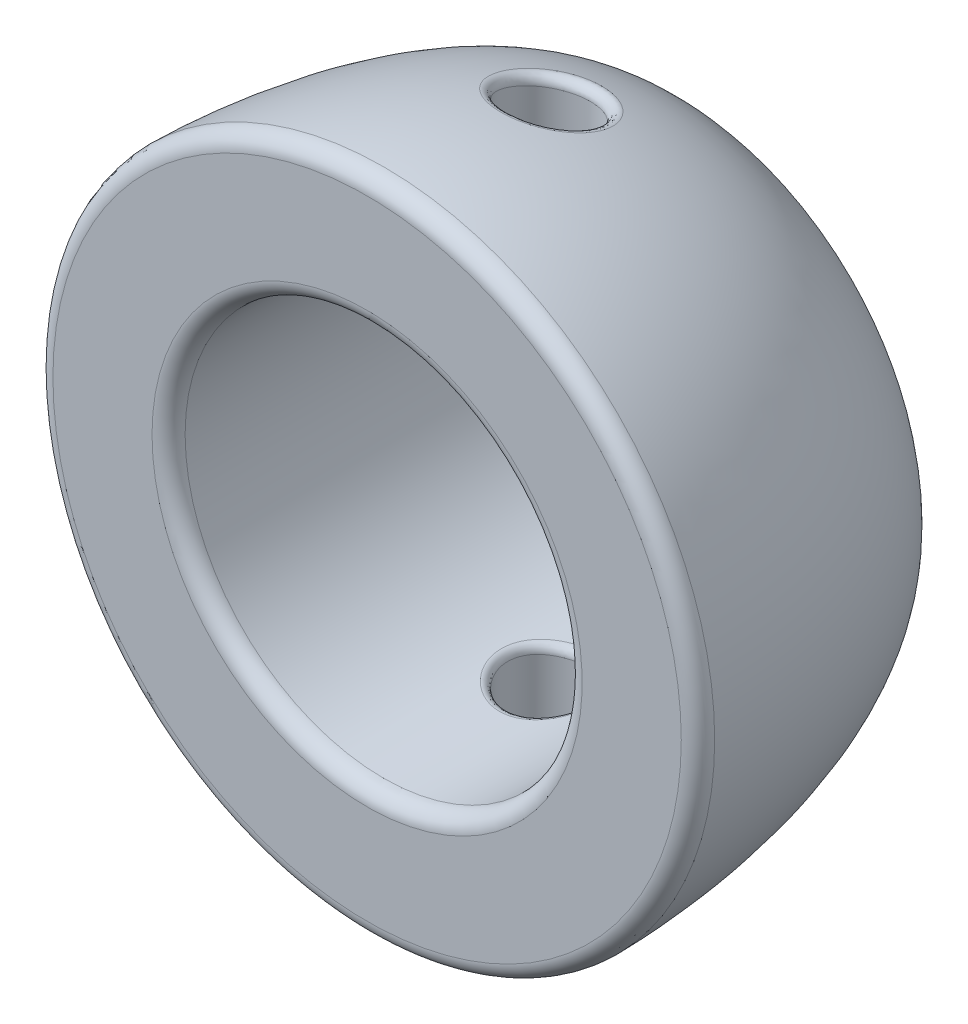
ISO-10303-21;
HEADER;
FILE_DESCRIPTION(('STEP AP214'),'2;1');
FILE_NAME('part.step','',(''),(''),'','','');
FILE_SCHEMA(('AUTOMOTIVE_DESIGN { 1 0 10303 214 1 1 1 1 }'));
ENDSEC;
DATA;
#1=APPLICATION_CONTEXT('core data for automotive mechanical design processes');
#2=APPLICATION_PROTOCOL_DEFINITION('international standard','automotive_design',2000,#1);
#3=PRODUCT_CONTEXT('',#1,'mechanical');
#4=PRODUCT('Part','Part','',(#3));
#5=PRODUCT_RELATED_PRODUCT_CATEGORY('part','',(#4));
#6=PRODUCT_DEFINITION_FORMATION('','',#4);
#7=PRODUCT_DEFINITION_CONTEXT('part definition',#1,'design');
#8=PRODUCT_DEFINITION('design','',#6,#7);
#9=PRODUCT_DEFINITION_SHAPE('','',#8);
#10=(LENGTH_UNIT() NAMED_UNIT(*) SI_UNIT(.MILLI.,.METRE.));
#11=(NAMED_UNIT(*) PLANE_ANGLE_UNIT() SI_UNIT($,.RADIAN.));
#12=(NAMED_UNIT(*) SI_UNIT($,.STERADIAN.) SOLID_ANGLE_UNIT());
#13=UNCERTAINTY_MEASURE_WITH_UNIT(LENGTH_MEASURE(1.E-05),#10,'distance_accuracy_value','');
#14=(GEOMETRIC_REPRESENTATION_CONTEXT(3) GLOBAL_UNCERTAINTY_ASSIGNED_CONTEXT((#13)) GLOBAL_UNIT_ASSIGNED_CONTEXT((#10,
#11,#12)) REPRESENTATION_CONTEXT('',''));
#15=CARTESIAN_POINT('',(0.,0.,0.));
#16=DIRECTION('',(0.,0.,1.));
#17=DIRECTION('',(1.,0.,0.));
#18=AXIS2_PLACEMENT_3D('',#15,#16,#17);
#19=CARTESIAN_POINT('',(0.,6.,5.));
#20=DIRECTION('',(0.,0.,-1.));
#21=DIRECTION('',(-1.,0.,0.));
#22=AXIS2_PLACEMENT_3D('',#19,#20,#21);
#23=PLANE('',#22);
#24=CARTESIAN_POINT('',(0.,0.,5.));
#25=DIRECTION('',(0.,0.,-1.));
#26=DIRECTION('',(-1.,0.,0.));
#27=AXIS2_PLACEMENT_3D('',#24,#25,#26);
#28=CIRCLE('',#27,6.5);
#29=CARTESIAN_POINT('',(-6.5,0.,5.));
#30=VERTEX_POINT('',#29);
#31=EDGE_CURVE('E121',#30,#30,#28,.T.);
#32=ORIENTED_EDGE('',*,*,#31,.T.);
#33=EDGE_LOOP('',(#32));
#34=FACE_BOUND('',#33,.T.);
#35=CARTESIAN_POINT('',(0.,0.,5.));
#36=DIRECTION('',(0.,0.,-1.));
#37=DIRECTION('',(-1.,0.,0.));
#38=AXIS2_PLACEMENT_3D('',#35,#36,#37);
#39=CIRCLE('',#38,9.49489457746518);
#40=CARTESIAN_POINT('',(-9.49489457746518,0.,5.));
#41=VERTEX_POINT('',#40);
#42=EDGE_CURVE('E118',#41,#41,#39,.F.);
#43=ORIENTED_EDGE('',*,*,#42,.T.);
#44=EDGE_LOOP('',(#43));
#45=FACE_BOUND('',#44,.T.);
#46=ADVANCED_FACE('F28',(#34,#45),#23,.F.);
#47=CARTESIAN_POINT('',(0.,0.,5.));
#48=DIRECTION('',(0.,0.,1.));
#49=DIRECTION('',(1.,0.,0.));
#50=AXIS2_PLACEMENT_3D('',#47,#48,#49);
#51=CYLINDRICAL_SURFACE('',#50,6.);
#52=CARTESIAN_POINT('',(0.335179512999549,-6.23704439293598,0.704223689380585));
#53=CARTESIAN_POINT('',(0.320500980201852,-5.99179470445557,0.708309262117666));
#54=CARTESIAN_POINT('',(0.38612679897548,-5.98756261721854,0.945068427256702));
#55=CARTESIAN_POINT('',(0.267742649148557,-6.24226277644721,0.72299372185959));
#56=CARTESIAN_POINT('',(0.255234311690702,-5.99514625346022,0.725588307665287));
#57=CARTESIAN_POINT('',(0.308439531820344,-5.99257226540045,0.967592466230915));
#58=CARTESIAN_POINT('',(0.198649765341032,-6.24601372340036,0.736104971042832));
#59=CARTESIAN_POINT('',(0.189240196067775,-5.99749717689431,0.73742523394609));
#60=CARTESIAN_POINT('',(0.228844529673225,-5.99617317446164,0.983325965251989));
#61=CARTESIAN_POINT('',(0.0591789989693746,-6.25015669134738,0.750564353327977));
#62=CARTESIAN_POINT('',(0.0561923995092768,-6.00010270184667,0.750528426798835));
#63=CARTESIAN_POINT('',(0.068174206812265,-6.00015042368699,1.00067722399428));
#64=CARTESIAN_POINT('',(-0.0111986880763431,-6.25054921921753,0.751914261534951));
#65=CARTESIAN_POINT('',(-0.0105670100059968,-6.00034602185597,0.751737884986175));
#66=CARTESIAN_POINT('',(-0.0129008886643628,-6.00052725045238,1.00229711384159));
#67=CARTESIAN_POINT('',(-0.149567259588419,-6.24796211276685,0.742911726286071));
#68=CARTESIAN_POINT('',(-0.142408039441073,-5.99872190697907,0.743589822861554));
#69=CARTESIAN_POINT('',(-0.172301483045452,-5.9980436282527,0.991494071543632));
#70=CARTESIAN_POINT('',(-0.217576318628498,-6.2450577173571,0.732820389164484));
#71=CARTESIAN_POINT('',(-0.207206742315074,-5.99690855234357,0.734503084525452));
#72=CARTESIAN_POINT('',(-0.250647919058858,-5.99525540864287,0.979384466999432));
#73=CARTESIAN_POINT('',(-0.350900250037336,-6.23631406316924,0.701688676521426));
#74=CARTESIAN_POINT('',(-0.335342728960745,-5.9913439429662,0.706055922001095));
#75=CARTESIAN_POINT('',(-0.404237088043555,-5.98686150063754,0.942026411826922));
#76=CARTESIAN_POINT('',(-0.416215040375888,-6.23047471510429,0.680647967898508));
#77=CARTESIAN_POINT('',(-0.398446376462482,-5.98761420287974,0.686807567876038));
#78=CARTESIAN_POINT('',(-0.47947972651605,-5.98125572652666,0.916777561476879));
#79=CARTESIAN_POINT('',(-0.54264305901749,-6.21645468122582,0.628159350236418));
#80=CARTESIAN_POINT('',(-0.521940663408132,-5.9784574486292,0.637965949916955));
#81=CARTESIAN_POINT('',(-0.625124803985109,-5.96779649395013,0.853791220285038));
#82=CARTESIAN_POINT('',(-0.603737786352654,-6.20826440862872,0.596668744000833));
#83=CARTESIAN_POINT('',(-0.582174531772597,-5.97305123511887,0.608489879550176));
#84=CARTESIAN_POINT('',(-0.695505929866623,-5.95993383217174,0.816002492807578));
#85=CARTESIAN_POINT('',(-0.719952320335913,-6.19040068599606,0.524143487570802));
#86=CARTESIAN_POINT('',(-0.69803216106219,-5.96099901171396,0.53944414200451));
#87=CARTESIAN_POINT('',(-0.829385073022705,-5.94278465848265,0.728972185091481));
#88=CARTESIAN_POINT('',(-0.775060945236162,-6.18072453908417,0.483091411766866));
#89=CARTESIAN_POINT('',(-0.753609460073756,-5.95437355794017,0.500019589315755));
#90=CARTESIAN_POINT('',(-0.8928702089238,-5.93349555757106,0.679709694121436));
#91=CARTESIAN_POINT('',(-0.879080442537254,-6.16066509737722,0.391426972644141));
#92=CARTESIAN_POINT('',(-0.859504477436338,-5.94038061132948,0.410678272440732));
#93=CARTESIAN_POINT('',(-1.01270066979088,-5.91423849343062,0.569712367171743));
#94=CARTESIAN_POINT('',(-0.927801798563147,-6.1502701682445,0.34060115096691));
#95=CARTESIAN_POINT('',(-0.909738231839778,-5.93300564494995,0.360639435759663));
#96=CARTESIAN_POINT('',(-1.06882767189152,-5.90425936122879,0.508721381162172));
#97=CARTESIAN_POINT('',(-1.01600099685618,-6.13016745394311,0.231540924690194));
#98=CARTESIAN_POINT('',(-1.00131569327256,-5.91853772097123,0.251967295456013));
#99=CARTESIAN_POINT('',(-1.17043314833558,-5.8849607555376,0.377849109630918));
#100=CARTESIAN_POINT('',(-1.05549445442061,-6.12045852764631,0.173319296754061));
#101=CARTESIAN_POINT('',(-1.04281988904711,-5.91143404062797,0.193393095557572));
#102=CARTESIAN_POINT('',(-1.21592961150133,-5.87564018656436,0.307983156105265));
#103=CARTESIAN_POINT('',(-1.12453611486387,-6.10273059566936,0.0503910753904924));
#104=CARTESIAN_POINT('',(-1.11565252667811,-5.89834868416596,0.0686982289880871));
#105=CARTESIAN_POINT('',(-1.29546560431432,-5.85862137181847,0.160469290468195));
#106=CARTESIAN_POINT('',(-1.15399373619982,-6.09472721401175,-0.0143680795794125));
#107=CARTESIAN_POINT('',(-1.1470732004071,-5.89235115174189,0.00244491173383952));
#108=CARTESIAN_POINT('',(-1.3294007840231,-5.85093812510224,0.0827583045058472));
#109=CARTESIAN_POINT('',(-1.2015457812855,-6.08148173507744,-0.148115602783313));
#110=CARTESIAN_POINT('',(-1.19782582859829,-5.88239082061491,-0.135020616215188));
#111=CARTESIAN_POINT('',(-1.3841807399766,-5.83822246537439,-0.0777387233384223));
#112=CARTESIAN_POINT('',(-1.21964226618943,-6.07623913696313,-0.217103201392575));
#113=CARTESIAN_POINT('',(-1.21732202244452,-5.87839822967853,-0.206405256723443));
#114=CARTESIAN_POINT('',(-1.40502789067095,-5.83318957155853,-0.160523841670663));
#115=CARTESIAN_POINT('',(-1.24358568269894,-6.06924609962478,-0.355684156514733));
#116=CARTESIAN_POINT('',(-1.24305846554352,-5.87307999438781,-0.34997277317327));
#117=CARTESIAN_POINT('',(-1.43261070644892,-5.82647625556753,-0.326820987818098));
#118=CARTESIAN_POINT('',(-1.24970009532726,-6.06741944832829,-0.425228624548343));
#119=CARTESIAN_POINT('',(-1.24967700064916,-5.87167804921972,-0.422333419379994));
#120=CARTESIAN_POINT('',(-1.43965450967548,-5.82472266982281,-0.41027434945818));
#121=CARTESIAN_POINT('',(-1.25027824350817,-6.06724807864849,-0.564364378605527));
#122=CARTESIAN_POINT('',(-1.25029963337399,-5.87154728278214,-0.56685027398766));
#123=CARTESIAN_POINT('',(-1.44032053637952,-5.82455815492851,-0.577237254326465));
#124=CARTESIAN_POINT('',(-1.24474325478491,-6.06890297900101,-0.633955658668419));
#125=CARTESIAN_POINT('',(-1.24430737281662,-5.87281769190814,-0.639268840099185));
#126=CARTESIAN_POINT('',(-1.4339442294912,-5.82614685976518,-0.660746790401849));
#127=CARTESIAN_POINT('',(-1.2224210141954,-6.07543170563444,-0.76990319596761));
#128=CARTESIAN_POINT('',(-1.22031083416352,-5.87778404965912,-0.780134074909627));
#129=CARTESIAN_POINT('',(-1.40822900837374,-5.83241443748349,-0.823883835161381));
#130=CARTESIAN_POINT('',(-1.20583779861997,-6.08024714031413,-0.836295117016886));
#131=CARTESIAN_POINT('',(-1.20244302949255,-5.8814526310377,-0.848860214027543));
#132=CARTESIAN_POINT('',(-1.38912514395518,-5.83703725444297,-0.903554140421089));
#133=CARTESIAN_POINT('',(-1.16215225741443,-6.09248374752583,-0.965342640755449));
#134=CARTESIAN_POINT('',(-1.15577825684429,-5.8906666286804,-0.981617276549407));
#135=CARTESIAN_POINT('',(-1.33879940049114,-5.84878439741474,-1.05841116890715));
#136=CARTESIAN_POINT('',(-1.13504909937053,-6.09990512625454,-1.0279979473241));
#137=CARTESIAN_POINT('',(-1.12684109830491,-5.89623785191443,-1.04580850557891));
#138=CARTESIAN_POINT('',(-1.30757656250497,-5.8559089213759,-1.13359753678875));
#139=CARTESIAN_POINT('',(-1.07063036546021,-6.11665611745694,-1.14885343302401));
#140=CARTESIAN_POINT('',(-1.05875731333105,-5.90863831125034,-1.16865740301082));
#141=CARTESIAN_POINT('',(-1.23336618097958,-5.87198987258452,-1.27862411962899));
#142=CARTESIAN_POINT('',(-1.03316647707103,-6.12601290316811,-1.20697186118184));
#143=CARTESIAN_POINT('',(-1.0192995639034,-5.91550928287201,-1.22728180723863));
#144=CARTESIAN_POINT('',(-1.19020778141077,-5.8809723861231,-1.34836623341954));
#145=CARTESIAN_POINT('',(-0.949240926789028,-6.14553499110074,-1.31620274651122));
#146=CARTESIAN_POINT('',(-0.931931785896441,-5.92961784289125,-1.33644310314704));
#147=CARTESIAN_POINT('',(-1.09352554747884,-5.89971359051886,-1.47944329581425));
#148=CARTESIAN_POINT('',(-0.902777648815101,-6.15570043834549,-1.36731394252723));
#149=CARTESIAN_POINT('',(-0.883874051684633,-5.93686788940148,-1.38695170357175));
#150=CARTESIAN_POINT('',(-1.03999985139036,-5.90947242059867,-1.54077673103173));
#151=CARTESIAN_POINT('',(-0.800801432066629,-6.17600100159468,-1.46239129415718));
#152=CARTESIAN_POINT('',(-0.779669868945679,-5.95111071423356,-1.48000520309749));
#153=CARTESIAN_POINT('',(-0.922523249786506,-5.9289609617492,-1.65486955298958));
#154=CARTESIAN_POINT('',(-0.745092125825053,-6.1861290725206,-1.50614808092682));
#155=CARTESIAN_POINT('',(-0.723283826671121,-5.95808451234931,-1.52218762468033));
#156=CARTESIAN_POINT('',(-0.858346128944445,-5.93868390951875,-1.70737769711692));
#157=CARTESIAN_POINT('',(-0.626992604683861,-6.20495773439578,-1.58368050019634));
#158=CARTESIAN_POINT('',(-0.605196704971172,-5.97084847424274,-1.59624932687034));
#159=CARTESIAN_POINT('',(-0.722295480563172,-5.95675942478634,-1.80041660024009));
#160=CARTESIAN_POINT('',(-0.564606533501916,-6.21365920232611,-1.61746227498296));
#161=CARTESIAN_POINT('',(-0.543524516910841,-5.9766159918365,-1.62795905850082));
#162=CARTESIAN_POINT('',(-0.65042672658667,-5.96511283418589,-1.84095472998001));
#163=CARTESIAN_POINT('',(-0.446290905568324,-6.22734678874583,-1.66907210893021));
#164=CARTESIAN_POINT('',(-0.427803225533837,-5.98557801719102,-1.67605395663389));
#165=CARTESIAN_POINT('',(-0.514127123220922,-5.97825291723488,-1.90288653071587));
#166=CARTESIAN_POINT('',(-0.391152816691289,-6.23271707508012,-1.68866037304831));
#167=CARTESIAN_POINT('',(-0.374330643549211,-5.98903359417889,-1.69407398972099));
#168=CARTESIAN_POINT('',(-0.450608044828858,-5.98340839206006,-1.92639244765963));
#169=CARTESIAN_POINT('',(-0.278580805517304,-6.24142008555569,-1.71996099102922));
#170=CARTESIAN_POINT('',(-0.265759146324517,-5.994602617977,-1.72278584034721));
#171=CARTESIAN_POINT('',(-0.320925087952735,-5.9917632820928,-1.96395318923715));
#172=CARTESIAN_POINT('',(-0.221147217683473,-6.2447531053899,-1.73167448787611));
#173=CARTESIAN_POINT('',(-0.210793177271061,-5.99670129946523,-1.73339925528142));
#174=CARTESIAN_POINT('',(-0.254761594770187,-5.99496298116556,-1.97800938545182));
#175=CARTESIAN_POINT('',(-0.0950342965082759,-6.24949291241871,-1.7482713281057));
#176=CARTESIAN_POINT('',(-0.0903196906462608,-5.99968912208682,-1.74846583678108));
#177=CARTESIAN_POINT('',(-0.109479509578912,-5.99951319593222,-1.99792559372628));
#178=CARTESIAN_POINT('',(-0.0261349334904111,-6.250464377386,-1.75161424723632));
#179=CARTESIAN_POINT('',(-0.024925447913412,-6.00029156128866,-1.75146150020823));
#180=CARTESIAN_POINT('',(-0.0301074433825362,-6.00044580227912,-2.00193709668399));
#181=CARTESIAN_POINT('',(0.111275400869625,-6.24911807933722,-1.74693555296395));
#182=CARTESIAN_POINT('',(0.105926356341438,-5.99944711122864,-1.74722925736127));
#183=CARTESIAN_POINT('',(0.12818926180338,-5.9991533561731,-1.99632266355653));
#184=CARTESIAN_POINT('',(0.179786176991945,-6.24679878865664,-1.7389086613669));
#185=CARTESIAN_POINT('',(0.171096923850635,-5.99800295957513,-1.7400150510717));
#186=CARTESIAN_POINT('',(0.207113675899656,-5.99692683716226,-1.98669039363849));
#187=CARTESIAN_POINT('',(0.314345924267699,-6.23912929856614,-1.71177154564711));
#188=CARTESIAN_POINT('',(0.300128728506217,-5.99313953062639,-1.71528055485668));
#189=CARTESIAN_POINT('',(0.362126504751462,-5.98956412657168,-1.95412585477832));
#190=CARTESIAN_POINT('',(0.380398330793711,-6.23378351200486,-1.69267745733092));
#191=CARTESIAN_POINT('',(0.363743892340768,-5.98974261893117,-1.69787569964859));
#192=CARTESIAN_POINT('',(0.438218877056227,-5.9844321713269,-1.93121294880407));
#193=CARTESIAN_POINT('',(0.508425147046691,-6.22062894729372,-1.64398529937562));
#194=CARTESIAN_POINT('',(0.488377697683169,-5.98119742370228,-1.65273814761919));
#195=CARTESIAN_POINT('',(0.585705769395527,-5.97180378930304,-1.87278235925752));
#196=CARTESIAN_POINT('',(0.570393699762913,-6.21281672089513,-1.61437251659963));
#197=CARTESIAN_POINT('',(0.549228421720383,-5.97607420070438,-1.62514538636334));
#198=CARTESIAN_POINT('',(0.657093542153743,-5.96430405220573,-1.83724701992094));
#199=CARTESIAN_POINT('',(0.689236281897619,-6.19545468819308,-1.5451026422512));
#200=CARTESIAN_POINT('',(0.667240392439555,-5.96443316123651,-1.55948858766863));
#201=CARTESIAN_POINT('',(0.794000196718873,-5.94763650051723,-1.75412317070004));
#202=CARTESIAN_POINT('',(0.746041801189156,-6.18588552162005,-1.50533148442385));
#203=CARTESIAN_POINT('',(0.724296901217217,-5.95792415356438,-1.52147197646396));
#204=CARTESIAN_POINT('',(0.859440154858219,-5.93845010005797,-1.70639778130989));
#205=CARTESIAN_POINT('',(0.852271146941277,-6.16609285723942,-1.41700972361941));
#206=CARTESIAN_POINT('',(0.832067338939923,-5.94419441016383,-1.43572420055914));
#207=CARTESIAN_POINT('',(0.981816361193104,-5.91944914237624,-1.60041166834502));
#208=CARTESIAN_POINT('',(0.90169412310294,-6.15586928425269,-1.36845811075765));
#209=CARTESIAN_POINT('',(0.882828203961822,-5.93698535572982,-1.38812722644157));
#210=CARTESIAN_POINT('',(1.03875162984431,-5.90963451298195,-1.54214973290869));
#211=CARTESIAN_POINT('',(0.992936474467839,-6.135629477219,-1.26260823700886));
#212=CARTESIAN_POINT('',(0.977230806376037,-5.92249911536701,-1.28307025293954));
#213=CARTESIAN_POINT('',(1.14386281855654,-5.89020429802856,-1.41512988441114));
#214=CARTESIAN_POINT('',(1.03455217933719,-6.12562360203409,-1.20513275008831));
#215=CARTESIAN_POINT('',(1.02082895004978,-5.9152153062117,-1.22545475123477));
#216=CARTESIAN_POINT('',(1.19180411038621,-5.88059865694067,-1.34615930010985));
#217=CARTESIAN_POINT('',(1.10748373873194,-6.10723470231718,-1.08392975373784));
#218=CARTESIAN_POINT('',(1.09757438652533,-5.90169604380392,-1.1028529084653));
#219=CARTESIAN_POINT('',(1.27582126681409,-5.86294531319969,-1.20071570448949));
#220=CARTESIAN_POINT('',(1.13881491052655,-6.09884927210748,-1.0202117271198));
#221=CARTESIAN_POINT('',(1.13091685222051,-5.89543537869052,-1.03783317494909));
#222=CARTESIAN_POINT('',(1.3119147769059,-5.8548953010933,-1.12425407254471));
#223=CARTESIAN_POINT('',(1.19016009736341,-6.08471591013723,-0.888565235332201));
#224=CARTESIAN_POINT('',(1.18562463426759,-5.88483639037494,-0.90278830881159));
#225=CARTESIAN_POINT('',(1.37106443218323,-5.84132727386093,-0.966278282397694));
#226=CARTESIAN_POINT('',(1.21023387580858,-6.07895408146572,-0.820661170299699));
#227=CARTESIAN_POINT('',(1.2072186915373,-5.88045885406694,-0.832641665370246));
#228=CARTESIAN_POINT('',(1.39418942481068,-5.83579591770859,-0.884793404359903));
#229=CARTESIAN_POINT('',(1.23864726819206,-6.07070817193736,-0.682311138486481));
#230=CARTESIAN_POINT('',(1.23772886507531,-5.87419772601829,-0.689470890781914));
#231=CARTESIAN_POINT('',(1.42692165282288,-5.8278798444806,-0.71877336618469));
#232=CARTESIAN_POINT('',(1.24698924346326,-6.06822343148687,-0.6118656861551));
#233=CARTESIAN_POINT('',(1.24675530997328,-5.87229198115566,-0.616211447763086));
#234=CARTESIAN_POINT('',(1.43653160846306,-5.82549449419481,-0.634238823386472));
#235=CARTESIAN_POINT('',(1.25159000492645,-6.06685904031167,-0.472426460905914));
#236=CARTESIAN_POINT('',(1.25171224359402,-5.87125047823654,-0.471392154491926));
#237=CARTESIAN_POINT('',(1.44183168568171,-5.82418467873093,-0.466911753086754));
#238=CARTESIAN_POINT('',(1.24816208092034,-6.06788591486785,-0.403443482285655));
#239=CARTESIAN_POINT('',(1.24800013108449,-5.87203913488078,-0.399583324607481));
#240=CARTESIAN_POINT('',(1.43788271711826,-5.82517047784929,-0.384132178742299));
#241=CARTESIAN_POINT('',(1.23003048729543,-6.07321488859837,-0.267069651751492));
#242=CARTESIAN_POINT('',(1.22849329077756,-5.87609779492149,-0.25815729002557));
#243=CARTESIAN_POINT('',(1.41699512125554,-5.83028629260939,-0.220483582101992));
#244=CARTESIAN_POINT('',(1.21532699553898,-6.07751693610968,-0.199678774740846));
#245=CARTESIAN_POINT('',(1.21263119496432,-5.8793817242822,-0.188301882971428));
#246=CARTESIAN_POINT('',(1.40005669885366,-5.83441625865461,-0.139614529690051));
#247=CARTESIAN_POINT('',(1.17524199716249,-6.08885718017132,-0.0687612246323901));
#248=CARTESIAN_POINT('',(1.16975093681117,-5.88794049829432,-0.0534011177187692));
#249=CARTESIAN_POINT('',(1.35387878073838,-5.84530289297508,0.0174865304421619));
#250=CARTESIAN_POINT('',(1.14992293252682,-6.09587935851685,-0.00521440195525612));
#251=CARTESIAN_POINT('',(1.14266520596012,-5.89322877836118,0.0118481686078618));
#252=CARTESIAN_POINT('',(1.32471121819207,-5.85204418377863,0.0937427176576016));
#253=CARTESIAN_POINT('',(1.08931725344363,-6.1118868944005,0.116881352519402));
#254=CARTESIAN_POINT('',(1.07847329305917,-5.9051201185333,0.136259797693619));
#255=CARTESIAN_POINT('',(1.25489347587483,-5.86741141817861,0.240257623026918));
#256=CARTESIAN_POINT('',(1.05401261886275,-6.12087579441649,0.175420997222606));
#257=CARTESIAN_POINT('',(1.04118719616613,-5.91175072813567,0.195498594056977));
#258=CARTESIAN_POINT('',(1.21422253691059,-5.8760407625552,0.310505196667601));
#259=CARTESIAN_POINT('',(0.973448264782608,-6.1400679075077,0.287249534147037));
#260=CARTESIAN_POINT('',(0.957046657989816,-5.92569116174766,0.30766046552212));
#261=CARTESIAN_POINT('',(1.12141240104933,-5.89446519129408,0.44469944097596));
#262=CARTESIAN_POINT('',(0.927967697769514,-6.15029530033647,0.340376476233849));
#263=CARTESIAN_POINT('',(0.909834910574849,-5.93302749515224,0.360371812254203));
#264=CARTESIAN_POINT('',(1.06901878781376,-5.90428348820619,0.508451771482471));
#265=CARTESIAN_POINT('',(0.828876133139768,-6.17063971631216,0.438246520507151));
#266=CARTESIAN_POINT('',(0.80824095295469,-5.94737828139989,0.456519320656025));
#267=CARTESIAN_POINT('',(0.954865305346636,-5.92381412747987,0.625895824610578));
#268=CARTESIAN_POINT('',(0.775278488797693,-6.18075689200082,0.483003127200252));
#269=CARTESIAN_POINT('',(0.753773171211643,-5.95439089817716,0.499868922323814));
#270=CARTESIAN_POINT('',(0.893120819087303,-5.93352661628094,0.679603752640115));
#271=CARTESIAN_POINT('',(0.660317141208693,-6.19996420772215,0.563717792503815));
#272=CARTESIAN_POINT('',(0.638345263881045,-5.96749651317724,0.577326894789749));
#273=CARTESIAN_POINT('',(0.760685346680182,-5.95196563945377,0.776461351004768));
#274=CARTESIAN_POINT('',(0.598837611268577,-6.20903412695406,0.599514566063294));
#275=CARTESIAN_POINT('',(0.577306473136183,-5.97354988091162,0.611089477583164));
#276=CARTESIAN_POINT('',(0.689860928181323,-5.9606727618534,0.819417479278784));
#277=CARTESIAN_POINT('',(0.470534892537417,-6.22492248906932,0.660229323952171));
#278=CARTESIAN_POINT('',(0.451255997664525,-5.98402289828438,0.667952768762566));
#279=CARTESIAN_POINT('',(0.54205619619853,-5.97592558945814,0.892275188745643));
#280=CARTESIAN_POINT('',(0.403712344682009,-6.23174120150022,0.685148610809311));
#281=CARTESIAN_POINT('',(0.386373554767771,-5.98841204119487,0.690869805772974));
#282=CARTESIAN_POINT('',(0.465076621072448,-5.9824715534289,0.922178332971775));
#283=CARTESIAN_POINT('',(0.335179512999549,-6.23704439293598,0.704223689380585));
#284=CARTESIAN_POINT('',(0.320500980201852,-5.99179470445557,0.708309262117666));
#285=CARTESIAN_POINT('',(0.38612679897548,-5.98756261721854,0.945068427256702));
#286=(BOUNDED_SURFACE() B_SPLINE_SURFACE(3,2,((#52,#53,#54),(#55,#56,#57),(#58,#59,#60),(#61,
#62,#63),(#64,#65,#66),(#67,#68,#69),(#70,#71,#72),(#73,#74,#75),(#76,#77,#78),(#79,#80,#81),
(#82,#83,#84),(#85,#86,#87),(#88,#89,#90),(#91,#92,#93),(#94,#95,#96),(#97,#98,#99),(#100,#101,
#102),(#103,#104,#105),(#106,#107,#108),(#109,#110,#111),(#112,#113,#114),(#115,#116,#117),
(#118,#119,#120),(#121,#122,#123),(#124,#125,#126),(#127,#128,#129),(#130,#131,#132),(#133,#134,
#135),(#136,#137,#138),(#139,#140,#141),(#142,#143,#144),(#145,#146,#147),(#148,#149,#150),
(#151,#152,#153),(#154,#155,#156),(#157,#158,#159),(#160,#161,#162),(#163,#164,#165),(#166,#167,
#168),(#169,#170,#171),(#172,#173,#174),(#175,#176,#177),(#178,#179,#180),(#181,#182,#183),
(#184,#185,#186),(#187,#188,#189),(#190,#191,#192),(#193,#194,#195),(#196,#197,#198),(#199,#200,
#201),(#202,#203,#204),(#205,#206,#207),(#208,#209,#210),(#211,#212,#213),(#214,#215,#216),
(#217,#218,#219),(#220,#221,#222),(#223,#224,#225),(#226,#227,#228),(#229,#230,#231),(#232,#233,
#234),(#235,#236,#237),(#238,#239,#240),(#241,#242,#243),(#244,#245,#246),(#247,#248,#249),
(#250,#251,#252),(#253,#254,#255),(#256,#257,#258),(#259,#260,#261),(#262,#263,#264),(#265,#266,
#267),(#268,#269,#270),(#271,#272,#273),(#274,#275,#276),(#277,#278,#279),(#280,#281,#282),
(#283,#284,#285)),.UNSPECIFIED.,.T.,.F.,.F.) B_SPLINE_SURFACE_WITH_KNOTS((4,2,2,2,2,2,2,2,2,2,2,
2,2,2,2,2,2,2,2,2,2,2,2,2,2,2,2,2,2,2,2,2,2,2,2,2,2,2,4),(3,3),(0.,0.252176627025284,
0.504315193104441,0.750813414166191,0.997319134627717,1.24484471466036,1.49282498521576,
1.74700835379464,2.00075843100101,2.25674162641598,2.51267836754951,2.7628335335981,
3.01296130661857,3.25859328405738,3.50424470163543,3.75361290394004,4.00302592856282,
4.25864336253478,4.51410306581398,4.72467868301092,4.93522372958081,5.18235224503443,
5.4295955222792,5.67647922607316,5.92370962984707,6.17384853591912,6.42401623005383,
6.68000462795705,6.93561002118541,7.18984528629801,7.44402937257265,7.69150064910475,
7.9389680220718,8.18499974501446,8.4314783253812,8.6839399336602,8.93599064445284,
9.19229628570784,9.44857122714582),(0.,1.),
.UNSPECIFIED.) GEOMETRIC_REPRESENTATION_ITEM() RATIONAL_B_SPLINE_SURFACE(((1.,0.713181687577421,
1.),(1.,0.710747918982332,1.),(1.,0.708983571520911,1.),(1.,0.707033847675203,1.),(1.,
0.706848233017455,1.),(1.,0.708066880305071,1.),(1.,0.709435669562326,1.),(1.,0.713525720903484,
1.),(1.,0.716247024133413,1.),(1.,0.722714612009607,1.),(1.,0.7264650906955,1.),(1.,
0.734550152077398,1.),(1.,0.738885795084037,1.),(1.,0.747767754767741,1.),(1.,0.752316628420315,
1.),(1.,0.761017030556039,1.),(1.,0.765169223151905,1.),(1.,0.772684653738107,1.),(1.,
0.77604062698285,1.),(1.,0.781563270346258,1.),(1.,0.783730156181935,1.),(1.,0.786614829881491,
1.),(1.,0.787364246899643,1.),(1.,0.787434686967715,1.),(1.,0.786755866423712,1.),(1.,
0.784063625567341,1.),(1.,0.782074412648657,1.),(1.,0.7769786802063,1.),(1.,0.773872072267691,
1.),(1.,0.766788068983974,1.),(1.,0.762798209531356,1.),(1.,0.754376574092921,1.),(1.,
0.749944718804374,1.),(1.,0.740990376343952,1.),(1.,0.736468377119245,1.),(1.,0.727971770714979,
1.),(1.,0.723996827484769,1.),(1.,0.717694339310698,1.),(1.,0.715200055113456,1.),(1.,
0.71114075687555,1.),(1.,0.709575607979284,1.),(1.,0.707347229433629,1.),(1.,0.706887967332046,
1.),(1.,0.707522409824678,1.),(1.,0.708616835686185,1.),(1.,0.712211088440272,1.),(1.,
0.714708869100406,1.),(1.,0.720795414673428,1.),(1.,0.724385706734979,1.),(1.,0.732273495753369,
1.),(1.,0.736578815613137,1.),(1.,0.745377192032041,1.),(1.,0.74987027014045,1.),(1.,
0.758666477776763,1.),(1.,0.762962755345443,1.),(1.,0.770785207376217,1.),(1.,0.774312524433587,
1.),(1.,0.780220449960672,1.),(1.,0.78260710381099,1.),(1.,0.786013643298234,1.),(1.,
0.787033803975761,1.),(1.,0.787594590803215,1.),(1.,0.787173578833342,1.),(1.,0.784978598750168,
1.),(1.,0.783204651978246,1.),(1.,0.778492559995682,1.),(1.,0.775561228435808,1.),(1.,
0.768812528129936,1.),(1.,0.764993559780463,1.),(1.,0.756746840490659,1.),(1.,0.752306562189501,
1.),(1.,0.743368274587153,1.),(1.,0.738870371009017,1.),(1.,0.730238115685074,1.),(1.,
0.726111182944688,1.),(1.,0.718819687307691,1.),(1.,0.715655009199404,1.),(1.,0.713181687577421,1.))) REPRESENTATION_ITEM('') SURFACE());
#287=CARTESIAN_POINT('',(0.38612679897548,-5.98756261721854,0.945068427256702));
#288=CARTESIAN_POINT('',(0.308439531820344,-5.99257226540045,0.967592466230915));
#289=CARTESIAN_POINT('',(0.228844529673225,-5.99617317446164,0.983325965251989));
#290=CARTESIAN_POINT('',(0.0681742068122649,-6.00015042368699,1.00067722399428));
#291=CARTESIAN_POINT('',(-0.0129008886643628,-6.00052725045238,1.00229711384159));
#292=CARTESIAN_POINT('',(-0.172301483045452,-5.9980436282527,0.991494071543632));
#293=CARTESIAN_POINT('',(-0.250647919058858,-5.99525540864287,0.979384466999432));
#294=CARTESIAN_POINT('',(-0.404237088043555,-5.98686150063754,0.942026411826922));
#295=CARTESIAN_POINT('',(-0.47947972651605,-5.98125572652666,0.916777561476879));
#296=CARTESIAN_POINT('',(-0.625124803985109,-5.96779649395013,0.853791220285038));
#297=CARTESIAN_POINT('',(-0.695505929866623,-5.95993383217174,0.816002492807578));
#298=CARTESIAN_POINT('',(-0.829385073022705,-5.94278465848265,0.728972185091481));
#299=CARTESIAN_POINT('',(-0.8928702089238,-5.93349555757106,0.679709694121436));
#300=CARTESIAN_POINT('',(-1.01270066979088,-5.91423849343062,0.569712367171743));
#301=CARTESIAN_POINT('',(-1.06882767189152,-5.90425936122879,0.508721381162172));
#302=CARTESIAN_POINT('',(-1.17043314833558,-5.8849607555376,0.377849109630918));
#303=CARTESIAN_POINT('',(-1.21592961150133,-5.87564018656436,0.307983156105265));
#304=CARTESIAN_POINT('',(-1.29546560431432,-5.85862137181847,0.160469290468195));
#305=CARTESIAN_POINT('',(-1.3294007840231,-5.85093812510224,0.0827583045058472));
#306=CARTESIAN_POINT('',(-1.3841807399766,-5.83822246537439,-0.0777387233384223));
#307=CARTESIAN_POINT('',(-1.40502789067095,-5.83318957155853,-0.160523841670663));
#308=CARTESIAN_POINT('',(-1.43261070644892,-5.82647625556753,-0.326820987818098));
#309=CARTESIAN_POINT('',(-1.43965450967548,-5.82472266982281,-0.41027434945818));
#310=CARTESIAN_POINT('',(-1.44032053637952,-5.82455815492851,-0.577237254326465));
#311=CARTESIAN_POINT('',(-1.4339442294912,-5.82614685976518,-0.660746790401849));
#312=CARTESIAN_POINT('',(-1.40822900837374,-5.83241443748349,-0.823883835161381));
#313=CARTESIAN_POINT('',(-1.38912514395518,-5.83703725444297,-0.903554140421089));
#314=CARTESIAN_POINT('',(-1.33879940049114,-5.84878439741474,-1.05841116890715));
#315=CARTESIAN_POINT('',(-1.30757656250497,-5.8559089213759,-1.13359753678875));
#316=CARTESIAN_POINT('',(-1.23336618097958,-5.87198987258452,-1.27862411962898));
#317=CARTESIAN_POINT('',(-1.19020778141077,-5.8809723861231,-1.34836623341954));
#318=CARTESIAN_POINT('',(-1.09352554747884,-5.89971359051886,-1.47944329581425));
#319=CARTESIAN_POINT('',(-1.03999985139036,-5.90947242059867,-1.54077673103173));
#320=CARTESIAN_POINT('',(-0.922523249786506,-5.9289609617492,-1.65486955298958));
#321=CARTESIAN_POINT('',(-0.858346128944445,-5.93868390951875,-1.70737769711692));
#322=CARTESIAN_POINT('',(-0.722295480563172,-5.95675942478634,-1.80041660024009));
#323=CARTESIAN_POINT('',(-0.65042672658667,-5.96511283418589,-1.84095472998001));
#324=CARTESIAN_POINT('',(-0.514127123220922,-5.97825291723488,-1.90288653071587));
#325=CARTESIAN_POINT('',(-0.450608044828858,-5.98340839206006,-1.92639244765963));
#326=CARTESIAN_POINT('',(-0.320925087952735,-5.9917632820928,-1.96395318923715));
#327=CARTESIAN_POINT('',(-0.254761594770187,-5.99496298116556,-1.97800938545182));
#328=CARTESIAN_POINT('',(-0.109479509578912,-5.99951319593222,-1.99792559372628));
#329=CARTESIAN_POINT('',(-0.030107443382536,-6.00044580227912,-2.00193709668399));
#330=CARTESIAN_POINT('',(0.128189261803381,-5.9991533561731,-1.99632266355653));
#331=CARTESIAN_POINT('',(0.207113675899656,-5.99692683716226,-1.98669039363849));
#332=CARTESIAN_POINT('',(0.362126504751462,-5.98956412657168,-1.95412585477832));
#333=CARTESIAN_POINT('',(0.438218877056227,-5.9844321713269,-1.93121294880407));
#334=CARTESIAN_POINT('',(0.585705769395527,-5.97180378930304,-1.87278235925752));
#335=CARTESIAN_POINT('',(0.657093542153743,-5.96430405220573,-1.83724701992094));
#336=CARTESIAN_POINT('',(0.794000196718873,-5.94763650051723,-1.75412317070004));
#337=CARTESIAN_POINT('',(0.859440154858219,-5.93845010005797,-1.70639778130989));
#338=CARTESIAN_POINT('',(0.981816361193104,-5.91944914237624,-1.60041166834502));
#339=CARTESIAN_POINT('',(1.03875162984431,-5.90963451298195,-1.54214973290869));
#340=CARTESIAN_POINT('',(1.14386281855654,-5.89020429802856,-1.41512988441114));
#341=CARTESIAN_POINT('',(1.19180411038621,-5.88059865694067,-1.34615930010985));
#342=CARTESIAN_POINT('',(1.27582126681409,-5.86294531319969,-1.20071570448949));
#343=CARTESIAN_POINT('',(1.3119147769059,-5.8548953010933,-1.12425407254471));
#344=CARTESIAN_POINT('',(1.37106443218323,-5.84132727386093,-0.966278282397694));
#345=CARTESIAN_POINT('',(1.39418942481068,-5.83579591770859,-0.884793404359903));
#346=CARTESIAN_POINT('',(1.42692165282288,-5.8278798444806,-0.718773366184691));
#347=CARTESIAN_POINT('',(1.43653160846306,-5.82549449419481,-0.634238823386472));
#348=CARTESIAN_POINT('',(1.44183168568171,-5.82418467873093,-0.466911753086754));
#349=CARTESIAN_POINT('',(1.43788271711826,-5.82517047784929,-0.384132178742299));
#350=CARTESIAN_POINT('',(1.41699512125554,-5.83028629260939,-0.220483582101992));
#351=CARTESIAN_POINT('',(1.40005669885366,-5.83441625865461,-0.139614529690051));
#352=CARTESIAN_POINT('',(1.35387878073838,-5.84530289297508,0.0174865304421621));
#353=CARTESIAN_POINT('',(1.32471121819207,-5.85204418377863,0.093742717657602));
#354=CARTESIAN_POINT('',(1.25489347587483,-5.86741141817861,0.240257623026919));
#355=CARTESIAN_POINT('',(1.21422253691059,-5.8760407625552,0.310505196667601));
#356=CARTESIAN_POINT('',(1.12141240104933,-5.89446519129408,0.44469944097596));
#357=CARTESIAN_POINT('',(1.06901878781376,-5.90428348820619,0.508451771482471));
#358=CARTESIAN_POINT('',(0.954865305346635,-5.92381412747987,0.625895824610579));
#359=CARTESIAN_POINT('',(0.893120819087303,-5.93352661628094,0.679603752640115));
#360=CARTESIAN_POINT('',(0.760685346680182,-5.95196563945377,0.776461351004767));
#361=CARTESIAN_POINT('',(0.689860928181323,-5.9606727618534,0.819417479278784));
#362=CARTESIAN_POINT('',(0.542056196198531,-5.97592558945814,0.892275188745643));
#363=CARTESIAN_POINT('',(0.465076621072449,-5.9824715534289,0.922178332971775));
#364=CARTESIAN_POINT('',(0.38612679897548,-5.98756261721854,0.945068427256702));
#365=B_SPLINE_CURVE_WITH_KNOTS('',3,(#287,#288,#289,#290,#291,#292,#293,#294,#295,#296,#297,
#298,#299,#300,#301,#302,#303,#304,#305,#306,#307,#308,#309,#310,#311,#312,#313,#314,#315,#316,
#317,#318,#319,#320,#321,#322,#323,#324,#325,#326,#327,#328,#329,#330,#331,#332,#333,#334,#335,
#336,#337,#338,#339,#340,#341,#342,#343,#344,#345,#346,#347,#348,#349,#350,#351,#352,#353,#354,
#355,#356,#357,#358,#359,#360,#361,#362,#363,#364),.UNSPECIFIED.,.T.,.F.,(4,2,2,2,2,2,2,2,2,2,2,
2,2,2,2,2,2,2,2,2,2,2,2,2,2,2,2,2,2,2,2,2,2,2,2,2,2,2,4),(0.,0.252176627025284,
0.504315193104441,0.750813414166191,0.997319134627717,1.24484471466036,1.49282498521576,
1.74700835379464,2.00075843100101,2.25674162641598,2.51267836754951,2.7628335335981,
3.01296130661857,3.25859328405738,3.50424470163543,3.75361290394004,4.00302592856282,
4.25864336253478,4.51410306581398,4.72467868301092,4.93522372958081,5.18235224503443,
5.4295955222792,5.67647922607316,5.92370962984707,6.17384853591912,6.42401623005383,
6.68000462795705,6.93561002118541,7.18984528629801,7.44402937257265,7.69150064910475,
7.9389680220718,8.18499974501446,8.4314783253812,8.6839399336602,8.93599064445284,
9.19229628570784,9.44857122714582),.UNSPECIFIED.);
#366=CARTESIAN_POINT('',(0.38612679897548,-5.98756261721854,0.945068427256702));
#367=VERTEX_POINT('',#366);
#368=EDGE_CURVE('E135',#367,#367,#365,.T.);
#369=ORIENTED_EDGE('',*,*,#368,.T.);
#370=EDGE_LOOP('',(#369));
#371=FACE_BOUND('',#370,.T.);
#372=CARTESIAN_POINT('',(-0.335179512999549,6.23704439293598,0.704223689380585));
#373=CARTESIAN_POINT('',(-0.320500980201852,5.99179470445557,0.708309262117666));
#374=CARTESIAN_POINT('',(-0.38612679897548,5.98756261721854,0.945068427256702));
#375=CARTESIAN_POINT('',(-0.267742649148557,6.24226277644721,0.72299372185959));
#376=CARTESIAN_POINT('',(-0.255234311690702,5.99514625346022,0.725588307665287));
#377=CARTESIAN_POINT('',(-0.308439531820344,5.99257226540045,0.967592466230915));
#378=CARTESIAN_POINT('',(-0.198649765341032,6.24601372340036,0.736104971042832));
#379=CARTESIAN_POINT('',(-0.189240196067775,5.99749717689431,0.73742523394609));
#380=CARTESIAN_POINT('',(-0.228844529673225,5.99617317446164,0.983325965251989));
#381=CARTESIAN_POINT('',(-0.0591789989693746,6.25015669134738,0.750564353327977));
#382=CARTESIAN_POINT('',(-0.0561923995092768,6.00010270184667,0.750528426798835));
#383=CARTESIAN_POINT('',(-0.068174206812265,6.00015042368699,1.00067722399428));
#384=CARTESIAN_POINT('',(0.0111986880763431,6.25054921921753,0.751914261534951));
#385=CARTESIAN_POINT('',(0.0105670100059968,6.00034602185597,0.751737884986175));
#386=CARTESIAN_POINT('',(0.0129008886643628,6.00052725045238,1.00229711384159));
#387=CARTESIAN_POINT('',(0.149567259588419,6.24796211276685,0.742911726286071));
#388=CARTESIAN_POINT('',(0.142408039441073,5.99872190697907,0.743589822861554));
#389=CARTESIAN_POINT('',(0.172301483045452,5.9980436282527,0.991494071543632));
#390=CARTESIAN_POINT('',(0.217576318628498,6.2450577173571,0.732820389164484));
#391=CARTESIAN_POINT('',(0.207206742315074,5.99690855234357,0.734503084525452));
#392=CARTESIAN_POINT('',(0.250647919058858,5.99525540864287,0.979384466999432));
#393=CARTESIAN_POINT('',(0.350900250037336,6.23631406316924,0.701688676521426));
#394=CARTESIAN_POINT('',(0.335342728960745,5.9913439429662,0.706055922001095));
#395=CARTESIAN_POINT('',(0.404237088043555,5.98686150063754,0.942026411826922));
#396=CARTESIAN_POINT('',(0.416215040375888,6.23047471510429,0.680647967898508));
#397=CARTESIAN_POINT('',(0.398446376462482,5.98761420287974,0.686807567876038));
#398=CARTESIAN_POINT('',(0.47947972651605,5.98125572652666,0.916777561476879));
#399=CARTESIAN_POINT('',(0.54264305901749,6.21645468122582,0.628159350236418));
#400=CARTESIAN_POINT('',(0.521940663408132,5.9784574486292,0.637965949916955));
#401=CARTESIAN_POINT('',(0.625124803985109,5.96779649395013,0.853791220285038));
#402=CARTESIAN_POINT('',(0.603737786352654,6.20826440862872,0.596668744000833));
#403=CARTESIAN_POINT('',(0.582174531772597,5.97305123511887,0.608489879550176));
#404=CARTESIAN_POINT('',(0.695505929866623,5.95993383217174,0.816002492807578));
#405=CARTESIAN_POINT('',(0.719952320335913,6.19040068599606,0.524143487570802));
#406=CARTESIAN_POINT('',(0.69803216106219,5.96099901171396,0.53944414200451));
#407=CARTESIAN_POINT('',(0.829385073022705,5.94278465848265,0.728972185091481));
#408=CARTESIAN_POINT('',(0.775060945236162,6.18072453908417,0.483091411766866));
#409=CARTESIAN_POINT('',(0.753609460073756,5.95437355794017,0.500019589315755));
#410=CARTESIAN_POINT('',(0.8928702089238,5.93349555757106,0.679709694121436));
#411=CARTESIAN_POINT('',(0.879080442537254,6.16066509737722,0.391426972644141));
#412=CARTESIAN_POINT('',(0.859504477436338,5.94038061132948,0.410678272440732));
#413=CARTESIAN_POINT('',(1.01270066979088,5.91423849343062,0.569712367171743));
#414=CARTESIAN_POINT('',(0.927801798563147,6.1502701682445,0.34060115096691));
#415=CARTESIAN_POINT('',(0.909738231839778,5.93300564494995,0.360639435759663));
#416=CARTESIAN_POINT('',(1.06882767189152,5.90425936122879,0.508721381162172));
#417=CARTESIAN_POINT('',(1.01600099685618,6.13016745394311,0.231540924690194));
#418=CARTESIAN_POINT('',(1.00131569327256,5.91853772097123,0.251967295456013));
#419=CARTESIAN_POINT('',(1.17043314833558,5.8849607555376,0.377849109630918));
#420=CARTESIAN_POINT('',(1.05549445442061,6.12045852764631,0.173319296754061));
#421=CARTESIAN_POINT('',(1.04281988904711,5.91143404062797,0.193393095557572));
#422=CARTESIAN_POINT('',(1.21592961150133,5.87564018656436,0.307983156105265));
#423=CARTESIAN_POINT('',(1.12453611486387,6.10273059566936,0.0503910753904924));
#424=CARTESIAN_POINT('',(1.11565252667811,5.89834868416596,0.0686982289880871));
#425=CARTESIAN_POINT('',(1.29546560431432,5.85862137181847,0.160469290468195));
#426=CARTESIAN_POINT('',(1.15399373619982,6.09472721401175,-0.0143680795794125));
#427=CARTESIAN_POINT('',(1.1470732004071,5.89235115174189,0.00244491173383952));
#428=CARTESIAN_POINT('',(1.3294007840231,5.85093812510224,0.0827583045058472));
#429=CARTESIAN_POINT('',(1.2015457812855,6.08148173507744,-0.148115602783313));
#430=CARTESIAN_POINT('',(1.19782582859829,5.88239082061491,-0.135020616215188));
#431=CARTESIAN_POINT('',(1.3841807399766,5.83822246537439,-0.0777387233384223));
#432=CARTESIAN_POINT('',(1.21964226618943,6.07623913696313,-0.217103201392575));
#433=CARTESIAN_POINT('',(1.21732202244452,5.87839822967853,-0.206405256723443));
#434=CARTESIAN_POINT('',(1.40502789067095,5.83318957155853,-0.160523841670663));
#435=CARTESIAN_POINT('',(1.24358568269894,6.06924609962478,-0.355684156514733));
#436=CARTESIAN_POINT('',(1.24305846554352,5.87307999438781,-0.34997277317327));
#437=CARTESIAN_POINT('',(1.43261070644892,5.82647625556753,-0.326820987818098));
#438=CARTESIAN_POINT('',(1.24970009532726,6.06741944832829,-0.425228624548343));
#439=CARTESIAN_POINT('',(1.24967700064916,5.87167804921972,-0.422333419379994));
#440=CARTESIAN_POINT('',(1.43965450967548,5.82472266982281,-0.41027434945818));
#441=CARTESIAN_POINT('',(1.25027824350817,6.06724807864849,-0.564364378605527));
#442=CARTESIAN_POINT('',(1.25029963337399,5.87154728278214,-0.56685027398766));
#443=CARTESIAN_POINT('',(1.44032053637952,5.82455815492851,-0.577237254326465));
#444=CARTESIAN_POINT('',(1.24474325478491,6.06890297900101,-0.633955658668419));
#445=CARTESIAN_POINT('',(1.24430737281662,5.87281769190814,-0.639268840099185));
#446=CARTESIAN_POINT('',(1.4339442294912,5.82614685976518,-0.660746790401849));
#447=CARTESIAN_POINT('',(1.2224210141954,6.07543170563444,-0.76990319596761));
#448=CARTESIAN_POINT('',(1.22031083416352,5.87778404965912,-0.780134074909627));
#449=CARTESIAN_POINT('',(1.40822900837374,5.83241443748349,-0.823883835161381));
#450=CARTESIAN_POINT('',(1.20583779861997,6.08024714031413,-0.836295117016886));
#451=CARTESIAN_POINT('',(1.20244302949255,5.8814526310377,-0.848860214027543));
#452=CARTESIAN_POINT('',(1.38912514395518,5.83703725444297,-0.903554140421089));
#453=CARTESIAN_POINT('',(1.16215225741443,6.09248374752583,-0.965342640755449));
#454=CARTESIAN_POINT('',(1.15577825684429,5.8906666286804,-0.981617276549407));
#455=CARTESIAN_POINT('',(1.33879940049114,5.84878439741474,-1.05841116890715));
#456=CARTESIAN_POINT('',(1.13504909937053,6.09990512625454,-1.0279979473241));
#457=CARTESIAN_POINT('',(1.12684109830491,5.89623785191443,-1.04580850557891));
#458=CARTESIAN_POINT('',(1.30757656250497,5.8559089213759,-1.13359753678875));
#459=CARTESIAN_POINT('',(1.07063036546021,6.11665611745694,-1.14885343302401));
#460=CARTESIAN_POINT('',(1.05875731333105,5.90863831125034,-1.16865740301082));
#461=CARTESIAN_POINT('',(1.23336618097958,5.87198987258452,-1.27862411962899));
#462=CARTESIAN_POINT('',(1.03316647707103,6.12601290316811,-1.20697186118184));
#463=CARTESIAN_POINT('',(1.0192995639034,5.91550928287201,-1.22728180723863));
#464=CARTESIAN_POINT('',(1.19020778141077,5.8809723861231,-1.34836623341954));
#465=CARTESIAN_POINT('',(0.949240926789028,6.14553499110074,-1.31620274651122));
#466=CARTESIAN_POINT('',(0.931931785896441,5.92961784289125,-1.33644310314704));
#467=CARTESIAN_POINT('',(1.09352554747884,5.89971359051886,-1.47944329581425));
#468=CARTESIAN_POINT('',(0.902777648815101,6.15570043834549,-1.36731394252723));
#469=CARTESIAN_POINT('',(0.883874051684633,5.93686788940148,-1.38695170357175));
#470=CARTESIAN_POINT('',(1.03999985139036,5.90947242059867,-1.54077673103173));
#471=CARTESIAN_POINT('',(0.800801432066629,6.17600100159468,-1.46239129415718));
#472=CARTESIAN_POINT('',(0.779669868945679,5.95111071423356,-1.48000520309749));
#473=CARTESIAN_POINT('',(0.922523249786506,5.9289609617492,-1.65486955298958));
#474=CARTESIAN_POINT('',(0.745092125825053,6.1861290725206,-1.50614808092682));
#475=CARTESIAN_POINT('',(0.723283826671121,5.95808451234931,-1.52218762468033));
#476=CARTESIAN_POINT('',(0.858346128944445,5.93868390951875,-1.70737769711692));
#477=CARTESIAN_POINT('',(0.626992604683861,6.20495773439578,-1.58368050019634));
#478=CARTESIAN_POINT('',(0.605196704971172,5.97084847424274,-1.59624932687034));
#479=CARTESIAN_POINT('',(0.722295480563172,5.95675942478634,-1.80041660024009));
#480=CARTESIAN_POINT('',(0.564606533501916,6.21365920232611,-1.61746227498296));
#481=CARTESIAN_POINT('',(0.543524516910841,5.9766159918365,-1.62795905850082));
#482=CARTESIAN_POINT('',(0.65042672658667,5.96511283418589,-1.84095472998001));
#483=CARTESIAN_POINT('',(0.446290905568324,6.22734678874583,-1.66907210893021));
#484=CARTESIAN_POINT('',(0.427803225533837,5.98557801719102,-1.67605395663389));
#485=CARTESIAN_POINT('',(0.514127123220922,5.97825291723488,-1.90288653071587));
#486=CARTESIAN_POINT('',(0.391152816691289,6.23271707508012,-1.68866037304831));
#487=CARTESIAN_POINT('',(0.374330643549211,5.98903359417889,-1.69407398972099));
#488=CARTESIAN_POINT('',(0.450608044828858,5.98340839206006,-1.92639244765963));
#489=CARTESIAN_POINT('',(0.278580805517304,6.24142008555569,-1.71996099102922));
#490=CARTESIAN_POINT('',(0.265759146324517,5.994602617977,-1.72278584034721));
#491=CARTESIAN_POINT('',(0.320925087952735,5.9917632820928,-1.96395318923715));
#492=CARTESIAN_POINT('',(0.221147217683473,6.2447531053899,-1.73167448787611));
#493=CARTESIAN_POINT('',(0.210793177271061,5.99670129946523,-1.73339925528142));
#494=CARTESIAN_POINT('',(0.254761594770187,5.99496298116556,-1.97800938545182));
#495=CARTESIAN_POINT('',(0.0950342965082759,6.24949291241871,-1.7482713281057));
#496=CARTESIAN_POINT('',(0.0903196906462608,5.99968912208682,-1.74846583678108));
#497=CARTESIAN_POINT('',(0.109479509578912,5.99951319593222,-1.99792559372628));
#498=CARTESIAN_POINT('',(0.0261349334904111,6.250464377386,-1.75161424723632));
#499=CARTESIAN_POINT('',(0.024925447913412,6.00029156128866,-1.75146150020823));
#500=CARTESIAN_POINT('',(0.0301074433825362,6.00044580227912,-2.00193709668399));
#501=CARTESIAN_POINT('',(-0.111275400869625,6.24911807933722,-1.74693555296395));
#502=CARTESIAN_POINT('',(-0.105926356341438,5.99944711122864,-1.74722925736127));
#503=CARTESIAN_POINT('',(-0.12818926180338,5.9991533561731,-1.99632266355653));
#504=CARTESIAN_POINT('',(-0.179786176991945,6.24679878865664,-1.7389086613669));
#505=CARTESIAN_POINT('',(-0.171096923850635,5.99800295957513,-1.7400150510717));
#506=CARTESIAN_POINT('',(-0.207113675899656,5.99692683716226,-1.98669039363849));
#507=CARTESIAN_POINT('',(-0.314345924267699,6.23912929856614,-1.71177154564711));
#508=CARTESIAN_POINT('',(-0.300128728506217,5.99313953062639,-1.71528055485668));
#509=CARTESIAN_POINT('',(-0.362126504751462,5.98956412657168,-1.95412585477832));
#510=CARTESIAN_POINT('',(-0.380398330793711,6.23378351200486,-1.69267745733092));
#511=CARTESIAN_POINT('',(-0.363743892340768,5.98974261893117,-1.69787569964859));
#512=CARTESIAN_POINT('',(-0.438218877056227,5.9844321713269,-1.93121294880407));
#513=CARTESIAN_POINT('',(-0.508425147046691,6.22062894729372,-1.64398529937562));
#514=CARTESIAN_POINT('',(-0.488377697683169,5.98119742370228,-1.65273814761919));
#515=CARTESIAN_POINT('',(-0.585705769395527,5.97180378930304,-1.87278235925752));
#516=CARTESIAN_POINT('',(-0.570393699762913,6.21281672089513,-1.61437251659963));
#517=CARTESIAN_POINT('',(-0.549228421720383,5.97607420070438,-1.62514538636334));
#518=CARTESIAN_POINT('',(-0.657093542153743,5.96430405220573,-1.83724701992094));
#519=CARTESIAN_POINT('',(-0.689236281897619,6.19545468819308,-1.5451026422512));
#520=CARTESIAN_POINT('',(-0.667240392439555,5.96443316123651,-1.55948858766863));
#521=CARTESIAN_POINT('',(-0.794000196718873,5.94763650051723,-1.75412317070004));
#522=CARTESIAN_POINT('',(-0.746041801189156,6.18588552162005,-1.50533148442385));
#523=CARTESIAN_POINT('',(-0.724296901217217,5.95792415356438,-1.52147197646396));
#524=CARTESIAN_POINT('',(-0.859440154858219,5.93845010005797,-1.70639778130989));
#525=CARTESIAN_POINT('',(-0.852271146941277,6.16609285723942,-1.41700972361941));
#526=CARTESIAN_POINT('',(-0.832067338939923,5.94419441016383,-1.43572420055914));
#527=CARTESIAN_POINT('',(-0.981816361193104,5.91944914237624,-1.60041166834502));
#528=CARTESIAN_POINT('',(-0.90169412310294,6.15586928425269,-1.36845811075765));
#529=CARTESIAN_POINT('',(-0.882828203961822,5.93698535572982,-1.38812722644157));
#530=CARTESIAN_POINT('',(-1.03875162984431,5.90963451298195,-1.54214973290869));
#531=CARTESIAN_POINT('',(-0.992936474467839,6.135629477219,-1.26260823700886));
#532=CARTESIAN_POINT('',(-0.977230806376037,5.92249911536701,-1.28307025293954));
#533=CARTESIAN_POINT('',(-1.14386281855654,5.89020429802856,-1.41512988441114));
#534=CARTESIAN_POINT('',(-1.03455217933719,6.12562360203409,-1.20513275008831));
#535=CARTESIAN_POINT('',(-1.02082895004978,5.9152153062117,-1.22545475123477));
#536=CARTESIAN_POINT('',(-1.19180411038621,5.88059865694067,-1.34615930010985));
#537=CARTESIAN_POINT('',(-1.10748373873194,6.10723470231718,-1.08392975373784));
#538=CARTESIAN_POINT('',(-1.09757438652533,5.90169604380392,-1.1028529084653));
#539=CARTESIAN_POINT('',(-1.27582126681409,5.86294531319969,-1.20071570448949));
#540=CARTESIAN_POINT('',(-1.13881491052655,6.09884927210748,-1.0202117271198));
#541=CARTESIAN_POINT('',(-1.13091685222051,5.89543537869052,-1.03783317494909));
#542=CARTESIAN_POINT('',(-1.3119147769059,5.8548953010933,-1.12425407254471));
#543=CARTESIAN_POINT('',(-1.19016009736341,6.08471591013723,-0.888565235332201));
#544=CARTESIAN_POINT('',(-1.18562463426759,5.88483639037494,-0.90278830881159));
#545=CARTESIAN_POINT('',(-1.37106443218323,5.84132727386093,-0.966278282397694));
#546=CARTESIAN_POINT('',(-1.21023387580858,6.07895408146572,-0.820661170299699));
#547=CARTESIAN_POINT('',(-1.2072186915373,5.88045885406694,-0.832641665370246));
#548=CARTESIAN_POINT('',(-1.39418942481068,5.83579591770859,-0.884793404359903));
#549=CARTESIAN_POINT('',(-1.23864726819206,6.07070817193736,-0.682311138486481));
#550=CARTESIAN_POINT('',(-1.23772886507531,5.87419772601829,-0.689470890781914));
#551=CARTESIAN_POINT('',(-1.42692165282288,5.8278798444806,-0.71877336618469));
#552=CARTESIAN_POINT('',(-1.24698924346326,6.06822343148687,-0.6118656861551));
#553=CARTESIAN_POINT('',(-1.24675530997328,5.87229198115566,-0.616211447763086));
#554=CARTESIAN_POINT('',(-1.43653160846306,5.82549449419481,-0.634238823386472));
#555=CARTESIAN_POINT('',(-1.25159000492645,6.06685904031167,-0.472426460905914));
#556=CARTESIAN_POINT('',(-1.25171224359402,5.87125047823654,-0.471392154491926));
#557=CARTESIAN_POINT('',(-1.44183168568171,5.82418467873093,-0.466911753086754));
#558=CARTESIAN_POINT('',(-1.24816208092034,6.06788591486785,-0.403443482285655));
#559=CARTESIAN_POINT('',(-1.24800013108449,5.87203913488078,-0.399583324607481));
#560=CARTESIAN_POINT('',(-1.43788271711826,5.82517047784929,-0.384132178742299));
#561=CARTESIAN_POINT('',(-1.23003048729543,6.07321488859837,-0.267069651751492));
#562=CARTESIAN_POINT('',(-1.22849329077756,5.87609779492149,-0.25815729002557));
#563=CARTESIAN_POINT('',(-1.41699512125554,5.83028629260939,-0.220483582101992));
#564=CARTESIAN_POINT('',(-1.21532699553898,6.07751693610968,-0.199678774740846));
#565=CARTESIAN_POINT('',(-1.21263119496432,5.8793817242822,-0.188301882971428));
#566=CARTESIAN_POINT('',(-1.40005669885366,5.83441625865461,-0.139614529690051));
#567=CARTESIAN_POINT('',(-1.17524199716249,6.08885718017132,-0.0687612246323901));
#568=CARTESIAN_POINT('',(-1.16975093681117,5.88794049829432,-0.0534011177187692));
#569=CARTESIAN_POINT('',(-1.35387878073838,5.84530289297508,0.0174865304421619));
#570=CARTESIAN_POINT('',(-1.14992293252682,6.09587935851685,-0.00521440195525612));
#571=CARTESIAN_POINT('',(-1.14266520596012,5.89322877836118,0.0118481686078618));
#572=CARTESIAN_POINT('',(-1.32471121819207,5.85204418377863,0.0937427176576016));
#573=CARTESIAN_POINT('',(-1.08931725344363,6.1118868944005,0.116881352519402));
#574=CARTESIAN_POINT('',(-1.07847329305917,5.9051201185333,0.136259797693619));
#575=CARTESIAN_POINT('',(-1.25489347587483,5.86741141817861,0.240257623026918));
#576=CARTESIAN_POINT('',(-1.05401261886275,6.12087579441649,0.175420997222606));
#577=CARTESIAN_POINT('',(-1.04118719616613,5.91175072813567,0.195498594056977));
#578=CARTESIAN_POINT('',(-1.21422253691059,5.8760407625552,0.310505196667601));
#579=CARTESIAN_POINT('',(-0.973448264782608,6.1400679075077,0.287249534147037));
#580=CARTESIAN_POINT('',(-0.957046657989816,5.92569116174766,0.30766046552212));
#581=CARTESIAN_POINT('',(-1.12141240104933,5.89446519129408,0.44469944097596));
#582=CARTESIAN_POINT('',(-0.927967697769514,6.15029530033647,0.340376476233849));
#583=CARTESIAN_POINT('',(-0.909834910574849,5.93302749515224,0.360371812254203));
#584=CARTESIAN_POINT('',(-1.06901878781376,5.90428348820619,0.508451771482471));
#585=CARTESIAN_POINT('',(-0.828876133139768,6.17063971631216,0.438246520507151));
#586=CARTESIAN_POINT('',(-0.80824095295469,5.94737828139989,0.456519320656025));
#587=CARTESIAN_POINT('',(-0.954865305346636,5.92381412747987,0.625895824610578));
#588=CARTESIAN_POINT('',(-0.775278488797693,6.18075689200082,0.483003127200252));
#589=CARTESIAN_POINT('',(-0.753773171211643,5.95439089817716,0.499868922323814));
#590=CARTESIAN_POINT('',(-0.893120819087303,5.93352661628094,0.679603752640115));
#591=CARTESIAN_POINT('',(-0.660317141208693,6.19996420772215,0.563717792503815));
#592=CARTESIAN_POINT('',(-0.638345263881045,5.96749651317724,0.577326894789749));
#593=CARTESIAN_POINT('',(-0.760685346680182,5.95196563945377,0.776461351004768));
#594=CARTESIAN_POINT('',(-0.598837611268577,6.20903412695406,0.599514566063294));
#595=CARTESIAN_POINT('',(-0.577306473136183,5.97354988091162,0.611089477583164));
#596=CARTESIAN_POINT('',(-0.689860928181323,5.9606727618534,0.819417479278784));
#597=CARTESIAN_POINT('',(-0.470534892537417,6.22492248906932,0.660229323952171));
#598=CARTESIAN_POINT('',(-0.451255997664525,5.98402289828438,0.667952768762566));
#599=CARTESIAN_POINT('',(-0.54205619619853,5.97592558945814,0.892275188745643));
#600=CARTESIAN_POINT('',(-0.403712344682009,6.23174120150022,0.685148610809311));
#601=CARTESIAN_POINT('',(-0.386373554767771,5.98841204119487,0.690869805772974));
#602=CARTESIAN_POINT('',(-0.465076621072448,5.9824715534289,0.922178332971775));
#603=CARTESIAN_POINT('',(-0.335179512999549,6.23704439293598,0.704223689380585));
#604=CARTESIAN_POINT('',(-0.320500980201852,5.99179470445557,0.708309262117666));
#605=CARTESIAN_POINT('',(-0.38612679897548,5.98756261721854,0.945068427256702));
#606=(BOUNDED_SURFACE() B_SPLINE_SURFACE(3,2,((#372,#373,#374),(#375,#376,#377),(#378,#379,
#380),(#381,#382,#383),(#384,#385,#386),(#387,#388,#389),(#390,#391,#392),(#393,#394,#395),
(#396,#397,#398),(#399,#400,#401),(#402,#403,#404),(#405,#406,#407),(#408,#409,#410),(#411,#412,
#413),(#414,#415,#416),(#417,#418,#419),(#420,#421,#422),(#423,#424,#425),(#426,#427,#428),
(#429,#430,#431),(#432,#433,#434),(#435,#436,#437),(#438,#439,#440),(#441,#442,#443),(#444,#445,
#446),(#447,#448,#449),(#450,#451,#452),(#453,#454,#455),(#456,#457,#458),(#459,#460,#461),
(#462,#463,#464),(#465,#466,#467),(#468,#469,#470),(#471,#472,#473),(#474,#475,#476),(#477,#478,
#479),(#480,#481,#482),(#483,#484,#485),(#486,#487,#488),(#489,#490,#491),(#492,#493,#494),
(#495,#496,#497),(#498,#499,#500),(#501,#502,#503),(#504,#505,#506),(#507,#508,#509),(#510,#511,
#512),(#513,#514,#515),(#516,#517,#518),(#519,#520,#521),(#522,#523,#524),(#525,#526,#527),
(#528,#529,#530),(#531,#532,#533),(#534,#535,#536),(#537,#538,#539),(#540,#541,#542),(#543,#544,
#545),(#546,#547,#548),(#549,#550,#551),(#552,#553,#554),(#555,#556,#557),(#558,#559,#560),
(#561,#562,#563),(#564,#565,#566),(#567,#568,#569),(#570,#571,#572),(#573,#574,#575),(#576,#577,
#578),(#579,#580,#581),(#582,#583,#584),(#585,#586,#587),(#588,#589,#590),(#591,#592,#593),
(#594,#595,#596),(#597,#598,#599),(#600,#601,#602),(#603,#604,#605)),.UNSPECIFIED.,.T.,.F.,
.F.) B_SPLINE_SURFACE_WITH_KNOTS((4,2,2,2,2,2,2,2,2,2,2,2,2,2,2,2,2,2,2,2,2,2,2,2,2,2,2,2,2,2,2,
2,2,2,2,2,2,2,4),(3,3),(0.,0.252176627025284,0.504315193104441,0.750813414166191,
0.997319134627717,1.24484471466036,1.49282498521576,1.74700835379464,2.00075843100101,
2.25674162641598,2.51267836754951,2.7628335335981,3.01296130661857,3.25859328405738,
3.50424470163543,3.75361290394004,4.00302592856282,4.25864336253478,4.51410306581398,
4.72467868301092,4.93522372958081,5.18235224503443,5.4295955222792,5.67647922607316,
5.92370962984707,6.17384853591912,6.42401623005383,6.68000462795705,6.93561002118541,
7.18984528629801,7.44402937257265,7.69150064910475,7.9389680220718,8.18499974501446,
8.4314783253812,8.6839399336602,8.93599064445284,9.19229628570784,9.44857122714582),(0.,1.),
.UNSPECIFIED.) GEOMETRIC_REPRESENTATION_ITEM() RATIONAL_B_SPLINE_SURFACE(((1.,0.713181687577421,
1.),(1.,0.710747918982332,1.),(1.,0.708983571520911,1.),(1.,0.707033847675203,1.),(1.,
0.706848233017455,1.),(1.,0.708066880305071,1.),(1.,0.709435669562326,1.),(1.,0.713525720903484,
1.),(1.,0.716247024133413,1.),(1.,0.722714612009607,1.),(1.,0.7264650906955,1.),(1.,
0.734550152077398,1.),(1.,0.738885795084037,1.),(1.,0.747767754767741,1.),(1.,0.752316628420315,
1.),(1.,0.761017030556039,1.),(1.,0.765169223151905,1.),(1.,0.772684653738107,1.),(1.,
0.77604062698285,1.),(1.,0.781563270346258,1.),(1.,0.783730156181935,1.),(1.,0.786614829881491,
1.),(1.,0.787364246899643,1.),(1.,0.787434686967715,1.),(1.,0.786755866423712,1.),(1.,
0.784063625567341,1.),(1.,0.782074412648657,1.),(1.,0.7769786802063,1.),(1.,0.773872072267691,
1.),(1.,0.766788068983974,1.),(1.,0.762798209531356,1.),(1.,0.754376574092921,1.),(1.,
0.749944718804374,1.),(1.,0.740990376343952,1.),(1.,0.736468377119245,1.),(1.,0.727971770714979,
1.),(1.,0.723996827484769,1.),(1.,0.717694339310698,1.),(1.,0.715200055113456,1.),(1.,
0.71114075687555,1.),(1.,0.709575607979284,1.),(1.,0.707347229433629,1.),(1.,0.706887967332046,
1.),(1.,0.707522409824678,1.),(1.,0.708616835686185,1.),(1.,0.712211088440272,1.),(1.,
0.714708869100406,1.),(1.,0.720795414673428,1.),(1.,0.724385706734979,1.),(1.,0.732273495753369,
1.),(1.,0.736578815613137,1.),(1.,0.745377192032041,1.),(1.,0.74987027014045,1.),(1.,
0.758666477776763,1.),(1.,0.762962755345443,1.),(1.,0.770785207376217,1.),(1.,0.774312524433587,
1.),(1.,0.780220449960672,1.),(1.,0.78260710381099,1.),(1.,0.786013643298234,1.),(1.,
0.787033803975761,1.),(1.,0.787594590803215,1.),(1.,0.787173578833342,1.),(1.,0.784978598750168,
1.),(1.,0.783204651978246,1.),(1.,0.778492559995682,1.),(1.,0.775561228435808,1.),(1.,
0.768812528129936,1.),(1.,0.764993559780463,1.),(1.,0.756746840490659,1.),(1.,0.752306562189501,
1.),(1.,0.743368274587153,1.),(1.,0.738870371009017,1.),(1.,0.730238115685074,1.),(1.,
0.726111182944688,1.),(1.,0.718819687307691,1.),(1.,0.715655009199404,1.),(1.,0.713181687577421,1.))) REPRESENTATION_ITEM('') SURFACE());
#607=CARTESIAN_POINT('',(-0.38612679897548,5.98756261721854,0.945068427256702));
#608=CARTESIAN_POINT('',(-0.308439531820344,5.99257226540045,0.967592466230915));
#609=CARTESIAN_POINT('',(-0.228844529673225,5.99617317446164,0.983325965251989));
#610=CARTESIAN_POINT('',(-0.0681742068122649,6.00015042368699,1.00067722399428));
#611=CARTESIAN_POINT('',(0.0129008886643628,6.00052725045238,1.00229711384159));
#612=CARTESIAN_POINT('',(0.172301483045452,5.9980436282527,0.991494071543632));
#613=CARTESIAN_POINT('',(0.250647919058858,5.99525540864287,0.979384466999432));
#614=CARTESIAN_POINT('',(0.404237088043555,5.98686150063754,0.942026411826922));
#615=CARTESIAN_POINT('',(0.47947972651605,5.98125572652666,0.916777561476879));
#616=CARTESIAN_POINT('',(0.625124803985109,5.96779649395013,0.853791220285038));
#617=CARTESIAN_POINT('',(0.695505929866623,5.95993383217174,0.816002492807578));
#618=CARTESIAN_POINT('',(0.829385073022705,5.94278465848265,0.728972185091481));
#619=CARTESIAN_POINT('',(0.8928702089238,5.93349555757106,0.679709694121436));
#620=CARTESIAN_POINT('',(1.01270066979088,5.91423849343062,0.569712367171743));
#621=CARTESIAN_POINT('',(1.06882767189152,5.90425936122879,0.508721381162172));
#622=CARTESIAN_POINT('',(1.17043314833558,5.8849607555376,0.377849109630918));
#623=CARTESIAN_POINT('',(1.21592961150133,5.87564018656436,0.307983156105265));
#624=CARTESIAN_POINT('',(1.29546560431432,5.85862137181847,0.160469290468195));
#625=CARTESIAN_POINT('',(1.3294007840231,5.85093812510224,0.0827583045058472));
#626=CARTESIAN_POINT('',(1.3841807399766,5.83822246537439,-0.0777387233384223));
#627=CARTESIAN_POINT('',(1.40502789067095,5.83318957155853,-0.160523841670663));
#628=CARTESIAN_POINT('',(1.43261070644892,5.82647625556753,-0.326820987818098));
#629=CARTESIAN_POINT('',(1.43965450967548,5.82472266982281,-0.41027434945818));
#630=CARTESIAN_POINT('',(1.44032053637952,5.82455815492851,-0.577237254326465));
#631=CARTESIAN_POINT('',(1.4339442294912,5.82614685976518,-0.660746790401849));
#632=CARTESIAN_POINT('',(1.40822900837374,5.83241443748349,-0.823883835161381));
#633=CARTESIAN_POINT('',(1.38912514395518,5.83703725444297,-0.903554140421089));
#634=CARTESIAN_POINT('',(1.33879940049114,5.84878439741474,-1.05841116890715));
#635=CARTESIAN_POINT('',(1.30757656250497,5.8559089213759,-1.13359753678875));
#636=CARTESIAN_POINT('',(1.23336618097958,5.87198987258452,-1.27862411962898));
#637=CARTESIAN_POINT('',(1.19020778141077,5.8809723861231,-1.34836623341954));
#638=CARTESIAN_POINT('',(1.09352554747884,5.89971359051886,-1.47944329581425));
#639=CARTESIAN_POINT('',(1.03999985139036,5.90947242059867,-1.54077673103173));
#640=CARTESIAN_POINT('',(0.922523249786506,5.9289609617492,-1.65486955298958));
#641=CARTESIAN_POINT('',(0.858346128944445,5.93868390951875,-1.70737769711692));
#642=CARTESIAN_POINT('',(0.722295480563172,5.95675942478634,-1.80041660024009));
#643=CARTESIAN_POINT('',(0.65042672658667,5.96511283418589,-1.84095472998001));
#644=CARTESIAN_POINT('',(0.514127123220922,5.97825291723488,-1.90288653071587));
#645=CARTESIAN_POINT('',(0.450608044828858,5.98340839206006,-1.92639244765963));
#646=CARTESIAN_POINT('',(0.320925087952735,5.9917632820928,-1.96395318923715));
#647=CARTESIAN_POINT('',(0.254761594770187,5.99496298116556,-1.97800938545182));
#648=CARTESIAN_POINT('',(0.109479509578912,5.99951319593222,-1.99792559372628));
#649=CARTESIAN_POINT('',(0.030107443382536,6.00044580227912,-2.00193709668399));
#650=CARTESIAN_POINT('',(-0.128189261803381,5.9991533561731,-1.99632266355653));
#651=CARTESIAN_POINT('',(-0.207113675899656,5.99692683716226,-1.98669039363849));
#652=CARTESIAN_POINT('',(-0.362126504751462,5.98956412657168,-1.95412585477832));
#653=CARTESIAN_POINT('',(-0.438218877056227,5.9844321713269,-1.93121294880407));
#654=CARTESIAN_POINT('',(-0.585705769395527,5.97180378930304,-1.87278235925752));
#655=CARTESIAN_POINT('',(-0.657093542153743,5.96430405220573,-1.83724701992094));
#656=CARTESIAN_POINT('',(-0.794000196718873,5.94763650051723,-1.75412317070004));
#657=CARTESIAN_POINT('',(-0.859440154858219,5.93845010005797,-1.70639778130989));
#658=CARTESIAN_POINT('',(-0.981816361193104,5.91944914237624,-1.60041166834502));
#659=CARTESIAN_POINT('',(-1.03875162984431,5.90963451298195,-1.54214973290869));
#660=CARTESIAN_POINT('',(-1.14386281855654,5.89020429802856,-1.41512988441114));
#661=CARTESIAN_POINT('',(-1.19180411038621,5.88059865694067,-1.34615930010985));
#662=CARTESIAN_POINT('',(-1.27582126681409,5.86294531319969,-1.20071570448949));
#663=CARTESIAN_POINT('',(-1.3119147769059,5.8548953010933,-1.12425407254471));
#664=CARTESIAN_POINT('',(-1.37106443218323,5.84132727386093,-0.966278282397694));
#665=CARTESIAN_POINT('',(-1.39418942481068,5.83579591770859,-0.884793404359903));
#666=CARTESIAN_POINT('',(-1.42692165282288,5.8278798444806,-0.718773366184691));
#667=CARTESIAN_POINT('',(-1.43653160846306,5.82549449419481,-0.634238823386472));
#668=CARTESIAN_POINT('',(-1.44183168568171,5.82418467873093,-0.466911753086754));
#669=CARTESIAN_POINT('',(-1.43788271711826,5.82517047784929,-0.384132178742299));
#670=CARTESIAN_POINT('',(-1.41699512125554,5.83028629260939,-0.220483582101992));
#671=CARTESIAN_POINT('',(-1.40005669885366,5.83441625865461,-0.139614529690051));
#672=CARTESIAN_POINT('',(-1.35387878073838,5.84530289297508,0.0174865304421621));
#673=CARTESIAN_POINT('',(-1.32471121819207,5.85204418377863,0.093742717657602));
#674=CARTESIAN_POINT('',(-1.25489347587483,5.86741141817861,0.240257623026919));
#675=CARTESIAN_POINT('',(-1.21422253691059,5.8760407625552,0.310505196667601));
#676=CARTESIAN_POINT('',(-1.12141240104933,5.89446519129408,0.44469944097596));
#677=CARTESIAN_POINT('',(-1.06901878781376,5.90428348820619,0.508451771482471));
#678=CARTESIAN_POINT('',(-0.954865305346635,5.92381412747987,0.625895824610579));
#679=CARTESIAN_POINT('',(-0.893120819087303,5.93352661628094,0.679603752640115));
#680=CARTESIAN_POINT('',(-0.760685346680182,5.95196563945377,0.776461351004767));
#681=CARTESIAN_POINT('',(-0.689860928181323,5.9606727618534,0.819417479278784));
#682=CARTESIAN_POINT('',(-0.542056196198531,5.97592558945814,0.892275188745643));
#683=CARTESIAN_POINT('',(-0.465076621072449,5.9824715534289,0.922178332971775));
#684=CARTESIAN_POINT('',(-0.38612679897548,5.98756261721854,0.945068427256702));
#685=B_SPLINE_CURVE_WITH_KNOTS('',3,(#607,#608,#609,#610,#611,#612,#613,#614,#615,#616,#617,
#618,#619,#620,#621,#622,#623,#624,#625,#626,#627,#628,#629,#630,#631,#632,#633,#634,#635,#636,
#637,#638,#639,#640,#641,#642,#643,#644,#645,#646,#647,#648,#649,#650,#651,#652,#653,#654,#655,
#656,#657,#658,#659,#660,#661,#662,#663,#664,#665,#666,#667,#668,#669,#670,#671,#672,#673,#674,
#675,#676,#677,#678,#679,#680,#681,#682,#683,#684),.UNSPECIFIED.,.T.,.F.,(4,2,2,2,2,2,2,2,2,2,2,
2,2,2,2,2,2,2,2,2,2,2,2,2,2,2,2,2,2,2,2,2,2,2,2,2,2,2,4),(0.,0.252176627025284,
0.504315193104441,0.750813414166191,0.997319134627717,1.24484471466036,1.49282498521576,
1.74700835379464,2.00075843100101,2.25674162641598,2.51267836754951,2.7628335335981,
3.01296130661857,3.25859328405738,3.50424470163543,3.75361290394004,4.00302592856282,
4.25864336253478,4.51410306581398,4.72467868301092,4.93522372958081,5.18235224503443,
5.4295955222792,5.67647922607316,5.92370962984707,6.17384853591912,6.42401623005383,
6.68000462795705,6.93561002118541,7.18984528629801,7.44402937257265,7.69150064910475,
7.9389680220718,8.18499974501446,8.4314783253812,8.6839399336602,8.93599064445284,
9.19229628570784,9.44857122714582),.UNSPECIFIED.);
#686=CARTESIAN_POINT('',(-0.38612679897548,5.98756261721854,0.945068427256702));
#687=VERTEX_POINT('',#686);
#688=EDGE_CURVE('E130',#687,#687,#685,.T.);
#689=ORIENTED_EDGE('',*,*,#688,.T.);
#690=EDGE_LOOP('',(#689));
#691=FACE_BOUND('',#690,.T.);
#692=CARTESIAN_POINT('',(0.,0.,4.5));
#693=DIRECTION('',(0.,0.,-1.));
#694=DIRECTION('',(-1.,0.,0.));
#695=AXIS2_PLACEMENT_3D('',#692,#693,#694);
#696=CIRCLE('',#695,6.);
#697=CARTESIAN_POINT('',(-6.,0.,4.5));
#698=VERTEX_POINT('',#697);
#699=EDGE_CURVE('E115',#698,#698,#696,.F.);
#700=ORIENTED_EDGE('',*,*,#699,.T.);
#701=EDGE_LOOP('',(#700));
#702=FACE_BOUND('',#701,.T.);
#703=CARTESIAN_POINT('',(0.,0.,-4.38741069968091));
#704=DIRECTION('',(0.,0.,-1.));
#705=DIRECTION('',(-1.,0.,0.));
#706=AXIS2_PLACEMENT_3D('',#703,#704,#705);
#707=CIRCLE('',#706,6.);
#708=CARTESIAN_POINT('',(-6.,0.,-4.38741069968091));
#709=VERTEX_POINT('',#708);
#710=EDGE_CURVE('E112',#709,#709,#707,.T.);
#711=ORIENTED_EDGE('',*,*,#710,.T.);
#712=EDGE_LOOP('',(#711));
#713=FACE_BOUND('',#712,.T.);
#714=ADVANCED_FACE('F86',(#371,#691,#702,#713),#51,.F.);
#715=CARTESIAN_POINT('',(0.,6.,5.));
#716=DIRECTION('',(1.,0.,0.));
#717=DIRECTION('',(0.,0.,1.));
#718=AXIS2_PLACEMENT_3D('',#715,#716,#717);
#719=ELLIPSE('',#718,10.,4.);
#720=CARTESIAN_POINT('',(0.,0.,5.));
#721=DIRECTION('',(0.,0.,1.));
#722=AXIS1_PLACEMENT('',#720,#721);
#723=SURFACE_OF_REVOLUTION('',#719,#722);
#724=CARTESIAN_POINT('',(-0.256412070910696,-9.40152922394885,0.723418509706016));
#725=CARTESIAN_POINT('',(-0.270598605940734,-9.61259301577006,0.720445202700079));
#726=CARTESIAN_POINT('',(-0.315744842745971,-9.64750591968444,0.924162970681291));
#727=CARTESIAN_POINT('',(-0.189472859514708,-9.40716583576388,0.737448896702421));
#728=CARTESIAN_POINT('',(-0.200240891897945,-9.61748100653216,0.736000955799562));
#729=CARTESIAN_POINT('',(-0.233314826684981,-9.65324951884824,0.941213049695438));
#730=CARTESIAN_POINT('',(-0.121258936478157,-9.41061422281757,0.74599216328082));
#731=CARTESIAN_POINT('',(-0.128113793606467,-9.62049197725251,0.745539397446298));
#732=CARTESIAN_POINT('',(-0.14931671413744,-9.65676360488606,0.951594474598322));
#733=CARTESIAN_POINT('',(0.0156951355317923,-9.41294805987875,0.751778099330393));
#734=CARTESIAN_POINT('',(0.0165427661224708,-9.62252271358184,0.751976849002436));
#735=CARTESIAN_POINT('',(0.0193268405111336,-9.65914188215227,0.958625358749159));
#736=CARTESIAN_POINT('',(0.0844351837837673,-9.41183436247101,0.749022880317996));
#737=CARTESIAN_POINT('',(0.0893014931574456,-9.62154969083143,0.748898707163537));
#738=CARTESIAN_POINT('',(0.103972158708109,-9.6580069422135,0.955277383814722));
#739=CARTESIAN_POINT('',(0.218590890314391,-9.40519633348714,0.732544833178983));
#740=CARTESIAN_POINT('',(0.230865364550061,-9.61577658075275,0.730574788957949));
#741=CARTESIAN_POINT('',(0.269171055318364,-9.65124264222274,0.935253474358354));
#742=CARTESIAN_POINT('',(0.28404645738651,-9.39978839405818,0.719111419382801));
#743=CARTESIAN_POINT('',(0.299934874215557,-9.61106020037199,0.715595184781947));
#744=CARTESIAN_POINT('',(0.349773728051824,-9.64573188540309,0.918929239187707));
#745=CARTESIAN_POINT('',(0.411697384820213,-9.38498398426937,0.682125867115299));
#746=CARTESIAN_POINT('',(0.434009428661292,-9.59821410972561,0.674568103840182));
#747=CARTESIAN_POINT('',(0.506968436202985,-9.63064730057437,0.873981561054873));
#748=CARTESIAN_POINT('',(0.47389263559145,-9.37558737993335,0.658573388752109));
#749=CARTESIAN_POINT('',(0.49918093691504,-9.59004849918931,0.648405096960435));
#750=CARTESIAN_POINT('',(0.583560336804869,-9.6210733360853,0.84535770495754));
#751=CARTESIAN_POINT('',(0.594152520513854,-9.35311781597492,0.601798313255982));
#752=CARTESIAN_POINT('',(0.624399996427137,-9.57063179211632,0.585711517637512));
#753=CARTESIAN_POINT('',(0.731663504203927,-9.59818239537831,0.776351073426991));
#754=CARTESIAN_POINT('',(0.652156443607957,-9.34000075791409,0.568459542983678));
#755=CARTESIAN_POINT('',(0.684479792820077,-9.5592955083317,0.548897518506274));
#756=CARTESIAN_POINT('',(0.803100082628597,-9.58482052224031,0.735827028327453));
#757=CARTESIAN_POINT('',(0.761846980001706,-9.31071020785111,0.493237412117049));
#758=CARTESIAN_POINT('',(0.79714015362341,-9.53413816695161,0.466397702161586));
#759=CARTESIAN_POINT('',(0.938201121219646,-9.55498783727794,0.644381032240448));
#760=CARTESIAN_POINT('',(0.813523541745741,-9.29453195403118,0.45134073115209));
#761=CARTESIAN_POINT('',(0.84974871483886,-9.52026027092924,0.420516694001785));
#762=CARTESIAN_POINT('',(1.00185321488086,-9.53851218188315,0.593442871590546));
#763=CARTESIAN_POINT('',(0.911267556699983,-9.25907902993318,0.358383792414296));
#764=CARTESIAN_POINT('',(0.94818284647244,-9.4900394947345,0.319453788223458));
#765=CARTESIAN_POINT('',(1.12225858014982,-9.50241398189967,0.480407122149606));
#766=CARTESIAN_POINT('',(0.957021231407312,-9.23970515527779,0.30702004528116));
#767=CARTESIAN_POINT('',(0.993585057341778,-9.4735738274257,0.263802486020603));
#768=CARTESIAN_POINT('',(1.17862577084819,-9.48269067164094,0.417939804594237));
#769=CARTESIAN_POINT('',(1.03939838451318,-9.19909207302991,0.197741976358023));
#770=CARTESIAN_POINT('',(1.07404317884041,-9.43929979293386,0.146405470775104));
#771=CARTESIAN_POINT('',(1.28012462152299,-9.44135363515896,0.28501097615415));
#772=CARTESIAN_POINT('',(1.07600447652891,-9.17784941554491,0.139815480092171));
#773=CARTESIAN_POINT('',(1.10897001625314,-9.42144845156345,0.0844870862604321));
#774=CARTESIAN_POINT('',(1.32523488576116,-9.41973641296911,0.21453460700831));
#775=CARTESIAN_POINT('',(1.14064369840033,-9.13326982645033,0.0162469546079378));
#776=CARTESIAN_POINT('',(1.16916368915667,-9.38423689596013,-0.0464457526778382));
#777=CARTESIAN_POINT('',(1.40490594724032,-9.37438065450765,0.0641573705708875));
#778=CARTESIAN_POINT('',(1.16821098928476,-9.10988158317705,-0.0496262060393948));
#779=CARTESIAN_POINT('',(1.19371403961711,-9.36483391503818,-0.115726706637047));
#780=CARTESIAN_POINT('',(1.43889337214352,-9.35059035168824,-0.0160264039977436));
#781=CARTESIAN_POINT('',(1.21171222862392,-9.06272646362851,-0.184889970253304));
#782=CARTESIAN_POINT('',(1.23044739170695,-9.32599558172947,-0.25656384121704));
#783=CARTESIAN_POINT('',(1.4925457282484,-9.30263530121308,-0.18072621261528));
#784=CARTESIAN_POINT('',(1.22766384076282,-9.03896021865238,-0.254275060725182));
#785=CARTESIAN_POINT('',(1.24242868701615,-9.3065578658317,-0.328164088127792));
#786=CARTESIAN_POINT('',(1.51223240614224,-9.2784711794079,-0.26523545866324));
#787=CARTESIAN_POINT('',(1.24784807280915,-8.99109688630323,-0.396663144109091));
#788=CARTESIAN_POINT('',(1.25427627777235,-9.26766662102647,-0.473630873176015));
#789=CARTESIAN_POINT('',(1.53717460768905,-9.22981603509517,-0.43872226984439));
#790=CARTESIAN_POINT('',(1.25176268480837,-8.96700744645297,-0.469713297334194));
#791=CARTESIAN_POINT('',(1.25357163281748,-9.24825638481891,-0.547437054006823));
#792=CARTESIAN_POINT('',(1.54203849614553,-9.20533303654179,-0.527758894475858));
#793=CARTESIAN_POINT('',(1.24678475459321,-8.91984128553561,-0.615496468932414));
#794=CARTESIAN_POINT('',(1.23959414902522,-9.21049224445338,-0.693193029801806));
#795=CARTESIAN_POINT('',(1.53598834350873,-9.1574029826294,-0.705519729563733));
#796=CARTESIAN_POINT('',(1.23791045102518,-8.8967631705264,-0.688229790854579));
#797=CARTESIAN_POINT('',(1.22611656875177,-9.19217659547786,-0.765032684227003));
#798=CARTESIAN_POINT('',(1.52509677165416,-9.13395450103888,-0.794244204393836));
#799=CARTESIAN_POINT('',(1.20755004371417,-8.85222967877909,-0.831118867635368));
#800=CARTESIAN_POINT('',(1.18731691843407,-9.1570369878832,-0.904753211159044));
#801=CARTESIAN_POINT('',(1.48777064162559,-9.08870822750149,-0.968629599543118));
#802=CARTESIAN_POINT('',(1.186104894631,-8.83076928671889,-0.901282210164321));
#803=CARTESIAN_POINT('',(1.16185578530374,-9.1402593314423,-0.972477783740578));
#804=CARTESIAN_POINT('',(1.46138655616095,-9.06690533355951,-1.05429951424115));
#805=CARTESIAN_POINT('',(1.13109020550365,-8.78987309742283,-1.03712434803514));
#806=CARTESIAN_POINT('',(1.1000049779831,-9.10846083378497,-1.10238399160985));
#807=CARTESIAN_POINT('',(1.39367111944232,-9.02535280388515,-1.22024614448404));
#808=CARTESIAN_POINT('',(1.09752243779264,-8.77043700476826,-1.1028037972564));
#809=CARTESIAN_POINT('',(1.06349716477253,-9.0934970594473,-1.16435859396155));
#810=CARTESIAN_POINT('',(1.35234195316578,-9.00560286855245,-1.30052364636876));
#811=CARTESIAN_POINT('',(1.01999944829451,-8.73441123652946,-1.22614460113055));
#812=CARTESIAN_POINT('',(0.981682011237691,-9.06591920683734,-1.27975334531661));
#813=CARTESIAN_POINT('',(1.25687257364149,-8.968986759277,-1.45135574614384));
#814=CARTESIAN_POINT('',(0.976298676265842,-8.71776673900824,-1.28395469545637));
#815=CARTESIAN_POINT('',(0.936526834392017,-9.05330941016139,-1.33314428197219));
#816=CARTESIAN_POINT('',(1.20304614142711,-8.95206507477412,-1.52209037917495));
#817=CARTESIAN_POINT('',(0.87927904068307,-8.68712884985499,-1.39140536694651));
#818=CARTESIAN_POINT('',(0.838224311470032,-9.03023329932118,-1.43167341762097));
#819=CARTESIAN_POINT('',(1.0835302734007,-8.92090578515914,-1.65362795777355));
#820=CARTESIAN_POINT('',(0.825963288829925,-8.67313460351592,-1.44104857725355));
#821=CARTESIAN_POINT('',(0.785083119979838,-9.01981694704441,-1.4766091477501));
#822=CARTESIAN_POINT('',(1.01784467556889,-8.90666731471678,-1.71443410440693));
#823=CARTESIAN_POINT('',(0.712797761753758,-8.64842518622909,-1.52928595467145));
#824=CARTESIAN_POINT('',(0.673880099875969,-9.00153621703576,-1.55600682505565));
#825=CARTESIAN_POINT('',(0.878411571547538,-8.88151577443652,-1.822560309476));
#826=CARTESIAN_POINT('',(0.653165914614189,-8.63763097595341,-1.56814459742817));
#827=CARTESIAN_POINT('',(0.616035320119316,-8.99364965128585,-1.59055463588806));
#828=CARTESIAN_POINT('',(0.804932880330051,-8.87052258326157,-1.870203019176));
#829=CARTESIAN_POINT('',(0.527968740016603,-8.61906448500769,-1.63524391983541));
#830=CARTESIAN_POINT('',(0.495770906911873,-8.98015184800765,-1.6499779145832));
#831=CARTESIAN_POINT('',(0.650656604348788,-8.85160613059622,-1.95249834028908));
#832=CARTESIAN_POINT('',(0.462411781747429,-8.61128802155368,-1.66349929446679));
#833=CARTESIAN_POINT('',(0.433465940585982,-8.97457151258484,-1.67471956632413));
#834=CARTESIAN_POINT('',(0.56986934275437,-8.84367861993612,-1.98716892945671));
#835=CARTESIAN_POINT('',(0.353347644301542,-8.60131117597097,-1.69982018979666));
#836=CARTESIAN_POINT('',(0.330529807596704,-8.96743973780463,-1.70643996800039));
#837=CARTESIAN_POINT('',(0.435463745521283,-8.8335049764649,-2.03174607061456));
#838=CARTESIAN_POINT('',(0.311061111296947,-8.59811656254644,-1.71147105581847));
#839=CARTESIAN_POINT('',(0.29076498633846,-8.96516736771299,-1.71657683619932));
#840=CARTESIAN_POINT('',(0.38335098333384,-8.83024645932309,-2.0460482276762));
#841=CARTESIAN_POINT('',(0.225448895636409,-8.5929627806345,-1.73028180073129));
#842=CARTESIAN_POINT('',(0.210451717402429,-8.96150678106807,-1.73292932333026));
#843=CARTESIAN_POINT('',(0.277843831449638,-8.82498888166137,-2.06914179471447));
#844=CARTESIAN_POINT('',(0.182123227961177,-8.59100359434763,-1.73744174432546));
#845=CARTESIAN_POINT('',(0.169944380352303,-8.96012250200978,-1.73912741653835));
#846=CARTESIAN_POINT('',(0.22444946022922,-8.82298980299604,-2.07793328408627));
#847=CARTESIAN_POINT('',(0.0702770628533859,-8.58759338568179,-1.74990661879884));
#848=CARTESIAN_POINT('',(0.0654442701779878,-8.9577102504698,-1.74993183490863));
#849=CARTESIAN_POINT('',(0.08661009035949,-8.81951004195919,-2.09323889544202));
#850=CARTESIAN_POINT('',(0.00133746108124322,-8.58705321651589,-1.75188397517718));
#851=CARTESIAN_POINT('',(0.00129368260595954,-8.95733165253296,-1.75163262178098));
#852=CARTESIAN_POINT('',(0.00164823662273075,-8.81895869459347,-2.0956673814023));
#853=CARTESIAN_POINT('',(-0.135951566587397,-8.58907547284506,-1.74448920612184));
#854=CARTESIAN_POINT('',(-0.126783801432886,-8.95875946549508,-1.74523233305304));
#855=CARTESIAN_POINT('',(-0.167547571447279,-8.82102235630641,-2.08658685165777));
#856=CARTESIAN_POINT('',(-0.204300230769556,-8.59164143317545,-1.73510415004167));
#857=CARTESIAN_POINT('',(-0.190534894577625,-8.96056445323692,-1.7371376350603));
#858=CARTESIAN_POINT('',(-0.251780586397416,-8.8236409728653,-2.07506195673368));
#859=CARTESIAN_POINT('',(-0.338349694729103,-8.5998097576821,-1.70529152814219));
#860=CARTESIAN_POINT('',(-0.316308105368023,-8.9663675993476,-1.71121647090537));
#861=CARTESIAN_POINT('',(-0.416980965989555,-8.83197370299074,-2.03846189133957));
#862=CARTESIAN_POINT('',(-0.404052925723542,-8.60540926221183,-1.68487436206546));
#863=CARTESIAN_POINT('',(-0.37817357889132,-8.97034832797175,-1.6934675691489));
#864=CARTESIAN_POINT('',(-0.497951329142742,-8.83768490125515,-2.01339948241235));
#865=CARTESIAN_POINT('',(-0.531051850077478,-8.61950938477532,-1.63365514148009));
#866=CARTESIAN_POINT('',(-0.49879565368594,-8.98049253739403,-1.64849793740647));
#867=CARTESIAN_POINT('',(-0.654455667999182,-8.85205897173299,-1.95055150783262));
#868=CARTESIAN_POINT('',(-0.592346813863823,-8.62801048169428,-1.60285137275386));
#869=CARTESIAN_POINT('',(-0.557427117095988,-8.98663122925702,-1.62138590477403));
#870=CARTESIAN_POINT('',(-0.729988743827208,-8.86072233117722,-1.91276384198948));
#871=CARTESIAN_POINT('',(-0.709265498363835,-8.64779649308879,-1.53158194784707));
#872=CARTESIAN_POINT('',(-0.670498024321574,-9.00109667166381,-1.55796022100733));
#873=CARTESIAN_POINT('',(-0.874058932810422,-8.88087513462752,-1.82537730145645));
#874=CARTESIAN_POINT('',(-0.764847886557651,-8.65909991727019,-1.49105210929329));
#875=CARTESIAN_POINT('',(-0.724825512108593,-9.00940503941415,-1.52172658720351));
#876=CARTESIAN_POINT('',(-0.942545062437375,-8.89238336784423,-1.77569997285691));
#877=CARTESIAN_POINT('',(-0.868414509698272,-8.68423923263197,-1.40168504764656));
#878=CARTESIAN_POINT('',(-0.827414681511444,-9.0281027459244,-1.44088616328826));
#879=CARTESIAN_POINT('',(-1.07014510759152,-8.91796577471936,-1.66622000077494));
#880=CARTESIAN_POINT('',(-0.916397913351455,-8.69807540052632,-1.35284691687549));
#881=CARTESIAN_POINT('',(-0.875637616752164,-9.03845311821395,-1.3964415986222));
#882=CARTESIAN_POINT('',(-1.12925799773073,-8.93204022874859,-1.60641625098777));
#883=CARTESIAN_POINT('',(-1.00444072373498,-8.72832721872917,-1.24727205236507));
#884=CARTESIAN_POINT('',(-0.965565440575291,-9.06132341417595,-1.29921008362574));
#885=CARTESIAN_POINT('',(-1.23770928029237,-8.962801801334,-1.477205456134));
#886=CARTESIAN_POINT('',(-1.04432512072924,-8.74478837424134,-1.19039849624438));
#887=CARTESIAN_POINT('',(-1.00714187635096,-9.07383955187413,-1.24644587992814));
#888=CARTESIAN_POINT('',(-1.28683182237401,-8.97953498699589,-1.40763222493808));
#889=CARTESIAN_POINT('',(-1.11405594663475,-8.77981053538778,-1.07110504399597));
#890=CARTESIAN_POINT('',(-1.08143508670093,-9.1007307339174,-1.13438634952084));
#891=CARTESIAN_POINT('',(-1.37269883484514,-9.01512806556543,-1.26177777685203));
#892=CARTESIAN_POINT('',(-1.14388777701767,-8.79837454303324,-1.00867724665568));
#893=CARTESIAN_POINT('',(-1.11419710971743,-9.11506074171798,-1.07526396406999));
#894=CARTESIAN_POINT('',(-1.40942530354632,-9.03399099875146,-1.18548700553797));
#895=CARTESIAN_POINT('',(-1.1934017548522,-8.83772293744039,-0.878498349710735));
#896=CARTESIAN_POINT('',(-1.17043447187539,-9.14570539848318,-0.950462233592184));
#897=CARTESIAN_POINT('',(-1.47036471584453,-9.07397009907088,-1.02647817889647));
#898=CARTESIAN_POINT('',(-1.21281323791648,-8.85855103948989,-0.810653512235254));
#899=CARTESIAN_POINT('',(-1.19378140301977,-9.16201613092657,-0.884813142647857));
#900=CARTESIAN_POINT('',(-1.49424399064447,-9.09513061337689,-0.94364751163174));
#901=CARTESIAN_POINT('',(-1.23998624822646,-8.90163093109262,-0.672849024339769));
#902=CARTESIAN_POINT('',(-1.22915582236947,-9.19605040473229,-0.749811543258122));
#903=CARTESIAN_POINT('',(-1.52764543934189,-9.13890036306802,-0.77548051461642));
#904=CARTESIAN_POINT('',(-1.24772654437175,-8.92388523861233,-0.602885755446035));
#905=CARTESIAN_POINT('',(-1.24132497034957,-9.21373126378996,-0.680600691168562));
#906=CARTESIAN_POINT('',(-1.53714144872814,-9.16151216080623,-0.690139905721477));
#907=CARTESIAN_POINT('',(-1.25145800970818,-8.96987259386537,-0.460988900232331));
#908=CARTESIAN_POINT('',(-1.25381126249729,-9.25056745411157,-0.538622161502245));
#909=CARTESIAN_POINT('',(-1.54165822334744,-9.20824490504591,-0.517124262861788));
#910=CARTESIAN_POINT('',(-1.24713252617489,-8.99362919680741,-0.38905221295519));
#911=CARTESIAN_POINT('',(-1.25402106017,-9.26972069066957,-0.465880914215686));
#912=CARTESIAN_POINT('',(-1.53628889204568,-9.23238996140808,-0.429447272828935));
#913=CARTESIAN_POINT('',(-1.22625786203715,-9.04137976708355,-0.24716214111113));
#914=CARTESIAN_POINT('',(-1.24143028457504,-9.308528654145,-0.320864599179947));
#915=CARTESIAN_POINT('',(-1.51049663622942,-9.28093105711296,-0.25657096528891));
#916=CARTESIAN_POINT('',(-1.20972798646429,-9.06537330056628,-0.177205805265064));
#917=CARTESIAN_POINT('',(-1.22888460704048,-9.32816231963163,-0.248623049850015));
#918=CARTESIAN_POINT('',(-1.49009748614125,-9.3053266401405,-0.171367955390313));
#919=CARTESIAN_POINT('',(-1.16450651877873,-9.11332874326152,-0.0398433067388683));
#920=CARTESIAN_POINT('',(-1.19047886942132,-9.36767569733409,-0.105515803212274));
#921=CARTESIAN_POINT('',(-1.43432556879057,-9.35409644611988,-0.00411669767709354));
#922=CARTESIAN_POINT('',(-1.13560506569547,-9.13728259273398,0.0274958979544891));
#923=CARTESIAN_POINT('',(-1.16461757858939,-9.38756303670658,-0.0346214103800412));
#924=CARTESIAN_POINT('',(-1.39869443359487,-9.37846266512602,0.0778491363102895));
#925=CARTESIAN_POINT('',(-1.06638411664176,-9.18383212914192,0.156245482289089));
#926=CARTESIAN_POINT('',(-1.09990540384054,-9.42643785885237,0.101898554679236));
#927=CARTESIAN_POINT('',(-1.31337870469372,-9.42582404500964,0.234526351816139));
#928=CARTESIAN_POINT('',(-1.02608282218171,-9.20642991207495,0.217665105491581));
#929=CARTESIAN_POINT('',(-1.06127208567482,-9.4454555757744,0.167669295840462));
#930=CARTESIAN_POINT('',(-1.26371651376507,-9.44882132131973,0.309249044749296));
#931=CARTESIAN_POINT('',(-0.935393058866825,-9.2492258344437,0.332371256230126));
#932=CARTESIAN_POINT('',(-0.972240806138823,-9.48162665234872,0.291124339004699));
#933=CARTESIAN_POINT('',(-1.15197967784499,-9.4923824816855,0.448773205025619));
#934=CARTESIAN_POINT('',(-0.885088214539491,-9.26944179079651,0.385719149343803));
#935=CARTESIAN_POINT('',(-0.922064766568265,-9.49884367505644,0.349065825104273));
#936=CARTESIAN_POINT('',(-1.09000793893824,-9.51296442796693,0.51364954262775));
#937=CARTESIAN_POINT('',(-0.775470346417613,-9.30676600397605,0.483116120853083));
#938=CARTESIAN_POINT('',(-0.811158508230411,-9.53070910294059,0.455152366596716));
#939=CARTESIAN_POINT('',(-0.954980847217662,-9.55097060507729,0.632077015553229));
#940=CARTESIAN_POINT('',(-0.71615930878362,-9.32387494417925,0.527167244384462));
#941=CARTESIAN_POINT('',(-0.750452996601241,-9.54542590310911,0.503541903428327));
#942=CARTESIAN_POINT('',(-0.881927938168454,-9.56839553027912,0.685630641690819));
#943=CARTESIAN_POINT('',(-0.592597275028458,-9.35353143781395,0.602894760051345));
#944=CARTESIAN_POINT('',(-0.622888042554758,-9.57095681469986,0.586812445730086));
#945=CARTESIAN_POINT('',(-0.729747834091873,-9.59860347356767,0.77768451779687));
#946=CARTESIAN_POINT('',(-0.528622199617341,-9.36622849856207,0.634980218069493));
#947=CARTESIAN_POINT('',(-0.556298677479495,-9.58195927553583,0.622344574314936));
#948=CARTESIAN_POINT('',(-0.650960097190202,-9.61153861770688,0.816682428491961));
#949=CARTESIAN_POINT('',(-0.395703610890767,-9.38726475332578,0.68786755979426));
#950=CARTESIAN_POINT('',(-0.417357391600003,-9.60017015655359,0.680861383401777));
#951=CARTESIAN_POINT('',(-0.487272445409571,-9.63297096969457,0.880959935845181));
#952=CARTESIAN_POINT('',(-0.326761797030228,-9.39560542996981,0.708673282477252));
#953=CARTESIAN_POINT('',(-0.344840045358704,-9.60743520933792,0.704030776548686));
#954=CARTESIAN_POINT('',(-0.402374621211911,-9.64146968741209,0.906244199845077));
#955=CARTESIAN_POINT('',(-0.256412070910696,-9.40152922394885,0.723418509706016));
#956=CARTESIAN_POINT('',(-0.270598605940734,-9.61259301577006,0.720445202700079));
#957=CARTESIAN_POINT('',(-0.315744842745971,-9.64750591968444,0.924162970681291));
#958=(BOUNDED_SURFACE() B_SPLINE_SURFACE(3,2,((#724,#725,#726),(#727,#728,#729),(#730,#731,
#732),(#733,#734,#735),(#736,#737,#738),(#739,#740,#741),(#742,#743,#744),(#745,#746,#747),
(#748,#749,#750),(#751,#752,#753),(#754,#755,#756),(#757,#758,#759),(#760,#761,#762),(#763,#764,
#765),(#766,#767,#768),(#769,#770,#771),(#772,#773,#774),(#775,#776,#777),(#778,#779,#780),
(#781,#782,#783),(#784,#785,#786),(#787,#788,#789),(#790,#791,#792),(#793,#794,#795),(#796,#797,
#798),(#799,#800,#801),(#802,#803,#804),(#805,#806,#807),(#808,#809,#810),(#811,#812,#813),
(#814,#815,#816),(#817,#818,#819),(#820,#821,#822),(#823,#824,#825),(#826,#827,#828),(#829,#830,
#831),(#832,#833,#834),(#835,#836,#837),(#838,#839,#840),(#841,#842,#843),(#844,#845,#846),
(#847,#848,#849),(#850,#851,#852),(#853,#854,#855),(#856,#857,#858),(#859,#860,#861),(#862,#863,
#864),(#865,#866,#867),(#868,#869,#870),(#871,#872,#873),(#874,#875,#876),(#877,#878,#879),
(#880,#881,#882),(#883,#884,#885),(#886,#887,#888),(#889,#890,#891),(#892,#893,#894),(#895,#896,
#897),(#898,#899,#900),(#901,#902,#903),(#904,#905,#906),(#907,#908,#909),(#910,#911,#912),
(#913,#914,#915),(#916,#917,#918),(#919,#920,#921),(#922,#923,#924),(#925,#926,#927),(#928,#929,
#930),(#931,#932,#933),(#934,#935,#936),(#937,#938,#939),(#940,#941,#942),(#943,#944,#945),
(#946,#947,#948),(#949,#950,#951),(#952,#953,#954),(#955,#956,#957)),.UNSPECIFIED.,.T.,.F.,
.F.) B_SPLINE_SURFACE_WITH_KNOTS((4,2,2,2,2,2,2,2,2,2,2,2,2,2,2,2,2,2,2,2,2,2,2,2,2,2,2,2,2,2,2,
2,2,2,2,2,2,2,4),(3,3),(0.,0.246480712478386,0.492915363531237,0.732889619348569,
0.972871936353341,1.21582699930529,1.45916314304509,1.71240024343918,1.96611506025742,
2.23137359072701,2.4962279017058,2.7680218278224,3.03942852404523,3.30995587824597,
3.58044369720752,3.84476062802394,4.10899217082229,4.36601540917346,4.62268111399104,
4.78059709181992,4.93851079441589,5.18554819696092,5.43286699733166,5.67995306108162,
5.92707992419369,6.17588473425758,6.42471674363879,6.67845797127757,6.93256611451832,
7.19298934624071,7.45388574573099,7.72169300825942,7.98907755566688,8.26118966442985,
8.53286973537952,8.80236756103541,9.07180603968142,9.33093305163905,9.58997181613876),(0.,1.),
.UNSPECIFIED.) GEOMETRIC_REPRESENTATION_ITEM() RATIONAL_B_SPLINE_SURFACE(((1.,0.763352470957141,
1.),(1.,0.764854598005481,1.),(1.,0.765774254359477,1.),(1.,0.766396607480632,1.),(1.,
0.766099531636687,1.),(1.,0.764329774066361,1.),(1.,0.76288811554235,1.),(1.,0.75894518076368,
1.),(1.,0.756443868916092,1.),(1.,0.750471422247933,1.),(1.,0.746988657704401,1.),(1.,
0.739228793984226,1.),(1.,0.734950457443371,1.),(1.,0.725604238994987,1.),(1.,0.720511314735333,
1.),(1.,0.709882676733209,1.),(1.,0.704346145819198,1.),(1.,0.69279502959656,1.),(1.,
0.686770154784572,1.),(1.,0.674715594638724,1.),(1.,0.668685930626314,1.),(1.,0.656650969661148,
1.),(1.,0.650650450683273,1.),(1.,0.639016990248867,1.),(1.,0.633383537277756,1.),(1.,
0.622612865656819,1.),(1.,0.617474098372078,1.),(1.,0.607749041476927,1.),(1.,0.603162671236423,
1.),(1.,0.594686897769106,1.),(1.,0.590783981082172,1.),(1.,0.583587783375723,1.),(1.,
0.580294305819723,1.),(1.,0.574446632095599,1.),(1.,0.571874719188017,1.),(1.,0.567419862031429,
1.),(1.,0.565535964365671,1.),(1.,0.563105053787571,1.),(1.,0.562322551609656,1.),(1.,
0.561056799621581,1.),(1.,0.560573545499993,1.),(1.,0.55973181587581,1.),(1.,0.559597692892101,
1.),(1.,0.560097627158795,1.),(1.,0.56073255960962,1.),(1.,0.562738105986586,1.),(1.,
0.564108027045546,1.),(1.,0.567525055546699,1.),(1.,0.569572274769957,1.),(1.,0.574296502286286,
1.),(1.,0.576977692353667,1.),(1.,0.582909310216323,1.),(1.,0.586159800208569,1.),(1.,
0.593262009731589,1.),(1.,0.597124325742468,1.),(1.,0.605374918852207,1.),(1.,0.609763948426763,
1.),(1.,0.61913770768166,1.),(1.,0.624134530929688,1.),(1.,0.634570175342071,1.),(1.,
0.640009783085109,1.),(1.,0.651362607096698,1.),(1.,0.657284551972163,1.),(1.,0.66929777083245,
1.),(1.,0.675388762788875,1.),(1.,0.687655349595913,1.),(1.,0.693830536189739,1.),(1.,
0.7059015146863,1.),(1.,0.711797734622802,1.),(1.,0.723010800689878,1.),(1.,0.728331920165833,
1.),(1.,0.73818334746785,1.),(1.,0.742713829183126,1.),(1.,0.750580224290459,1.),(1.,
0.753955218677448,1.),(1.,0.759551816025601,1.),(1.,0.761773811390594,1.),(1.,0.763352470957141,1.))) REPRESENTATION_ITEM('') SURFACE());
#959=CARTESIAN_POINT('',(-0.315744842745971,-9.64750591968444,0.924162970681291));
#960=CARTESIAN_POINT('',(-0.233314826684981,-9.65324951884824,0.941213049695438));
#961=CARTESIAN_POINT('',(-0.14931671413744,-9.65676360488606,0.951594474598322));
#962=CARTESIAN_POINT('',(0.0193268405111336,-9.65914188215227,0.958625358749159));
#963=CARTESIAN_POINT('',(0.103972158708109,-9.6580069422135,0.955277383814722));
#964=CARTESIAN_POINT('',(0.269171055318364,-9.65124264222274,0.935253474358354));
#965=CARTESIAN_POINT('',(0.349773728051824,-9.64573188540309,0.918929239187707));
#966=CARTESIAN_POINT('',(0.506968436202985,-9.63064730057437,0.873981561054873));
#967=CARTESIAN_POINT('',(0.583560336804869,-9.6210733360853,0.84535770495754));
#968=CARTESIAN_POINT('',(0.731663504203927,-9.59818239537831,0.776351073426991));
#969=CARTESIAN_POINT('',(0.803100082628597,-9.58482052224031,0.735827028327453));
#970=CARTESIAN_POINT('',(0.938201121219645,-9.55498783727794,0.644381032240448));
#971=CARTESIAN_POINT('',(1.00185321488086,-9.53851218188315,0.593442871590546));
#972=CARTESIAN_POINT('',(1.12225858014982,-9.50241398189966,0.480407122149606));
#973=CARTESIAN_POINT('',(1.17862577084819,-9.48269067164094,0.417939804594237));
#974=CARTESIAN_POINT('',(1.28012462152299,-9.44135363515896,0.28501097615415));
#975=CARTESIAN_POINT('',(1.32523488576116,-9.41973641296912,0.21453460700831));
#976=CARTESIAN_POINT('',(1.40490594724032,-9.37438065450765,0.0641573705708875));
#977=CARTESIAN_POINT('',(1.43889337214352,-9.35059035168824,-0.0160264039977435));
#978=CARTESIAN_POINT('',(1.4925457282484,-9.30263530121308,-0.18072621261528));
#979=CARTESIAN_POINT('',(1.51223240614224,-9.2784711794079,-0.26523545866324));
#980=CARTESIAN_POINT('',(1.53717460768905,-9.22981603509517,-0.43872226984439));
#981=CARTESIAN_POINT('',(1.54203849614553,-9.20533303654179,-0.527758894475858));
#982=CARTESIAN_POINT('',(1.53598834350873,-9.1574029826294,-0.705519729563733));
#983=CARTESIAN_POINT('',(1.52509677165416,-9.13395450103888,-0.794244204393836));
#984=CARTESIAN_POINT('',(1.48777064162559,-9.08870822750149,-0.968629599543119));
#985=CARTESIAN_POINT('',(1.46138655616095,-9.06690533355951,-1.05429951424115));
#986=CARTESIAN_POINT('',(1.39367111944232,-9.02535280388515,-1.22024614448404));
#987=CARTESIAN_POINT('',(1.35234195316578,-9.00560286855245,-1.30052364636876));
#988=CARTESIAN_POINT('',(1.25687257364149,-8.968986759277,-1.45135574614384));
#989=CARTESIAN_POINT('',(1.20304614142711,-8.95206507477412,-1.52209037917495));
#990=CARTESIAN_POINT('',(1.0835302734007,-8.92090578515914,-1.65362795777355));
#991=CARTESIAN_POINT('',(1.01784467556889,-8.90666731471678,-1.71443410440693));
#992=CARTESIAN_POINT('',(0.878411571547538,-8.88151577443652,-1.822560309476));
#993=CARTESIAN_POINT('',(0.804932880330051,-8.87052258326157,-1.870203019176));
#994=CARTESIAN_POINT('',(0.650656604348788,-8.85160613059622,-1.95249834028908));
#995=CARTESIAN_POINT('',(0.56986934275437,-8.84367861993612,-1.98716892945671));
#996=CARTESIAN_POINT('',(0.435463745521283,-8.8335049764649,-2.03174607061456));
#997=CARTESIAN_POINT('',(0.38335098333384,-8.83024645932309,-2.0460482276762));
#998=CARTESIAN_POINT('',(0.277843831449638,-8.82498888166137,-2.06914179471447));
#999=CARTESIAN_POINT('',(0.22444946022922,-8.82298980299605,-2.07793328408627));
#1000=CARTESIAN_POINT('',(0.0866100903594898,-8.81951004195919,-2.09323889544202));
#1001=CARTESIAN_POINT('',(0.0016482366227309,-8.81895869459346,-2.0956673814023));
#1002=CARTESIAN_POINT('',(-0.167547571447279,-8.82102235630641,-2.08658685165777));
#1003=CARTESIAN_POINT('',(-0.251780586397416,-8.8236409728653,-2.07506195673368));
#1004=CARTESIAN_POINT('',(-0.416980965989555,-8.83197370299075,-2.03846189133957));
#1005=CARTESIAN_POINT('',(-0.497951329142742,-8.83768490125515,-2.01339948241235));
#1006=CARTESIAN_POINT('',(-0.654455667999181,-8.85205897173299,-1.95055150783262));
#1007=CARTESIAN_POINT('',(-0.729988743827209,-8.86072233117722,-1.91276384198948));
#1008=CARTESIAN_POINT('',(-0.874058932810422,-8.88087513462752,-1.82537730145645));
#1009=CARTESIAN_POINT('',(-0.942545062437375,-8.89238336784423,-1.77569997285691));
#1010=CARTESIAN_POINT('',(-1.07014510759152,-8.91796577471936,-1.66622000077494));
#1011=CARTESIAN_POINT('',(-1.12925799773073,-8.93204022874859,-1.60641625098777));
#1012=CARTESIAN_POINT('',(-1.23770928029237,-8.962801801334,-1.477205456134));
#1013=CARTESIAN_POINT('',(-1.28683182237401,-8.9795349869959,-1.40763222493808));
#1014=CARTESIAN_POINT('',(-1.37269883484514,-9.01512806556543,-1.26177777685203));
#1015=CARTESIAN_POINT('',(-1.40942530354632,-9.03399099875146,-1.18548700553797));
#1016=CARTESIAN_POINT('',(-1.47036471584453,-9.07397009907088,-1.02647817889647));
#1017=CARTESIAN_POINT('',(-1.49424399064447,-9.09513061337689,-0.94364751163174));
#1018=CARTESIAN_POINT('',(-1.52764543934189,-9.13890036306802,-0.77548051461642));
#1019=CARTESIAN_POINT('',(-1.53714144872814,-9.16151216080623,-0.690139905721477));
#1020=CARTESIAN_POINT('',(-1.54165822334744,-9.20824490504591,-0.517124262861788));
#1021=CARTESIAN_POINT('',(-1.53628889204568,-9.23238996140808,-0.429447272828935));
#1022=CARTESIAN_POINT('',(-1.51049663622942,-9.28093105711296,-0.25657096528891));
#1023=CARTESIAN_POINT('',(-1.49009748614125,-9.3053266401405,-0.171367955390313));
#1024=CARTESIAN_POINT('',(-1.43432556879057,-9.35409644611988,-0.00411669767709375));
#1025=CARTESIAN_POINT('',(-1.39869443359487,-9.37846266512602,0.0778491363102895));
#1026=CARTESIAN_POINT('',(-1.31337870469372,-9.42582404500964,0.234526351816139));
#1027=CARTESIAN_POINT('',(-1.26371651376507,-9.44882132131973,0.309249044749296));
#1028=CARTESIAN_POINT('',(-1.15197967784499,-9.4923824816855,0.448773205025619));
#1029=CARTESIAN_POINT('',(-1.09000793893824,-9.51296442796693,0.513649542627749));
#1030=CARTESIAN_POINT('',(-0.954980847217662,-9.55097060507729,0.632077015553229));
#1031=CARTESIAN_POINT('',(-0.881927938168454,-9.56839553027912,0.685630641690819));
#1032=CARTESIAN_POINT('',(-0.729747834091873,-9.59860347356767,0.77768451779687));
#1033=CARTESIAN_POINT('',(-0.650960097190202,-9.61153861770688,0.816682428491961));
#1034=CARTESIAN_POINT('',(-0.487272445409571,-9.63297096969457,0.880959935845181));
#1035=CARTESIAN_POINT('',(-0.402374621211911,-9.64146968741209,0.906244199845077));
#1036=CARTESIAN_POINT('',(-0.315744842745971,-9.64750591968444,0.924162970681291));
#1037=B_SPLINE_CURVE_WITH_KNOTS('',3,(#959,#960,#961,#962,#963,#964,#965,#966,#967,#968,#969,
#970,#971,#972,#973,#974,#975,#976,#977,#978,#979,#980,#981,#982,#983,#984,#985,#986,#987,#988,
#989,#990,#991,#992,#993,#994,#995,#996,#997,#998,#999,#1000,#1001,#1002,#1003,#1004,#1005,
#1006,#1007,#1008,#1009,#1010,#1011,#1012,#1013,#1014,#1015,#1016,#1017,#1018,#1019,#1020,#1021,
#1022,#1023,#1024,#1025,#1026,#1027,#1028,#1029,#1030,#1031,#1032,#1033,#1034,#1035,#1036),
.UNSPECIFIED.,.T.,.F.,(4,2,2,2,2,2,2,2,2,2,2,2,2,2,2,2,2,2,2,2,2,2,2,2,2,2,2,2,2,2,2,2,2,2,2,2,
2,2,4),(0.,0.246480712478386,0.492915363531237,0.732889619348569,0.972871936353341,
1.21582699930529,1.45916314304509,1.71240024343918,1.96611506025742,2.23137359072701,
2.4962279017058,2.7680218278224,3.03942852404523,3.30995587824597,3.58044369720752,
3.84476062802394,4.10899217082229,4.36601540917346,4.62268111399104,4.78059709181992,
4.93851079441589,5.18554819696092,5.43286699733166,5.67995306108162,5.92707992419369,
6.17588473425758,6.42471674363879,6.67845797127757,6.93256611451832,7.19298934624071,
7.45388574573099,7.72169300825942,7.98907755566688,8.26118966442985,8.53286973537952,
8.80236756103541,9.07180603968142,9.33093305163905,9.58997181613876),.UNSPECIFIED.);
#1038=CARTESIAN_POINT('',(-0.315744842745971,-9.64750591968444,0.924162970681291));
#1039=VERTEX_POINT('',#1038);
#1040=EDGE_CURVE('E43',#1039,#1039,#1037,.T.);
#1041=ORIENTED_EDGE('',*,*,#1040,.T.);
#1042=EDGE_LOOP('',(#1041));
#1043=FACE_BOUND('',#1042,.T.);
#1044=CARTESIAN_POINT('',(0.256412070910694,9.40152922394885,0.723418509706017));
#1045=CARTESIAN_POINT('',(0.27059860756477,9.61259300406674,0.720445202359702));
#1046=CARTESIAN_POINT('',(0.31574484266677,9.64750591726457,0.924162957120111));
#1047=CARTESIAN_POINT('',(0.189472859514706,9.40716583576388,0.737448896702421));
#1048=CARTESIAN_POINT('',(0.200240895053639,9.61748099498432,0.736000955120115));
#1049=CARTESIAN_POINT('',(0.233314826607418,9.6532495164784,0.941213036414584));
#1050=CARTESIAN_POINT('',(0.121258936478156,9.41061422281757,0.74599216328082));
#1051=CARTESIAN_POINT('',(0.128113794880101,9.62049197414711,0.745539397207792));
#1052=CARTESIAN_POINT('',(0.149316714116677,9.65676360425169,0.951594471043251));
#1053=CARTESIAN_POINT('',(-0.0156951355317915,9.41294805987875,0.751778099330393));
#1054=CARTESIAN_POINT('',(-0.016542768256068,9.62252271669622,0.751976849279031));
#1055=CARTESIAN_POINT('',(-0.0193268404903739,9.65914188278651,0.958625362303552));
#1056=CARTESIAN_POINT('',(-0.0844351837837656,9.41183436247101,0.749022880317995));
#1057=CARTESIAN_POINT('',(-0.0893014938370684,9.62154969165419,0.748898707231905));
#1058=CARTESIAN_POINT('',(-0.103972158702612,9.6580069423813,0.955277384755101));
#1059=CARTESIAN_POINT('',(-0.218590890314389,9.40519633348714,0.732544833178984));
#1060=CARTESIAN_POINT('',(-0.230865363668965,9.61577657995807,0.730574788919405));
#1061=CARTESIAN_POINT('',(-0.26917105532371,9.65124264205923,0.935253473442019));
#1062=CARTESIAN_POINT('',(-0.284046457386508,9.39978839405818,0.719111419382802));
#1063=CARTESIAN_POINT('',(-0.299934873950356,9.61106020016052,0.715595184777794));
#1064=CARTESIAN_POINT('',(-0.349773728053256,9.64573188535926,0.918929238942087));
#1065=CARTESIAN_POINT('',(-0.411697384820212,9.38498398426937,0.6821258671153));
#1066=CARTESIAN_POINT('',(-0.434009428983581,9.59821410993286,0.674568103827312));
#1067=CARTESIAN_POINT('',(-0.50696843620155,9.6306473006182,0.873981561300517));
#1068=CARTESIAN_POINT('',(-0.473892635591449,9.37558737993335,0.658573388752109));
#1069=CARTESIAN_POINT('',(-0.499180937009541,9.59004849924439,0.648405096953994));
#1070=CARTESIAN_POINT('',(-0.583560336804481,9.62107333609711,0.845357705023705));
#1071=CARTESIAN_POINT('',(-0.594152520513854,9.35311781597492,0.601798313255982));
#1072=CARTESIAN_POINT('',(-0.624399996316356,9.57063179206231,0.585711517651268));
#1073=CARTESIAN_POINT('',(-0.731663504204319,9.59818239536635,0.776351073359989));
#1074=CARTESIAN_POINT('',(-0.652156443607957,9.34000075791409,0.568459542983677));
#1075=CARTESIAN_POINT('',(-0.684479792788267,9.55929550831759,0.548897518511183));
#1076=CARTESIAN_POINT('',(-0.803100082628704,9.58482052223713,0.735827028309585));
#1077=CARTESIAN_POINT('',(-0.761846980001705,9.31071020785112,0.493237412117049));
#1078=CARTESIAN_POINT('',(-0.797140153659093,9.53413816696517,0.466397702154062));
#1079=CARTESIAN_POINT('',(-0.938201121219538,9.55498783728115,0.644381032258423));
#1080=CARTESIAN_POINT('',(-0.813523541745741,9.29453195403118,0.45134073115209));
#1081=CARTESIAN_POINT('',(-0.849748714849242,9.52026027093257,0.420516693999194));
#1082=CARTESIAN_POINT('',(-1.00185321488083,9.53851218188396,0.59344287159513));
#1083=CARTESIAN_POINT('',(-0.911267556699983,9.25907902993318,0.358383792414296));
#1084=CARTESIAN_POINT('',(-0.948182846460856,9.49003949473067,0.319453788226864));
#1085=CARTESIAN_POINT('',(-1.12225858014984,9.50241398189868,0.480407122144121));
#1086=CARTESIAN_POINT('',(-0.957021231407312,9.23970515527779,0.307020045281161));
#1087=CARTESIAN_POINT('',(-0.993585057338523,9.47357382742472,0.263802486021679));
#1088=CARTESIAN_POINT('',(-1.1786257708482,9.48269067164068,0.417939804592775));
#1089=CARTESIAN_POINT('',(-1.03939838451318,9.19909207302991,0.197741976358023));
#1090=CARTESIAN_POINT('',(-1.07404317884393,9.43929979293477,0.146405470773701));
#1091=CARTESIAN_POINT('',(-1.28012462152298,9.44135363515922,0.285010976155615));
#1092=CARTESIAN_POINT('',(-1.07600447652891,9.17784941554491,0.139815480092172));
#1093=CARTESIAN_POINT('',(-1.10897001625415,9.42144845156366,0.0844870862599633));
#1094=CARTESIAN_POINT('',(-1.32523488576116,9.41973641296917,0.214534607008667));
#1095=CARTESIAN_POINT('',(-1.14064369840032,9.13326982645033,0.016246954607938));
#1096=CARTESIAN_POINT('',(-1.16916368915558,9.38423689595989,-0.0464457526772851));
#1097=CARTESIAN_POINT('',(-1.40490594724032,9.37438065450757,0.0641573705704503));
#1098=CARTESIAN_POINT('',(-1.16821098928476,9.10988158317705,-0.0496262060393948));
#1099=CARTESIAN_POINT('',(-1.1937140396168,9.36483391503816,-0.115726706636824));
#1100=CARTESIAN_POINT('',(-1.43889337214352,9.35059035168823,-0.0160264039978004));
#1101=CARTESIAN_POINT('',(-1.21171222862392,9.06272646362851,-0.184889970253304));
#1102=CARTESIAN_POINT('',(-1.23044739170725,9.32599558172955,-0.256563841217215));
#1103=CARTESIAN_POINT('',(-1.4925457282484,9.30263530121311,-0.18072621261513));
#1104=CARTESIAN_POINT('',(-1.22766384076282,9.03896021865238,-0.254275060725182));
#1105=CARTESIAN_POINT('',(-1.24242868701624,9.30655786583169,-0.328164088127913));
#1106=CARTESIAN_POINT('',(-1.51223240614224,9.27847117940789,-0.265235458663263));
#1107=CARTESIAN_POINT('',(-1.24784807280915,8.99109688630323,-0.39666314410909));
#1108=CARTESIAN_POINT('',(-1.25427627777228,9.26766662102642,-0.473630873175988));
#1109=CARTESIAN_POINT('',(-1.53717460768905,9.22981603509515,-0.438722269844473));
#1110=CARTESIAN_POINT('',(-1.25176268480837,8.96700744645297,-0.469713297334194));
#1111=CARTESIAN_POINT('',(-1.25357163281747,9.24825638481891,-0.54743705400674));
#1112=CARTESIAN_POINT('',(-1.54203849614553,9.2053330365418,-0.527758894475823));
#1113=CARTESIAN_POINT('',(-1.24678475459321,8.91984128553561,-0.615496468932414));
#1114=CARTESIAN_POINT('',(-1.23959414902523,9.21049224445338,-0.693193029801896));
#1115=CARTESIAN_POINT('',(-1.53598834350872,9.15740298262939,-0.705519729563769));
#1116=CARTESIAN_POINT('',(-1.23791045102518,8.8967631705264,-0.688229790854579));
#1117=CARTESIAN_POINT('',(-1.22611656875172,9.1921765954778,-0.765032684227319));
#1118=CARTESIAN_POINT('',(-1.52509677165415,9.13395450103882,-0.794244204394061));
#1119=CARTESIAN_POINT('',(-1.20755004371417,8.85222967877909,-0.831118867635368));
#1120=CARTESIAN_POINT('',(-1.18731691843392,9.15703698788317,-0.904753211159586));
#1121=CARTESIAN_POINT('',(-1.48777064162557,9.08870822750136,-0.968629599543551));
#1122=CARTESIAN_POINT('',(-1.186104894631,8.83076928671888,-0.901282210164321));
#1123=CARTESIAN_POINT('',(-1.16185578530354,9.14025933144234,-0.972477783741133));
#1124=CARTESIAN_POINT('',(-1.46138655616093,9.06690533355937,-1.0542995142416));
#1125=CARTESIAN_POINT('',(-1.13109020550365,8.78987309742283,-1.03712434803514));
#1126=CARTESIAN_POINT('',(-1.10000497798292,9.10846083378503,-1.10238399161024));
#1127=CARTESIAN_POINT('',(-1.39367111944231,9.02535280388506,-1.22024614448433));
#1128=CARTESIAN_POINT('',(-1.09752243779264,8.77043700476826,-1.1028037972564));
#1129=CARTESIAN_POINT('',(-1.06349716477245,9.09349705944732,-1.16435859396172));
#1130=CARTESIAN_POINT('',(-1.35234195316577,9.00560286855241,-1.30052364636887));
#1131=CARTESIAN_POINT('',(-1.01999944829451,8.73441123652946,-1.22614460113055));
#1132=CARTESIAN_POINT('',(-0.981682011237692,9.06591920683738,-1.27975334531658));
#1133=CARTESIAN_POINT('',(-1.25687257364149,8.96898675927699,-1.45135574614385));
#1134=CARTESIAN_POINT('',(-0.976298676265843,8.71776673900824,-1.28395469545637));
#1135=CARTESIAN_POINT('',(-0.936526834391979,9.05330941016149,-1.33314428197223));
#1136=CARTESIAN_POINT('',(-1.20304614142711,8.95206507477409,-1.52209037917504));
#1137=CARTESIAN_POINT('',(-0.879279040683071,8.68712884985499,-1.39140536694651));
#1138=CARTESIAN_POINT('',(-0.838224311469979,9.03023329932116,-1.43167341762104));
#1139=CARTESIAN_POINT('',(-1.0835302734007,8.92090578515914,-1.65362795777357));
#1140=CARTESIAN_POINT('',(-0.825963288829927,8.67313460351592,-1.44104857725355));
#1141=CARTESIAN_POINT('',(-0.785083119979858,9.01981694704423,-1.4766091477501));
#1142=CARTESIAN_POINT('',(-1.0178446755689,8.90666731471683,-1.71443410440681));
#1143=CARTESIAN_POINT('',(-0.712797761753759,8.64842518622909,-1.52928595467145));
#1144=CARTESIAN_POINT('',(-0.67388009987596,9.00153621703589,-1.55600682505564));
#1145=CARTESIAN_POINT('',(-0.87841157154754,8.88151577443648,-1.82256030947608));
#1146=CARTESIAN_POINT('',(-0.653165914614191,8.63763097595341,-1.56814459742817));
#1147=CARTESIAN_POINT('',(-0.61603532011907,8.99364965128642,-1.5905546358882));
#1148=CARTESIAN_POINT('',(-0.804932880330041,8.87052258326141,-1.87020301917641));
#1149=CARTESIAN_POINT('',(-0.527968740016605,8.61906448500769,-1.63524391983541));
#1150=CARTESIAN_POINT('',(-0.495770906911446,8.98015184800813,-1.64997791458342));
#1151=CARTESIAN_POINT('',(-0.650656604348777,8.85160613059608,-1.95249834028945));
#1152=CARTESIAN_POINT('',(-0.46241178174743,8.61128802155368,-1.66349929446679));
#1153=CARTESIAN_POINT('',(-0.433465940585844,8.9745715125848,-1.67471956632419));
#1154=CARTESIAN_POINT('',(-0.56986934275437,8.84367861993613,-1.98716892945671));
#1155=CARTESIAN_POINT('',(-0.353347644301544,8.60131117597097,-1.69982018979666));
#1156=CARTESIAN_POINT('',(-0.330529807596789,8.96743973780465,-1.70643996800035));
#1157=CARTESIAN_POINT('',(-0.435463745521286,8.8335049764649,-2.03174607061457));
#1158=CARTESIAN_POINT('',(-0.311061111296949,8.59811656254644,-1.71147105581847));
#1159=CARTESIAN_POINT('',(-0.290764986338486,8.96516736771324,-1.71657683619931));
#1160=CARTESIAN_POINT('',(-0.383350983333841,8.83024645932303,-2.04604822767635));
#1161=CARTESIAN_POINT('',(-0.225448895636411,8.5929627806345,-1.73028180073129));
#1162=CARTESIAN_POINT('',(-0.210451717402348,8.96150678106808,-1.73292932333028));
#1163=CARTESIAN_POINT('',(-0.27784383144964,8.82498888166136,-2.06914179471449));
#1164=CARTESIAN_POINT('',(-0.182123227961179,8.59100359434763,-1.73744174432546));
#1165=CARTESIAN_POINT('',(-0.16994438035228,8.96012250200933,-1.73912741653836));
#1166=CARTESIAN_POINT('',(-0.224449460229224,8.82298980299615,-2.077933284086));
#1167=CARTESIAN_POINT('',(-0.070277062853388,8.58759338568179,-1.74990661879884));
#1168=CARTESIAN_POINT('',(-0.065444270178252,8.95771025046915,-1.7499318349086));
#1169=CARTESIAN_POINT('',(-0.0866100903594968,8.81951004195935,-2.09323889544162));
#1170=CARTESIAN_POINT('',(-0.0013374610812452,8.58705321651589,-1.75188397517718));
#1171=CARTESIAN_POINT('',(-0.00129368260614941,8.95733165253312,-1.75163262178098));
#1172=CARTESIAN_POINT('',(-0.00164823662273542,8.81895869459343,-2.09566738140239));
#1173=CARTESIAN_POINT('',(0.135951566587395,8.58907547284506,-1.74448920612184));
#1174=CARTESIAN_POINT('',(0.126783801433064,8.95875946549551,-1.74523233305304));
#1175=CARTESIAN_POINT('',(0.167547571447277,8.8210223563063,-2.08658685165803));
#1176=CARTESIAN_POINT('',(0.204300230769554,8.59164143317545,-1.73510415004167));
#1177=CARTESIAN_POINT('',(0.190534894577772,8.96056445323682,-1.73713763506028));
#1178=CARTESIAN_POINT('',(0.251780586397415,8.82364097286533,-2.07506195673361));
#1179=CARTESIAN_POINT('',(0.338349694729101,8.5998097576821,-1.70529152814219));
#1180=CARTESIAN_POINT('',(0.316308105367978,8.96636759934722,-1.71121647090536));
#1181=CARTESIAN_POINT('',(0.416980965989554,8.83197370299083,-2.03846189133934));
#1182=CARTESIAN_POINT('',(0.40405292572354,8.60540926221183,-1.68487436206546));
#1183=CARTESIAN_POINT('',(0.378173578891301,8.97034832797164,-1.69346756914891));
#1184=CARTESIAN_POINT('',(0.497951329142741,8.83768490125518,-2.01339948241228));
#1185=CARTESIAN_POINT('',(0.531051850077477,8.61950938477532,-1.63365514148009));
#1186=CARTESIAN_POINT('',(0.498795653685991,8.98049253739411,-1.64849793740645));
#1187=CARTESIAN_POINT('',(0.654455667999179,8.85205897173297,-1.95055150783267));
#1188=CARTESIAN_POINT('',(0.592346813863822,8.62801048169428,-1.60285137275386));
#1189=CARTESIAN_POINT('',(0.557427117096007,8.98663122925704,-1.62138590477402));
#1190=CARTESIAN_POINT('',(0.729988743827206,8.86072233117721,-1.91276384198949));
#1191=CARTESIAN_POINT('',(0.709265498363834,8.64779649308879,-1.53158194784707));
#1192=CARTESIAN_POINT('',(0.670498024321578,9.00109667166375,-1.55796022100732));
#1193=CARTESIAN_POINT('',(0.87405893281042,8.88087513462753,-1.82537730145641));
#1194=CARTESIAN_POINT('',(0.76484788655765,8.65909991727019,-1.4910521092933));
#1195=CARTESIAN_POINT('',(0.724825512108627,9.00940503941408,-1.52172658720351));
#1196=CARTESIAN_POINT('',(0.942545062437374,8.89238336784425,-1.77569997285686));
#1197=CARTESIAN_POINT('',(0.868414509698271,8.68423923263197,-1.40168504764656));
#1198=CARTESIAN_POINT('',(0.827414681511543,9.02810274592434,-1.44088616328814));
#1199=CARTESIAN_POINT('',(1.07014510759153,8.91796577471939,-1.66622000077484));
#1200=CARTESIAN_POINT('',(0.916397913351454,8.69807540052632,-1.35284691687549));
#1201=CARTESIAN_POINT('',(0.875637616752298,9.0384531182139,-1.39644159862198));
#1202=CARTESIAN_POINT('',(1.12925799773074,8.93204022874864,-1.60641625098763));
#1203=CARTESIAN_POINT('',(1.00444072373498,8.72832721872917,-1.24727205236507));
#1204=CARTESIAN_POINT('',(0.96556544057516,9.06132341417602,-1.29921008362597));
#1205=CARTESIAN_POINT('',(1.23770928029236,8.96280180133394,-1.47720545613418));
#1206=CARTESIAN_POINT('',(1.04432512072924,8.74478837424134,-1.19039849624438));
#1207=CARTESIAN_POINT('',(1.00714187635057,9.0738395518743,-1.24644587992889));
#1208=CARTESIAN_POINT('',(1.28683182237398,8.97953498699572,-1.40763222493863));
#1209=CARTESIAN_POINT('',(1.11405594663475,8.77981053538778,-1.07110504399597));
#1210=CARTESIAN_POINT('',(1.0814350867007,9.10073073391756,-1.13438634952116));
#1211=CARTESIAN_POINT('',(1.37269883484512,9.01512806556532,-1.26177777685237));
#1212=CARTESIAN_POINT('',(1.14388777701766,8.79837454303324,-1.00867724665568));
#1213=CARTESIAN_POINT('',(1.11419710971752,9.11506074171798,-1.07526396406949));
#1214=CARTESIAN_POINT('',(1.40942530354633,9.03399099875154,-1.18548700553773));
#1215=CARTESIAN_POINT('',(1.1934017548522,8.83772293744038,-0.87849834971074));
#1216=CARTESIAN_POINT('',(1.1704344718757,9.14570539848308,-0.95046223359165));
#1217=CARTESIAN_POINT('',(1.47036471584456,9.07397009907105,-1.02647817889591));
#1218=CARTESIAN_POINT('',(1.21281323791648,8.85855103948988,-0.810653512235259));
#1219=CARTESIAN_POINT('',(1.19378140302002,9.16201613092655,-0.884813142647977));
#1220=CARTESIAN_POINT('',(1.49424399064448,9.09513061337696,-0.943647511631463));
#1221=CARTESIAN_POINT('',(1.23998624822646,8.90163093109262,-0.672849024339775));
#1222=CARTESIAN_POINT('',(1.22915582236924,9.1960504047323,-0.749811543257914));
#1223=CARTESIAN_POINT('',(1.52764543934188,9.13890036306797,-0.775480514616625));
#1224=CARTESIAN_POINT('',(1.24772654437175,8.92388523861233,-0.602885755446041));
#1225=CARTESIAN_POINT('',(1.24132497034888,9.21373126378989,-0.680600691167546));
#1226=CARTESIAN_POINT('',(1.53714144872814,9.16151216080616,-0.690139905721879));
#1227=CARTESIAN_POINT('',(1.25145800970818,8.96987259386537,-0.460988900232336));
#1228=CARTESIAN_POINT('',(1.25381126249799,9.25056745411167,-0.53862216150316));
#1229=CARTESIAN_POINT('',(1.54165822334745,9.20824490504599,-0.517124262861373));
#1230=CARTESIAN_POINT('',(1.24713252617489,8.99362919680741,-0.389052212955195));
#1231=CARTESIAN_POINT('',(1.25402106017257,9.26972069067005,-0.465880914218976));
#1232=CARTESIAN_POINT('',(1.53628889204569,9.23238996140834,-0.429447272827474));
#1233=CARTESIAN_POINT('',(1.22625786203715,9.04137976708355,-0.247162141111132));
#1234=CARTESIAN_POINT('',(1.24143028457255,9.30852865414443,-0.320864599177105));
#1235=CARTESIAN_POINT('',(1.51049663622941,9.2809310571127,-0.256570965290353));
#1236=CARTESIAN_POINT('',(1.20972798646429,9.06537330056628,-0.177205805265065));
#1237=CARTESIAN_POINT('',(1.22888460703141,9.32816231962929,-0.248623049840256));
#1238=CARTESIAN_POINT('',(1.49009748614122,9.30532664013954,-0.171367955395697));
#1239=CARTESIAN_POINT('',(1.16450651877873,9.11332874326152,-0.0398433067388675));
#1240=CARTESIAN_POINT('',(1.19047886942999,9.36767569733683,-0.105515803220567));
#1241=CARTESIAN_POINT('',(1.4343255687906,9.35409644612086,-0.00411669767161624));
#1242=CARTESIAN_POINT('',(1.13560506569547,9.13728259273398,0.0274958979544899));
#1243=CARTESIAN_POINT('',(1.16461757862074,9.38756303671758,-0.0346214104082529));
#1244=CARTESIAN_POINT('',(1.39869443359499,9.3784626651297,0.0778491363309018));
#1245=CARTESIAN_POINT('',(1.06638411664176,9.18383212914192,0.156245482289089));
#1246=CARTESIAN_POINT('',(1.09990540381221,9.42643785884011,0.1018985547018));
#1247=CARTESIAN_POINT('',(1.3133787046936,9.42582404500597,0.234526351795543));
#1248=CARTESIAN_POINT('',(1.02608282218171,9.20642991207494,0.21766510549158));
#1249=CARTESIAN_POINT('',(1.06127208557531,9.44545557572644,0.16766929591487));
#1250=CARTESIAN_POINT('',(1.26371651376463,9.44882132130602,0.30924904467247));
#1251=CARTESIAN_POINT('',(0.935393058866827,9.24922583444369,0.332371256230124));
#1252=CARTESIAN_POINT('',(0.972240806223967,9.48162665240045,0.291124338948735));
#1253=CARTESIAN_POINT('',(1.15197967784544,9.4923824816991,0.448773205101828));
#1254=CARTESIAN_POINT('',(0.885088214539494,9.26944179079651,0.3857191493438));
#1255=CARTESIAN_POINT('',(0.922064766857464,9.49884367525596,0.349065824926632));
#1256=CARTESIAN_POINT('',(1.09000793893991,9.5129644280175,0.513649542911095));
#1257=CARTESIAN_POINT('',(0.775470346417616,9.30676600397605,0.48311612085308));
#1258=CARTESIAN_POINT('',(0.811158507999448,9.5307091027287,0.455152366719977));
#1259=CARTESIAN_POINT('',(0.95498084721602,9.55097060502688,0.632077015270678));
#1260=CARTESIAN_POINT('',(0.716159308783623,9.32387494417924,0.52716724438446));
#1261=CARTESIAN_POINT('',(0.750452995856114,9.54542590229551,0.503541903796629));
#1262=CARTESIAN_POINT('',(0.881927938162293,9.5683955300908,0.68563064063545));
#1263=CARTESIAN_POINT('',(0.592597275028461,9.35353143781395,0.602894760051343));
#1264=CARTESIAN_POINT('',(0.622888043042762,9.57095681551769,0.586812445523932));
#1265=CARTESIAN_POINT('',(0.729747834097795,9.59860347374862,0.777684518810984));
#1266=CARTESIAN_POINT('',(0.528622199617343,9.36622849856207,0.634980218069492));
#1267=CARTESIAN_POINT('',(0.556298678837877,9.5819592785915,0.622344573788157));
#1268=CARTESIAN_POINT('',(0.650960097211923,9.61153861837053,0.816682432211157));
#1269=CARTESIAN_POINT('',(0.395703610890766,9.38726475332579,0.68786755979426));
#1270=CARTESIAN_POINT('',(0.417357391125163,9.60017015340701,0.68086138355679));
#1271=CARTESIAN_POINT('',(0.487272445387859,9.63297096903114,0.880959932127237));
#1272=CARTESIAN_POINT('',(0.326761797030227,9.39560542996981,0.708673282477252));
#1273=CARTESIAN_POINT('',(0.344840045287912,9.60743519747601,0.704030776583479));
#1274=CARTESIAN_POINT('',(0.402374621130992,9.64146968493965,0.906244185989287));
#1275=CARTESIAN_POINT('',(0.256412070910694,9.40152922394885,0.723418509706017));
#1276=CARTESIAN_POINT('',(0.27059860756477,9.61259300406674,0.720445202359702));
#1277=CARTESIAN_POINT('',(0.31574484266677,9.64750591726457,0.924162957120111));
#1278=(BOUNDED_SURFACE() B_SPLINE_SURFACE(3,2,((#1044,#1045,#1046),(#1047,#1048,#1049),(#1050,
#1051,#1052),(#1053,#1054,#1055),(#1056,#1057,#1058),(#1059,#1060,#1061),(#1062,#1063,#1064),
(#1065,#1066,#1067),(#1068,#1069,#1070),(#1071,#1072,#1073),(#1074,#1075,#1076),(#1077,#1078,
#1079),(#1080,#1081,#1082),(#1083,#1084,#1085),(#1086,#1087,#1088),(#1089,#1090,#1091),(#1092,
#1093,#1094),(#1095,#1096,#1097),(#1098,#1099,#1100),(#1101,#1102,#1103),(#1104,#1105,#1106),
(#1107,#1108,#1109),(#1110,#1111,#1112),(#1113,#1114,#1115),(#1116,#1117,#1118),(#1119,#1120,
#1121),(#1122,#1123,#1124),(#1125,#1126,#1127),(#1128,#1129,#1130),(#1131,#1132,#1133),(#1134,
#1135,#1136),(#1137,#1138,#1139),(#1140,#1141,#1142),(#1143,#1144,#1145),(#1146,#1147,#1148),
(#1149,#1150,#1151),(#1152,#1153,#1154),(#1155,#1156,#1157),(#1158,#1159,#1160),(#1161,#1162,
#1163),(#1164,#1165,#1166),(#1167,#1168,#1169),(#1170,#1171,#1172),(#1173,#1174,#1175),(#1176,
#1177,#1178),(#1179,#1180,#1181),(#1182,#1183,#1184),(#1185,#1186,#1187),(#1188,#1189,#1190),
(#1191,#1192,#1193),(#1194,#1195,#1196),(#1197,#1198,#1199),(#1200,#1201,#1202),(#1203,#1204,
#1205),(#1206,#1207,#1208),(#1209,#1210,#1211),(#1212,#1213,#1214),(#1215,#1216,#1217),(#1218,
#1219,#1220),(#1221,#1222,#1223),(#1224,#1225,#1226),(#1227,#1228,#1229),(#1230,#1231,#1232),
(#1233,#1234,#1235),(#1236,#1237,#1238),(#1239,#1240,#1241),(#1242,#1243,#1244),(#1245,#1246,
#1247),(#1248,#1249,#1250),(#1251,#1252,#1253),(#1254,#1255,#1256),(#1257,#1258,#1259),(#1260,
#1261,#1262),(#1263,#1264,#1265),(#1266,#1267,#1268),(#1269,#1270,#1271),(#1272,#1273,#1274),
(#1275,#1276,#1277)),.UNSPECIFIED.,.T.,.F.,.F.) B_SPLINE_SURFACE_WITH_KNOTS((4,2,2,2,2,2,2,2,2,
2,2,2,2,2,2,2,2,2,2,2,2,2,2,2,2,2,2,2,2,2,2,2,2,2,2,2,2,2,4),(3,3),(0.,0.246480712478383,
0.492915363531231,0.732889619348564,0.972871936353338,1.21582699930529,1.45916314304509,
1.71240024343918,1.96611506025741,2.23137359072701,2.4962279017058,2.76802182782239,
3.03942852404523,3.30995587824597,3.58044369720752,3.84476062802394,4.10899217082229,
4.36601540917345,4.62268111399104,4.78059709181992,4.93851079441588,5.18554819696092,
5.43286699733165,5.67995306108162,5.92707992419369,6.17588473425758,6.42471674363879,
6.67845797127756,6.93256611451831,7.1929893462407,7.45388574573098,7.72169300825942,
7.98907755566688,8.26118966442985,8.53286973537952,8.8023675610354,9.07180603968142,
9.33093305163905,9.58997181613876),(0.,1.),
.UNSPECIFIED.) GEOMETRIC_REPRESENTATION_ITEM() RATIONAL_B_SPLINE_SURFACE(((1.,0.763352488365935,
1.),(1.,0.764854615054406,1.),(1.,0.765774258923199,1.),(1.,0.76639660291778,1.),(1.,
0.766099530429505,1.),(1.,0.764329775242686,1.),(1.,0.762888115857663,1.),(1.,0.758945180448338,
1.),(1.,0.756443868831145,1.),(1.,0.750471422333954,1.),(1.,0.74698865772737,1.),(1.,
0.739228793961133,1.),(1.,0.734950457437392,1.),(1.,0.725604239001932,1.),(1.,0.720511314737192,
1.),(1.,0.709882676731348,1.),(1.,0.704346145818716,1.),(1.,0.69279502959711,1.),(1.,
0.686770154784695,1.),(1.,0.674715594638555,1.),(1.,0.66868593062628,1.),(1.,0.656650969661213,
1.),(1.,0.650650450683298,1.),(1.,0.639016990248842,1.),(1.,0.63338353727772,1.),(1.,
0.622612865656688,1.),(1.,0.617474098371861,1.),(1.,0.607749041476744,1.),(1.,0.603162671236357,
1.),(1.,0.59468689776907,1.),(1.,0.590783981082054,1.),(1.,0.583587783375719,1.),(1.,
0.580294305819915,1.),(1.,0.574446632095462,1.),(1.,0.571874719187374,1.),(1.,0.567419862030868,
1.),(1.,0.565535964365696,1.),(1.,0.563105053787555,1.),(1.,0.562322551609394,1.),(1.,
0.561056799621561,1.),(1.,0.560573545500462,1.),(1.,0.559731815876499,1.),(1.,0.55959769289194,
1.),(1.,0.560097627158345,1.),(1.,0.560732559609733,1.),(1.,0.562738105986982,1.),(1.,
0.564108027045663,1.),(1.,0.567525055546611,1.),(1.,0.569572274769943,1.),(1.,0.574296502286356,
1.),(1.,0.576977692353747,1.),(1.,0.582909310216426,1.),(1.,0.586159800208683,1.),(1.,
0.593262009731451,1.),(1.,0.597124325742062,1.),(1.,0.605374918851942,1.),(1.,0.609763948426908,
1.),(1.,0.619137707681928,1.),(1.,0.624134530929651,1.),(1.,0.634570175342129,1.),(1.,
0.640009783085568,1.),(1.,0.651362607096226,1.),(1.,0.657284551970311,1.),(1.,0.669297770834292,
1.),(1.,0.675388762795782,1.),(1.,0.687655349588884,1.),(1.,0.693830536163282,1.),(1.,
0.705901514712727,1.),(1.,0.711797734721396,1.),(1.,0.723010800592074,1.),(1.,0.728331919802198,
1.),(1.,0.738183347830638,1.),(1.,0.74271383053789,1.),(1.,0.750580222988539,1.),(1.,
0.753955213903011,1.),(1.,0.75955182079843,1.),(1.,0.76177382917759,1.),(1.,0.763352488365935,1.))) REPRESENTATION_ITEM('') SURFACE());
#1279=CARTESIAN_POINT('',(0.31574484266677,9.64750591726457,0.924162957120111));
#1280=CARTESIAN_POINT('',(0.233314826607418,9.6532495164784,0.941213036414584));
#1281=CARTESIAN_POINT('',(0.149316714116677,9.65676360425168,0.951594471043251));
#1282=CARTESIAN_POINT('',(-0.0193268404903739,9.65914188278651,0.958625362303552));
#1283=CARTESIAN_POINT('',(-0.103972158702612,9.6580069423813,0.955277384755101));
#1284=CARTESIAN_POINT('',(-0.26917105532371,9.65124264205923,0.935253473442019));
#1285=CARTESIAN_POINT('',(-0.349773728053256,9.64573188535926,0.918929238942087));
#1286=CARTESIAN_POINT('',(-0.50696843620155,9.6306473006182,0.873981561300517));
#1287=CARTESIAN_POINT('',(-0.583560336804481,9.62107333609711,0.845357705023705));
#1288=CARTESIAN_POINT('',(-0.731663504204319,9.59818239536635,0.776351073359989));
#1289=CARTESIAN_POINT('',(-0.803100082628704,9.58482052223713,0.735827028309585));
#1290=CARTESIAN_POINT('',(-0.938201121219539,9.55498783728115,0.644381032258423));
#1291=CARTESIAN_POINT('',(-1.00185321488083,9.53851218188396,0.59344287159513));
#1292=CARTESIAN_POINT('',(-1.12225858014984,9.50241398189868,0.480407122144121));
#1293=CARTESIAN_POINT('',(-1.1786257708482,9.48269067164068,0.417939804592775));
#1294=CARTESIAN_POINT('',(-1.28012462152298,9.44135363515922,0.285010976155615));
#1295=CARTESIAN_POINT('',(-1.32523488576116,9.41973641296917,0.214534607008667));
#1296=CARTESIAN_POINT('',(-1.40490594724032,9.37438065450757,0.0641573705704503));
#1297=CARTESIAN_POINT('',(-1.43889337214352,9.35059035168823,-0.0160264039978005));
#1298=CARTESIAN_POINT('',(-1.4925457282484,9.30263530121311,-0.18072621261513));
#1299=CARTESIAN_POINT('',(-1.51223240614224,9.27847117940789,-0.265235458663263));
#1300=CARTESIAN_POINT('',(-1.53717460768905,9.22981603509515,-0.438722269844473));
#1301=CARTESIAN_POINT('',(-1.54203849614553,9.20533303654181,-0.527758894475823));
#1302=CARTESIAN_POINT('',(-1.53598834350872,9.15740298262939,-0.705519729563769));
#1303=CARTESIAN_POINT('',(-1.52509677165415,9.13395450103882,-0.794244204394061));
#1304=CARTESIAN_POINT('',(-1.48777064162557,9.08870822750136,-0.968629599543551));
#1305=CARTESIAN_POINT('',(-1.46138655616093,9.06690533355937,-1.0542995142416));
#1306=CARTESIAN_POINT('',(-1.39367111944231,9.02535280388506,-1.22024614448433));
#1307=CARTESIAN_POINT('',(-1.35234195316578,9.00560286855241,-1.30052364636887));
#1308=CARTESIAN_POINT('',(-1.25687257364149,8.96898675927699,-1.45135574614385));
#1309=CARTESIAN_POINT('',(-1.20304614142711,8.95206507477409,-1.52209037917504));
#1310=CARTESIAN_POINT('',(-1.0835302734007,8.92090578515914,-1.65362795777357));
#1311=CARTESIAN_POINT('',(-1.0178446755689,8.90666731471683,-1.71443410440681));
#1312=CARTESIAN_POINT('',(-0.87841157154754,8.88151577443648,-1.82256030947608));
#1313=CARTESIAN_POINT('',(-0.804932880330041,8.87052258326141,-1.87020301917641));
#1314=CARTESIAN_POINT('',(-0.650656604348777,8.85160613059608,-1.95249834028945));
#1315=CARTESIAN_POINT('',(-0.56986934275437,8.84367861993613,-1.98716892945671));
#1316=CARTESIAN_POINT('',(-0.435463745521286,8.8335049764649,-2.03174607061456));
#1317=CARTESIAN_POINT('',(-0.383350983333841,8.83024645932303,-2.04604822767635));
#1318=CARTESIAN_POINT('',(-0.27784383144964,8.82498888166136,-2.06914179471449));
#1319=CARTESIAN_POINT('',(-0.224449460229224,8.82298980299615,-2.077933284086));
#1320=CARTESIAN_POINT('',(-0.0866100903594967,8.81951004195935,-2.09323889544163));
#1321=CARTESIAN_POINT('',(-0.00164823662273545,8.81895869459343,-2.09566738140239));
#1322=CARTESIAN_POINT('',(0.167547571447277,8.8210223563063,-2.08658685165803));
#1323=CARTESIAN_POINT('',(0.251780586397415,8.82364097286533,-2.07506195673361));
#1324=CARTESIAN_POINT('',(0.416980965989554,8.83197370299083,-2.03846189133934));
#1325=CARTESIAN_POINT('',(0.497951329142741,8.83768490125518,-2.01339948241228));
#1326=CARTESIAN_POINT('',(0.65445566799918,8.85205897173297,-1.95055150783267));
#1327=CARTESIAN_POINT('',(0.729988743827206,8.86072233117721,-1.91276384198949));
#1328=CARTESIAN_POINT('',(0.87405893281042,8.88087513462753,-1.82537730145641));
#1329=CARTESIAN_POINT('',(0.942545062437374,8.89238336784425,-1.77569997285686));
#1330=CARTESIAN_POINT('',(1.07014510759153,8.91796577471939,-1.66622000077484));
#1331=CARTESIAN_POINT('',(1.12925799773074,8.93204022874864,-1.60641625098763));
#1332=CARTESIAN_POINT('',(1.23770928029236,8.96280180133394,-1.47720545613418));
#1333=CARTESIAN_POINT('',(1.28683182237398,8.97953498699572,-1.40763222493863));
#1334=CARTESIAN_POINT('',(1.37269883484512,9.01512806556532,-1.26177777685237));
#1335=CARTESIAN_POINT('',(1.40942530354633,9.03399099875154,-1.18548700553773));
#1336=CARTESIAN_POINT('',(1.47036471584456,9.07397009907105,-1.02647817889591));
#1337=CARTESIAN_POINT('',(1.49424399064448,9.09513061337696,-0.943647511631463));
#1338=CARTESIAN_POINT('',(1.52764543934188,9.13890036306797,-0.775480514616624));
#1339=CARTESIAN_POINT('',(1.53714144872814,9.16151216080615,-0.690139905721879));
#1340=CARTESIAN_POINT('',(1.54165822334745,9.20824490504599,-0.517124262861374));
#1341=CARTESIAN_POINT('',(1.53628889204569,9.23238996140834,-0.429447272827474));
#1342=CARTESIAN_POINT('',(1.51049663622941,9.2809310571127,-0.256570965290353));
#1343=CARTESIAN_POINT('',(1.49009748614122,9.30532664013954,-0.171367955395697));
#1344=CARTESIAN_POINT('',(1.4343255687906,9.35409644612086,-0.0041166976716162));
#1345=CARTESIAN_POINT('',(1.39869443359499,9.3784626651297,0.0778491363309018));
#1346=CARTESIAN_POINT('',(1.3133787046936,9.42582404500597,0.234526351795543));
#1347=CARTESIAN_POINT('',(1.26371651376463,9.44882132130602,0.30924904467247));
#1348=CARTESIAN_POINT('',(1.15197967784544,9.4923824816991,0.448773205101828));
#1349=CARTESIAN_POINT('',(1.09000793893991,9.5129644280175,0.513649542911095));
#1350=CARTESIAN_POINT('',(0.95498084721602,9.55097060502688,0.632077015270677));
#1351=CARTESIAN_POINT('',(0.881927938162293,9.5683955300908,0.68563064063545));
#1352=CARTESIAN_POINT('',(0.729747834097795,9.59860347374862,0.777684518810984));
#1353=CARTESIAN_POINT('',(0.650960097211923,9.61153861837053,0.816682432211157));
#1354=CARTESIAN_POINT('',(0.487272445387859,9.63297096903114,0.880959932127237));
#1355=CARTESIAN_POINT('',(0.402374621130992,9.64146968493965,0.906244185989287));
#1356=CARTESIAN_POINT('',(0.31574484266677,9.64750591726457,0.924162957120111));
#1357=B_SPLINE_CURVE_WITH_KNOTS('',3,(#1279,#1280,#1281,#1282,#1283,#1284,#1285,#1286,#1287,
#1288,#1289,#1290,#1291,#1292,#1293,#1294,#1295,#1296,#1297,#1298,#1299,#1300,#1301,#1302,#1303,
#1304,#1305,#1306,#1307,#1308,#1309,#1310,#1311,#1312,#1313,#1314,#1315,#1316,#1317,#1318,#1319,
#1320,#1321,#1322,#1323,#1324,#1325,#1326,#1327,#1328,#1329,#1330,#1331,#1332,#1333,#1334,#1335,
#1336,#1337,#1338,#1339,#1340,#1341,#1342,#1343,#1344,#1345,#1346,#1347,#1348,#1349,#1350,#1351,
#1352,#1353,#1354,#1355,#1356),.UNSPECIFIED.,.T.,.F.,(4,2,2,2,2,2,2,2,2,2,2,2,2,2,2,2,2,2,2,2,2,
2,2,2,2,2,2,2,2,2,2,2,2,2,2,2,2,2,4),(0.,0.246480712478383,0.492915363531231,0.732889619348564,
0.972871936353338,1.21582699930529,1.45916314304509,1.71240024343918,1.96611506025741,
2.23137359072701,2.4962279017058,2.76802182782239,3.03942852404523,3.30995587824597,
3.58044369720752,3.84476062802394,4.10899217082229,4.36601540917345,4.62268111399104,
4.78059709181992,4.93851079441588,5.18554819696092,5.43286699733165,5.67995306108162,
5.92707992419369,6.17588473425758,6.42471674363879,6.67845797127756,6.93256611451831,
7.1929893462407,7.45388574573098,7.72169300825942,7.98907755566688,8.26118966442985,
8.53286973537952,8.8023675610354,9.07180603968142,9.33093305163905,9.58997181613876),.UNSPECIFIED.);
#1358=CARTESIAN_POINT('',(0.31574484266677,9.64750591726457,0.924162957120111));
#1359=VERTEX_POINT('',#1358);
#1360=EDGE_CURVE('E162',#1359,#1359,#1357,.T.);
#1361=ORIENTED_EDGE('',*,*,#1360,.T.);
#1362=EDGE_LOOP('',(#1361));
#1363=FACE_BOUND('',#1362,.T.);
#1364=CARTESIAN_POINT('',(0.,0.,-4.84388128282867));
#1365=DIRECTION('',(0.,0.,1.));
#1366=DIRECTION('',(1.,0.,0.));
#1367=AXIS2_PLACEMENT_3D('',#1364,#1365,#1366);
#1368=CIRCLE('',#1367,6.70404559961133);
#1369=CARTESIAN_POINT('',(6.70404559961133,0.,-4.84388128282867));
#1370=VERTEX_POINT('',#1369);
#1371=EDGE_CURVE('E127',#1370,#1370,#1368,.T.);
#1372=ORIENTED_EDGE('',*,*,#1371,.T.);
#1373=EDGE_LOOP('',(#1372));
#1374=FACE_BOUND('',#1373,.T.);
#1375=CARTESIAN_POINT('',(0.,0.,4.48978451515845));
#1376=DIRECTION('',(0.,0.,1.));
#1377=DIRECTION('',(1.,0.,0.));
#1378=AXIS2_PLACEMENT_3D('',#1375,#1376,#1377);
#1379=CIRCLE('',#1378,9.99479021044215);
#1380=CARTESIAN_POINT('',(9.99479021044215,0.,4.48978451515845));
#1381=VERTEX_POINT('',#1380);
#1382=EDGE_CURVE('E124',#1381,#1381,#1379,.F.);
#1383=ORIENTED_EDGE('',*,*,#1382,.T.);
#1384=EDGE_LOOP('',(#1383));
#1385=FACE_BOUND('',#1384,.T.);
#1386=ADVANCED_FACE('F102',(#1043,#1363,#1374,#1385),#723,.T.);
#1387=CARTESIAN_POINT('',(0.,0.,4.5));
#1388=DIRECTION('',(0.,0.,-1.));
#1389=DIRECTION('',(-1.,0.,0.));
#1390=AXIS2_PLACEMENT_3D('',#1387,#1388,#1389);
#1391=TOROIDAL_SURFACE('',#1390,6.5,0.5);
#1392=ORIENTED_EDGE('',*,*,#31,.F.);
#1393=EDGE_LOOP('',(#1392));
#1394=FACE_BOUND('',#1393,.T.);
#1395=ORIENTED_EDGE('',*,*,#699,.F.);
#1396=EDGE_LOOP('',(#1395));
#1397=FACE_BOUND('',#1396,.T.);
#1398=ADVANCED_FACE('F106',(#1394,#1397),#1391,.T.);
#1399=CARTESIAN_POINT('',(0.,0.,-4.38741069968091));
#1400=DIRECTION('',(0.,0.,-1.));
#1401=DIRECTION('',(-1.,0.,0.));
#1402=AXIS2_PLACEMENT_3D('',#1399,#1400,#1401);
#1403=TOROIDAL_SURFACE('',#1402,6.5,0.5);
#1404=ORIENTED_EDGE('',*,*,#710,.F.);
#1405=EDGE_LOOP('',(#1404));
#1406=FACE_BOUND('',#1405,.T.);
#1407=ORIENTED_EDGE('',*,*,#1371,.F.);
#1408=EDGE_LOOP('',(#1407));
#1409=FACE_BOUND('',#1408,.T.);
#1410=ADVANCED_FACE('F198',(#1406,#1409),#1403,.T.);
#1411=CARTESIAN_POINT('',(0.,0.,4.49999999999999));
#1412=DIRECTION('',(0.,0.,1.));
#1413=DIRECTION('',(1.,0.,0.));
#1414=AXIS2_PLACEMENT_3D('',#1411,#1412,#1413);
#1415=TOROIDAL_SURFACE('',#1414,9.49489457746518,0.5);
#1416=ORIENTED_EDGE('',*,*,#1382,.F.);
#1417=EDGE_LOOP('',(#1416));
#1418=FACE_BOUND('',#1417,.T.);
#1419=ORIENTED_EDGE('',*,*,#42,.F.);
#1420=EDGE_LOOP('',(#1419));
#1421=FACE_BOUND('',#1420,.T.);
#1422=ADVANCED_FACE('F142',(#1418,#1421),#1415,.T.);
#1423=CARTESIAN_POINT('',(0.,-10.,-0.5));
#1424=DIRECTION('',(0.,1.,0.));
#1425=DIRECTION('',(0.,0.,1.));
#1426=AXIS2_PLACEMENT_3D('',#1423,#1424,#1425);
#1427=CYLINDRICAL_SURFACE('',#1426,1.25);
#1428=CARTESIAN_POINT('',(0.335179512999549,-6.23704439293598,0.704223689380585));
#1429=CARTESIAN_POINT('',(0.403712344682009,-6.23174120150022,0.685148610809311));
#1430=CARTESIAN_POINT('',(0.470534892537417,-6.22492248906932,0.660229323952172));
#1431=CARTESIAN_POINT('',(0.598837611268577,-6.20903412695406,0.599514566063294));
#1432=CARTESIAN_POINT('',(0.660317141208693,-6.19996420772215,0.563717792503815));
#1433=CARTESIAN_POINT('',(0.775278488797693,-6.18075689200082,0.483003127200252));
#1434=CARTESIAN_POINT('',(0.828876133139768,-6.17063971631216,0.438246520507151));
#1435=CARTESIAN_POINT('',(0.927967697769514,-6.15029530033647,0.340376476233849));
#1436=CARTESIAN_POINT('',(0.973448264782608,-6.1400679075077,0.287249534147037));
#1437=CARTESIAN_POINT('',(1.05401261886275,-6.12087579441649,0.175420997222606));
#1438=CARTESIAN_POINT('',(1.08931725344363,-6.1118868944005,0.116881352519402));
#1439=CARTESIAN_POINT('',(1.14992293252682,-6.09587935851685,-0.00521440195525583));
#1440=CARTESIAN_POINT('',(1.17524199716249,-6.08885718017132,-0.06876122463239));
#1441=CARTESIAN_POINT('',(1.21532699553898,-6.07751693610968,-0.199678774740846));
#1442=CARTESIAN_POINT('',(1.23003048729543,-6.07321488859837,-0.267069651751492));
#1443=CARTESIAN_POINT('',(1.24816208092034,-6.06788591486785,-0.403443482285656));
#1444=CARTESIAN_POINT('',(1.25159000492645,-6.06685904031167,-0.472426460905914));
#1445=CARTESIAN_POINT('',(1.24698924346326,-6.06822343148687,-0.6118656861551));
#1446=CARTESIAN_POINT('',(1.23864726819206,-6.07070817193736,-0.682311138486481));
#1447=CARTESIAN_POINT('',(1.21023387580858,-6.07895408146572,-0.820661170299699));
#1448=CARTESIAN_POINT('',(1.19016009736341,-6.08471591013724,-0.888565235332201));
#1449=CARTESIAN_POINT('',(1.13881491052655,-6.09884927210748,-1.0202117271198));
#1450=CARTESIAN_POINT('',(1.10748373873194,-6.10723470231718,-1.08392975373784));
#1451=CARTESIAN_POINT('',(1.03455217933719,-6.12562360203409,-1.20513275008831));
#1452=CARTESIAN_POINT('',(0.992936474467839,-6.135629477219,-1.26260823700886));
#1453=CARTESIAN_POINT('',(0.90169412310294,-6.15586928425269,-1.36845811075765));
#1454=CARTESIAN_POINT('',(0.852271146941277,-6.16609285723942,-1.41700972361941));
#1455=CARTESIAN_POINT('',(0.746041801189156,-6.18588552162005,-1.50533148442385));
#1456=CARTESIAN_POINT('',(0.689236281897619,-6.19545468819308,-1.5451026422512));
#1457=CARTESIAN_POINT('',(0.570393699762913,-6.21281672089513,-1.61437251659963));
#1458=CARTESIAN_POINT('',(0.508425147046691,-6.22062894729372,-1.64398529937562));
#1459=CARTESIAN_POINT('',(0.380398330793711,-6.23378351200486,-1.69267745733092));
#1460=CARTESIAN_POINT('',(0.314345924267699,-6.23912929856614,-1.71177154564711));
#1461=CARTESIAN_POINT('',(0.179786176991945,-6.24679878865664,-1.7389086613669));
#1462=CARTESIAN_POINT('',(0.111275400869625,-6.24911807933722,-1.74693555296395));
#1463=CARTESIAN_POINT('',(-0.026134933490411,-6.250464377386,-1.75161424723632));
#1464=CARTESIAN_POINT('',(-0.0950342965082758,-6.24949291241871,-1.7482713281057));
#1465=CARTESIAN_POINT('',(-0.221147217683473,-6.24475310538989,-1.73167448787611));
#1466=CARTESIAN_POINT('',(-0.278580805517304,-6.24142008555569,-1.71996099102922));
#1467=CARTESIAN_POINT('',(-0.391152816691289,-6.23271707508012,-1.68866037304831));
#1468=CARTESIAN_POINT('',(-0.446290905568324,-6.22734678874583,-1.66907210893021));
#1469=CARTESIAN_POINT('',(-0.564606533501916,-6.21365920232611,-1.61746227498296));
#1470=CARTESIAN_POINT('',(-0.626992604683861,-6.20495773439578,-1.58368050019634));
#1471=CARTESIAN_POINT('',(-0.745092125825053,-6.1861290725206,-1.50614808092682));
#1472=CARTESIAN_POINT('',(-0.800801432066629,-6.17600100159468,-1.46239129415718));
#1473=CARTESIAN_POINT('',(-0.902777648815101,-6.15570043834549,-1.36731394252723));
#1474=CARTESIAN_POINT('',(-0.949240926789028,-6.14553499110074,-1.31620274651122));
#1475=CARTESIAN_POINT('',(-1.03316647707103,-6.12601290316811,-1.20697186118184));
#1476=CARTESIAN_POINT('',(-1.07063036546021,-6.11665611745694,-1.14885343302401));
#1477=CARTESIAN_POINT('',(-1.13504909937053,-6.09990512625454,-1.0279979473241));
#1478=CARTESIAN_POINT('',(-1.16215225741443,-6.09248374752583,-0.96534264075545));
#1479=CARTESIAN_POINT('',(-1.20583779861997,-6.08024714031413,-0.836295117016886));
#1480=CARTESIAN_POINT('',(-1.2224210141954,-6.07543170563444,-0.76990319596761));
#1481=CARTESIAN_POINT('',(-1.24474325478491,-6.06890297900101,-0.633955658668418));
#1482=CARTESIAN_POINT('',(-1.25027824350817,-6.06724807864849,-0.564364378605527));
#1483=CARTESIAN_POINT('',(-1.24970009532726,-6.06741944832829,-0.425228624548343));
#1484=CARTESIAN_POINT('',(-1.24358568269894,-6.06924609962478,-0.355684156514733));
#1485=CARTESIAN_POINT('',(-1.21964226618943,-6.07623913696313,-0.217103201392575));
#1486=CARTESIAN_POINT('',(-1.20154578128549,-6.08148173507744,-0.148115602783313));
#1487=CARTESIAN_POINT('',(-1.15399373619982,-6.09472721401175,-0.0143680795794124));
#1488=CARTESIAN_POINT('',(-1.12453611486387,-6.10273059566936,0.0503910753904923));
#1489=CARTESIAN_POINT('',(-1.05549445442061,-6.12045852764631,0.173319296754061));
#1490=CARTESIAN_POINT('',(-1.01600099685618,-6.13016745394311,0.231540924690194));
#1491=CARTESIAN_POINT('',(-0.927801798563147,-6.1502701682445,0.34060115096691));
#1492=CARTESIAN_POINT('',(-0.879080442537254,-6.16066509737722,0.391426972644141));
#1493=CARTESIAN_POINT('',(-0.775060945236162,-6.18072453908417,0.483091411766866));
#1494=CARTESIAN_POINT('',(-0.719952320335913,-6.19040068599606,0.524143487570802));
#1495=CARTESIAN_POINT('',(-0.603737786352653,-6.20826440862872,0.596668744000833));
#1496=CARTESIAN_POINT('',(-0.54264305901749,-6.21645468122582,0.628159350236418));
#1497=CARTESIAN_POINT('',(-0.416215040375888,-6.23047471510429,0.680647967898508));
#1498=CARTESIAN_POINT('',(-0.350900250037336,-6.23631406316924,0.701688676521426));
#1499=CARTESIAN_POINT('',(-0.217576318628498,-6.2450577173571,0.732820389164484));
#1500=CARTESIAN_POINT('',(-0.149567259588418,-6.24796211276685,0.742911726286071));
#1501=CARTESIAN_POINT('',(-0.011198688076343,-6.25054921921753,0.751914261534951));
#1502=CARTESIAN_POINT('',(0.0591789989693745,-6.25015669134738,0.750564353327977));
#1503=CARTESIAN_POINT('',(0.198649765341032,-6.24601372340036,0.736104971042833));
#1504=CARTESIAN_POINT('',(0.267742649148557,-6.24226277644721,0.72299372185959));
#1505=CARTESIAN_POINT('',(0.335179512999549,-6.23704439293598,0.704223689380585));
#1506=B_SPLINE_CURVE_WITH_KNOTS('',3,(#1428,#1429,#1430,#1431,#1432,#1433,#1434,#1435,#1436,
#1437,#1438,#1439,#1440,#1441,#1442,#1443,#1444,#1445,#1446,#1447,#1448,#1449,#1450,#1451,#1452,
#1453,#1454,#1455,#1456,#1457,#1458,#1459,#1460,#1461,#1462,#1463,#1464,#1465,#1466,#1467,#1468,
#1469,#1470,#1471,#1472,#1473,#1474,#1475,#1476,#1477,#1478,#1479,#1480,#1481,#1482,#1483,#1484,
#1485,#1486,#1487,#1488,#1489,#1490,#1491,#1492,#1493,#1494,#1495,#1496,#1497,#1498,#1499,#1500,
#1501,#1502,#1503,#1504,#1505),.UNSPECIFIED.,.T.,.F.,(4,2,2,2,2,2,2,2,2,2,2,2,2,2,2,2,2,2,2,2,2,
2,2,2,2,2,2,2,2,2,2,2,2,2,2,2,2,2,4),(0.,0.256274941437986,0.512580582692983,0.764631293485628,
1.01709290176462,1.26357148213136,1.50960320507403,1.75707057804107,2.00454185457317,
2.25872594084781,2.51296120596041,2.76856659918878,3.024554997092,3.27472269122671,
3.52486159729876,3.77209200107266,4.01897570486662,4.26621898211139,4.51334749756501,
4.72389254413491,4.93446816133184,5.18992786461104,5.44554529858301,5.69495832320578,
5.94432652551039,6.18997794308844,6.43560992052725,6.68573769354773,6.93589285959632,
7.19182960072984,7.44781279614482,7.70156287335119,7.95574624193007,8.20372651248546,
8.45125209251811,8.69775781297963,8.94425603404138,9.19639460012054,9.44857122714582),.UNSPECIFIED.);
#1507=CARTESIAN_POINT('',(0.335179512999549,-6.23704439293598,0.704223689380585));
#1508=VERTEX_POINT('',#1507);
#1509=EDGE_CURVE('E167',#1508,#1508,#1506,.T.);
#1510=ORIENTED_EDGE('',*,*,#1509,.T.);
#1511=EDGE_LOOP('',(#1510));
#1512=FACE_BOUND('',#1511,.T.);
#1513=CARTESIAN_POINT('',(-0.256412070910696,-9.40152922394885,0.723418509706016));
#1514=CARTESIAN_POINT('',(-0.326761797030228,-9.39560542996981,0.708673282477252));
#1515=CARTESIAN_POINT('',(-0.395703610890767,-9.38726475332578,0.68786755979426));
#1516=CARTESIAN_POINT('',(-0.528622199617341,-9.36622849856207,0.634980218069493));
#1517=CARTESIAN_POINT('',(-0.592597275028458,-9.35353143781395,0.602894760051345));
#1518=CARTESIAN_POINT('',(-0.71615930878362,-9.32387494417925,0.527167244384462));
#1519=CARTESIAN_POINT('',(-0.775470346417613,-9.30676600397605,0.483116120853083));
#1520=CARTESIAN_POINT('',(-0.885088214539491,-9.26944179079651,0.385719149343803));
#1521=CARTESIAN_POINT('',(-0.935393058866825,-9.24922583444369,0.332371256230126));
#1522=CARTESIAN_POINT('',(-1.02608282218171,-9.20642991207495,0.217665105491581));
#1523=CARTESIAN_POINT('',(-1.06638411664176,-9.18383212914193,0.156245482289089));
#1524=CARTESIAN_POINT('',(-1.13560506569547,-9.13728259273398,0.0274958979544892));
#1525=CARTESIAN_POINT('',(-1.16450651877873,-9.11332874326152,-0.0398433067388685));
#1526=CARTESIAN_POINT('',(-1.20972798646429,-9.06537330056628,-0.177205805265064));
#1527=CARTESIAN_POINT('',(-1.22625786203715,-9.04137976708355,-0.247162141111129));
#1528=CARTESIAN_POINT('',(-1.24713252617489,-8.99362919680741,-0.38905221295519));
#1529=CARTESIAN_POINT('',(-1.25145800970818,-8.96987259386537,-0.460988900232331));
#1530=CARTESIAN_POINT('',(-1.24772654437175,-8.92388523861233,-0.602885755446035));
#1531=CARTESIAN_POINT('',(-1.23998624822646,-8.90163093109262,-0.672849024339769));
#1532=CARTESIAN_POINT('',(-1.21281323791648,-8.85855103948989,-0.810653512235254));
#1533=CARTESIAN_POINT('',(-1.1934017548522,-8.83772293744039,-0.878498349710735));
#1534=CARTESIAN_POINT('',(-1.14388777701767,-8.79837454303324,-1.00867724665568));
#1535=CARTESIAN_POINT('',(-1.11405594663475,-8.77981053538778,-1.07110504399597));
#1536=CARTESIAN_POINT('',(-1.04432512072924,-8.74478837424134,-1.19039849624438));
#1537=CARTESIAN_POINT('',(-1.00444072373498,-8.72832721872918,-1.24727205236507));
#1538=CARTESIAN_POINT('',(-0.916397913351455,-8.69807540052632,-1.35284691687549));
#1539=CARTESIAN_POINT('',(-0.868414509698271,-8.68423923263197,-1.40168504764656));
#1540=CARTESIAN_POINT('',(-0.764847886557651,-8.65909991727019,-1.49105210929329));
#1541=CARTESIAN_POINT('',(-0.709265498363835,-8.64779649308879,-1.53158194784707));
#1542=CARTESIAN_POINT('',(-0.592346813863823,-8.62801048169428,-1.60285137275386));
#1543=CARTESIAN_POINT('',(-0.531051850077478,-8.61950938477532,-1.63365514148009));
#1544=CARTESIAN_POINT('',(-0.404052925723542,-8.60540926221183,-1.68487436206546));
#1545=CARTESIAN_POINT('',(-0.338349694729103,-8.5998097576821,-1.70529152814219));
#1546=CARTESIAN_POINT('',(-0.204300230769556,-8.59164143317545,-1.73510415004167));
#1547=CARTESIAN_POINT('',(-0.135951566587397,-8.58907547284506,-1.74448920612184));
#1548=CARTESIAN_POINT('',(0.00133746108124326,-8.58705321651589,-1.75188397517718));
#1549=CARTESIAN_POINT('',(0.0702770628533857,-8.58759338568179,-1.74990661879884));
#1550=CARTESIAN_POINT('',(0.182123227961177,-8.59100359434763,-1.73744174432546));
#1551=CARTESIAN_POINT('',(0.225448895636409,-8.5929627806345,-1.73028180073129));
#1552=CARTESIAN_POINT('',(0.311061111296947,-8.59811656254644,-1.71147105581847));
#1553=CARTESIAN_POINT('',(0.353347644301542,-8.60131117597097,-1.69982018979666));
#1554=CARTESIAN_POINT('',(0.462411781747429,-8.61128802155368,-1.66349929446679));
#1555=CARTESIAN_POINT('',(0.527968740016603,-8.61906448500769,-1.63524391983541));
#1556=CARTESIAN_POINT('',(0.653165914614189,-8.63763097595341,-1.56814459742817));
#1557=CARTESIAN_POINT('',(0.712797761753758,-8.64842518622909,-1.52928595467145));
#1558=CARTESIAN_POINT('',(0.825963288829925,-8.67313460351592,-1.44104857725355));
#1559=CARTESIAN_POINT('',(0.87927904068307,-8.68712884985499,-1.39140536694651));
#1560=CARTESIAN_POINT('',(0.976298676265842,-8.71776673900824,-1.28395469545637));
#1561=CARTESIAN_POINT('',(1.01999944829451,-8.73441123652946,-1.22614460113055));
#1562=CARTESIAN_POINT('',(1.09752243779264,-8.77043700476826,-1.1028037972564));
#1563=CARTESIAN_POINT('',(1.13109020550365,-8.78987309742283,-1.03712434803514));
#1564=CARTESIAN_POINT('',(1.186104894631,-8.83076928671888,-0.901282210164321));
#1565=CARTESIAN_POINT('',(1.20755004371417,-8.85222967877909,-0.831118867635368));
#1566=CARTESIAN_POINT('',(1.23791045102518,-8.8967631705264,-0.688229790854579));
#1567=CARTESIAN_POINT('',(1.24678475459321,-8.91984128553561,-0.615496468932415));
#1568=CARTESIAN_POINT('',(1.25176268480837,-8.96700744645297,-0.469713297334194));
#1569=CARTESIAN_POINT('',(1.24784807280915,-8.99109688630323,-0.396663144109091));
#1570=CARTESIAN_POINT('',(1.22766384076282,-9.03896021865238,-0.254275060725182));
#1571=CARTESIAN_POINT('',(1.21171222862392,-9.06272646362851,-0.184889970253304));
#1572=CARTESIAN_POINT('',(1.16821098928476,-9.10988158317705,-0.049626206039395));
#1573=CARTESIAN_POINT('',(1.14064369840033,-9.13326982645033,0.0162469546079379));
#1574=CARTESIAN_POINT('',(1.07600447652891,-9.17784941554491,0.139815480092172));
#1575=CARTESIAN_POINT('',(1.03939838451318,-9.19909207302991,0.197741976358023));
#1576=CARTESIAN_POINT('',(0.957021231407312,-9.23970515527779,0.30702004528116));
#1577=CARTESIAN_POINT('',(0.911267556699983,-9.25907902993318,0.358383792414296));
#1578=CARTESIAN_POINT('',(0.813523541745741,-9.29453195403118,0.45134073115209));
#1579=CARTESIAN_POINT('',(0.761846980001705,-9.31071020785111,0.493237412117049));
#1580=CARTESIAN_POINT('',(0.652156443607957,-9.34000075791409,0.568459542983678));
#1581=CARTESIAN_POINT('',(0.594152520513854,-9.35311781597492,0.601798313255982));
#1582=CARTESIAN_POINT('',(0.47389263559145,-9.37558737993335,0.658573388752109));
#1583=CARTESIAN_POINT('',(0.411697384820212,-9.38498398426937,0.682125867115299));
#1584=CARTESIAN_POINT('',(0.284046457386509,-9.39978839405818,0.719111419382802));
#1585=CARTESIAN_POINT('',(0.218590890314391,-9.40519633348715,0.732544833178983));
#1586=CARTESIAN_POINT('',(0.0844351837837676,-9.41183436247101,0.749022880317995));
#1587=CARTESIAN_POINT('',(0.0156951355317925,-9.41294805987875,0.751778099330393));
#1588=CARTESIAN_POINT('',(-0.121258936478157,-9.41061422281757,0.74599216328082));
#1589=CARTESIAN_POINT('',(-0.189472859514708,-9.40716583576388,0.737448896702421));
#1590=CARTESIAN_POINT('',(-0.256412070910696,-9.40152922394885,0.723418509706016));
#1591=B_SPLINE_CURVE_WITH_KNOTS('',3,(#1513,#1514,#1515,#1516,#1517,#1518,#1519,#1520,#1521,
#1522,#1523,#1524,#1525,#1526,#1527,#1528,#1529,#1530,#1531,#1532,#1533,#1534,#1535,#1536,#1537,
#1538,#1539,#1540,#1541,#1542,#1543,#1544,#1545,#1546,#1547,#1548,#1549,#1550,#1551,#1552,#1553,
#1554,#1555,#1556,#1557,#1558,#1559,#1560,#1561,#1562,#1563,#1564,#1565,#1566,#1567,#1568,#1569,
#1570,#1571,#1572,#1573,#1574,#1575,#1576,#1577,#1578,#1579,#1580,#1581,#1582,#1583,#1584,#1585,
#1586,#1587,#1588,#1589,#1590),.UNSPECIFIED.,.T.,.F.,(4,2,2,2,2,2,2,2,2,2,2,2,2,2,2,2,2,2,2,2,2,
2,2,2,2,2,2,2,2,2,2,2,2,2,2,2,2,2,4),(0.,0.259038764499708,0.518165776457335,0.787604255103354,
1.05710208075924,1.32878215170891,1.60089426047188,1.86827880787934,2.13608607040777,
2.39698246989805,2.65740570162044,2.91151384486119,3.16525507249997,3.41408708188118,
3.66289189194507,3.91001875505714,4.1571048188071,4.40442361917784,4.65146102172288,
4.80937472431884,4.96729070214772,5.2239564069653,5.48097964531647,5.74521118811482,
6.00952811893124,6.28001593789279,6.55054329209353,6.82194998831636,7.09374391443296,
7.35859822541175,7.62385675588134,7.87757157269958,8.13080867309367,8.37414481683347,
8.61709987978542,8.85708219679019,9.09705645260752,9.34349110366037,9.58997181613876),.UNSPECIFIED.);
#1592=CARTESIAN_POINT('',(-0.256412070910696,-9.40152922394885,0.723418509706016));
#1593=VERTEX_POINT('',#1592);
#1594=EDGE_CURVE('E171',#1593,#1593,#1591,.T.);
#1595=ORIENTED_EDGE('',*,*,#1594,.T.);
#1596=EDGE_LOOP('',(#1595));
#1597=FACE_BOUND('',#1596,.T.);
#1598=ADVANCED_FACE('F60',(#1512,#1597),#1427,.F.);
#1599=CARTESIAN_POINT('',(-0.335179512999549,6.23704439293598,0.704223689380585));
#1600=CARTESIAN_POINT('',(-0.403712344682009,6.23174120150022,0.685148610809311));
#1601=CARTESIAN_POINT('',(-0.470534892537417,6.22492248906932,0.660229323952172));
#1602=CARTESIAN_POINT('',(-0.598837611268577,6.20903412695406,0.599514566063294));
#1603=CARTESIAN_POINT('',(-0.660317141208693,6.19996420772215,0.563717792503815));
#1604=CARTESIAN_POINT('',(-0.775278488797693,6.18075689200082,0.483003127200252));
#1605=CARTESIAN_POINT('',(-0.828876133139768,6.17063971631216,0.438246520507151));
#1606=CARTESIAN_POINT('',(-0.927967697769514,6.15029530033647,0.340376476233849));
#1607=CARTESIAN_POINT('',(-0.973448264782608,6.1400679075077,0.287249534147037));
#1608=CARTESIAN_POINT('',(-1.05401261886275,6.12087579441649,0.175420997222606));
#1609=CARTESIAN_POINT('',(-1.08931725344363,6.1118868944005,0.116881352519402));
#1610=CARTESIAN_POINT('',(-1.14992293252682,6.09587935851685,-0.00521440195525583));
#1611=CARTESIAN_POINT('',(-1.17524199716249,6.08885718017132,-0.06876122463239));
#1612=CARTESIAN_POINT('',(-1.21532699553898,6.07751693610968,-0.199678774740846));
#1613=CARTESIAN_POINT('',(-1.23003048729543,6.07321488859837,-0.267069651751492));
#1614=CARTESIAN_POINT('',(-1.24816208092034,6.06788591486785,-0.403443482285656));
#1615=CARTESIAN_POINT('',(-1.25159000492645,6.06685904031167,-0.472426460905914));
#1616=CARTESIAN_POINT('',(-1.24698924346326,6.06822343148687,-0.6118656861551));
#1617=CARTESIAN_POINT('',(-1.23864726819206,6.07070817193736,-0.682311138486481));
#1618=CARTESIAN_POINT('',(-1.21023387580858,6.07895408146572,-0.820661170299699));
#1619=CARTESIAN_POINT('',(-1.19016009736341,6.08471591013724,-0.888565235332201));
#1620=CARTESIAN_POINT('',(-1.13881491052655,6.09884927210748,-1.0202117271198));
#1621=CARTESIAN_POINT('',(-1.10748373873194,6.10723470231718,-1.08392975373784));
#1622=CARTESIAN_POINT('',(-1.03455217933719,6.12562360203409,-1.20513275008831));
#1623=CARTESIAN_POINT('',(-0.992936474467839,6.135629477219,-1.26260823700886));
#1624=CARTESIAN_POINT('',(-0.90169412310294,6.15586928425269,-1.36845811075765));
#1625=CARTESIAN_POINT('',(-0.852271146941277,6.16609285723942,-1.41700972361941));
#1626=CARTESIAN_POINT('',(-0.746041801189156,6.18588552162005,-1.50533148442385));
#1627=CARTESIAN_POINT('',(-0.689236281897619,6.19545468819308,-1.5451026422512));
#1628=CARTESIAN_POINT('',(-0.570393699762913,6.21281672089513,-1.61437251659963));
#1629=CARTESIAN_POINT('',(-0.508425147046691,6.22062894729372,-1.64398529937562));
#1630=CARTESIAN_POINT('',(-0.380398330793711,6.23378351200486,-1.69267745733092));
#1631=CARTESIAN_POINT('',(-0.314345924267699,6.23912929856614,-1.71177154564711));
#1632=CARTESIAN_POINT('',(-0.179786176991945,6.24679878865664,-1.7389086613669));
#1633=CARTESIAN_POINT('',(-0.111275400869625,6.24911807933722,-1.74693555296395));
#1634=CARTESIAN_POINT('',(0.026134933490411,6.250464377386,-1.75161424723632));
#1635=CARTESIAN_POINT('',(0.0950342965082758,6.24949291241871,-1.7482713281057));
#1636=CARTESIAN_POINT('',(0.221147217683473,6.24475310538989,-1.73167448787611));
#1637=CARTESIAN_POINT('',(0.278580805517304,6.24142008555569,-1.71996099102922));
#1638=CARTESIAN_POINT('',(0.391152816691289,6.23271707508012,-1.68866037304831));
#1639=CARTESIAN_POINT('',(0.446290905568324,6.22734678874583,-1.66907210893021));
#1640=CARTESIAN_POINT('',(0.564606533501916,6.21365920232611,-1.61746227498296));
#1641=CARTESIAN_POINT('',(0.626992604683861,6.20495773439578,-1.58368050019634));
#1642=CARTESIAN_POINT('',(0.745092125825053,6.1861290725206,-1.50614808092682));
#1643=CARTESIAN_POINT('',(0.800801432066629,6.17600100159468,-1.46239129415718));
#1644=CARTESIAN_POINT('',(0.902777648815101,6.15570043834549,-1.36731394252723));
#1645=CARTESIAN_POINT('',(0.949240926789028,6.14553499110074,-1.31620274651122));
#1646=CARTESIAN_POINT('',(1.03316647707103,6.12601290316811,-1.20697186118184));
#1647=CARTESIAN_POINT('',(1.07063036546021,6.11665611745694,-1.14885343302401));
#1648=CARTESIAN_POINT('',(1.13504909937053,6.09990512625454,-1.0279979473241));
#1649=CARTESIAN_POINT('',(1.16215225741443,6.09248374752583,-0.96534264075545));
#1650=CARTESIAN_POINT('',(1.20583779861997,6.08024714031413,-0.836295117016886));
#1651=CARTESIAN_POINT('',(1.2224210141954,6.07543170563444,-0.76990319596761));
#1652=CARTESIAN_POINT('',(1.24474325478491,6.06890297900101,-0.633955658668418));
#1653=CARTESIAN_POINT('',(1.25027824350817,6.06724807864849,-0.564364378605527));
#1654=CARTESIAN_POINT('',(1.24970009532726,6.06741944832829,-0.425228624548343));
#1655=CARTESIAN_POINT('',(1.24358568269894,6.06924609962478,-0.355684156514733));
#1656=CARTESIAN_POINT('',(1.21964226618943,6.07623913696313,-0.217103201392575));
#1657=CARTESIAN_POINT('',(1.20154578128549,6.08148173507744,-0.148115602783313));
#1658=CARTESIAN_POINT('',(1.15399373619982,6.09472721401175,-0.0143680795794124));
#1659=CARTESIAN_POINT('',(1.12453611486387,6.10273059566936,0.0503910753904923));
#1660=CARTESIAN_POINT('',(1.05549445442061,6.12045852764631,0.173319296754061));
#1661=CARTESIAN_POINT('',(1.01600099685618,6.13016745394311,0.231540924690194));
#1662=CARTESIAN_POINT('',(0.927801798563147,6.1502701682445,0.34060115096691));
#1663=CARTESIAN_POINT('',(0.879080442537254,6.16066509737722,0.391426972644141));
#1664=CARTESIAN_POINT('',(0.775060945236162,6.18072453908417,0.483091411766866));
#1665=CARTESIAN_POINT('',(0.719952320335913,6.19040068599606,0.524143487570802));
#1666=CARTESIAN_POINT('',(0.603737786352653,6.20826440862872,0.596668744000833));
#1667=CARTESIAN_POINT('',(0.54264305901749,6.21645468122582,0.628159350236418));
#1668=CARTESIAN_POINT('',(0.416215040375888,6.23047471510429,0.680647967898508));
#1669=CARTESIAN_POINT('',(0.350900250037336,6.23631406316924,0.701688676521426));
#1670=CARTESIAN_POINT('',(0.217576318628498,6.2450577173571,0.732820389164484));
#1671=CARTESIAN_POINT('',(0.149567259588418,6.24796211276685,0.742911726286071));
#1672=CARTESIAN_POINT('',(0.011198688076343,6.25054921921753,0.751914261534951));
#1673=CARTESIAN_POINT('',(-0.0591789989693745,6.25015669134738,0.750564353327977));
#1674=CARTESIAN_POINT('',(-0.198649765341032,6.24601372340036,0.736104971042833));
#1675=CARTESIAN_POINT('',(-0.267742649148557,6.24226277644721,0.72299372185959));
#1676=CARTESIAN_POINT('',(-0.335179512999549,6.23704439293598,0.704223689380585));
#1677=B_SPLINE_CURVE_WITH_KNOTS('',3,(#1599,#1600,#1601,#1602,#1603,#1604,#1605,#1606,#1607,
#1608,#1609,#1610,#1611,#1612,#1613,#1614,#1615,#1616,#1617,#1618,#1619,#1620,#1621,#1622,#1623,
#1624,#1625,#1626,#1627,#1628,#1629,#1630,#1631,#1632,#1633,#1634,#1635,#1636,#1637,#1638,#1639,
#1640,#1641,#1642,#1643,#1644,#1645,#1646,#1647,#1648,#1649,#1650,#1651,#1652,#1653,#1654,#1655,
#1656,#1657,#1658,#1659,#1660,#1661,#1662,#1663,#1664,#1665,#1666,#1667,#1668,#1669,#1670,#1671,
#1672,#1673,#1674,#1675,#1676),.UNSPECIFIED.,.T.,.F.,(4,2,2,2,2,2,2,2,2,2,2,2,2,2,2,2,2,2,2,2,2,
2,2,2,2,2,2,2,2,2,2,2,2,2,2,2,2,2,4),(0.,0.256274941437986,0.512580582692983,0.764631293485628,
1.01709290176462,1.26357148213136,1.50960320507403,1.75707057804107,2.00454185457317,
2.25872594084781,2.51296120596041,2.76856659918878,3.024554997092,3.27472269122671,
3.52486159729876,3.77209200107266,4.01897570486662,4.26621898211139,4.51334749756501,
4.72389254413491,4.93446816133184,5.18992786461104,5.44554529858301,5.69495832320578,
5.94432652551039,6.18997794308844,6.43560992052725,6.68573769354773,6.93589285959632,
7.19182960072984,7.44781279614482,7.70156287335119,7.95574624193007,8.20372651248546,
8.45125209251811,8.69775781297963,8.94425603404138,9.19639460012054,9.44857122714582),.UNSPECIFIED.);
#1678=CARTESIAN_POINT('',(-0.335179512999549,6.23704439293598,0.704223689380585));
#1679=VERTEX_POINT('',#1678);
#1680=EDGE_CURVE('E10',#1679,#1679,#1677,.T.);
#1681=ORIENTED_EDGE('',*,*,#1680,.T.);
#1682=EDGE_LOOP('',(#1681));
#1683=FACE_BOUND('',#1682,.T.);
#1684=CARTESIAN_POINT('',(0.256412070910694,9.40152922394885,0.723418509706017));
#1685=CARTESIAN_POINT('',(0.326761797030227,9.39560542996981,0.708673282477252));
#1686=CARTESIAN_POINT('',(0.395703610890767,9.38726475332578,0.68786755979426));
#1687=CARTESIAN_POINT('',(0.528622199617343,9.36622849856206,0.634980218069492));
#1688=CARTESIAN_POINT('',(0.592597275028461,9.35353143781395,0.602894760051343));
#1689=CARTESIAN_POINT('',(0.716159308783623,9.32387494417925,0.52716724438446));
#1690=CARTESIAN_POINT('',(0.775470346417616,9.30676600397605,0.48311612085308));
#1691=CARTESIAN_POINT('',(0.885088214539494,9.26944179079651,0.3857191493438));
#1692=CARTESIAN_POINT('',(0.935393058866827,9.24922583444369,0.332371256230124));
#1693=CARTESIAN_POINT('',(1.02608282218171,9.20642991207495,0.21766510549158));
#1694=CARTESIAN_POINT('',(1.06638411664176,9.18383212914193,0.156245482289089));
#1695=CARTESIAN_POINT('',(1.13560506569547,9.13728259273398,0.0274958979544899));
#1696=CARTESIAN_POINT('',(1.16450651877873,9.11332874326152,-0.0398433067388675));
#1697=CARTESIAN_POINT('',(1.20972798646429,9.06537330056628,-0.177205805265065));
#1698=CARTESIAN_POINT('',(1.22625786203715,9.04137976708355,-0.247162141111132));
#1699=CARTESIAN_POINT('',(1.24713252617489,8.99362919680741,-0.389052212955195));
#1700=CARTESIAN_POINT('',(1.25145800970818,8.96987259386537,-0.460988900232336));
#1701=CARTESIAN_POINT('',(1.24772654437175,8.92388523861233,-0.602885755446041));
#1702=CARTESIAN_POINT('',(1.23998624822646,8.90163093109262,-0.672849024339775));
#1703=CARTESIAN_POINT('',(1.21281323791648,8.85855103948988,-0.810653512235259));
#1704=CARTESIAN_POINT('',(1.1934017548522,8.83772293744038,-0.87849834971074));
#1705=CARTESIAN_POINT('',(1.14388777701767,8.79837454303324,-1.00867724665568));
#1706=CARTESIAN_POINT('',(1.11405594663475,8.77981053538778,-1.07110504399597));
#1707=CARTESIAN_POINT('',(1.04432512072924,8.74478837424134,-1.19039849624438));
#1708=CARTESIAN_POINT('',(1.00444072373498,8.72832721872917,-1.24727205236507));
#1709=CARTESIAN_POINT('',(0.916397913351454,8.69807540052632,-1.35284691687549));
#1710=CARTESIAN_POINT('',(0.868414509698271,8.68423923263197,-1.40168504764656));
#1711=CARTESIAN_POINT('',(0.764847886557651,8.65909991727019,-1.4910521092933));
#1712=CARTESIAN_POINT('',(0.709265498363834,8.64779649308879,-1.53158194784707));
#1713=CARTESIAN_POINT('',(0.592346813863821,8.62801048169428,-1.60285137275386));
#1714=CARTESIAN_POINT('',(0.531051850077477,8.61950938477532,-1.63365514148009));
#1715=CARTESIAN_POINT('',(0.404052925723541,8.60540926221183,-1.68487436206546));
#1716=CARTESIAN_POINT('',(0.338349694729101,8.5998097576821,-1.70529152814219));
#1717=CARTESIAN_POINT('',(0.204300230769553,8.59164143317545,-1.73510415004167));
#1718=CARTESIAN_POINT('',(0.135951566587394,8.58907547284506,-1.74448920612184));
#1719=CARTESIAN_POINT('',(-0.00133746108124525,8.58705321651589,-1.75188397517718));
#1720=CARTESIAN_POINT('',(-0.0702770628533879,8.58759338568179,-1.74990661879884));
#1721=CARTESIAN_POINT('',(-0.182123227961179,8.59100359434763,-1.73744174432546));
#1722=CARTESIAN_POINT('',(-0.225448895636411,8.5929627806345,-1.73028180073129));
#1723=CARTESIAN_POINT('',(-0.311061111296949,8.59811656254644,-1.71147105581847));
#1724=CARTESIAN_POINT('',(-0.353347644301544,8.60131117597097,-1.69982018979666));
#1725=CARTESIAN_POINT('',(-0.46241178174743,8.61128802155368,-1.66349929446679));
#1726=CARTESIAN_POINT('',(-0.527968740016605,8.61906448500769,-1.63524391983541));
#1727=CARTESIAN_POINT('',(-0.653165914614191,8.63763097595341,-1.56814459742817));
#1728=CARTESIAN_POINT('',(-0.712797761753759,8.64842518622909,-1.52928595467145));
#1729=CARTESIAN_POINT('',(-0.825963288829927,8.67313460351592,-1.44104857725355));
#1730=CARTESIAN_POINT('',(-0.879279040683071,8.68712884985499,-1.39140536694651));
#1731=CARTESIAN_POINT('',(-0.976298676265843,8.71776673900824,-1.28395469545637));
#1732=CARTESIAN_POINT('',(-1.01999944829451,8.73441123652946,-1.22614460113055));
#1733=CARTESIAN_POINT('',(-1.09752243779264,8.77043700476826,-1.1028037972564));
#1734=CARTESIAN_POINT('',(-1.13109020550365,8.78987309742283,-1.03712434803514));
#1735=CARTESIAN_POINT('',(-1.186104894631,8.83076928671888,-0.901282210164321));
#1736=CARTESIAN_POINT('',(-1.20755004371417,8.85222967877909,-0.831118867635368));
#1737=CARTESIAN_POINT('',(-1.23791045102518,8.8967631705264,-0.688229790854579));
#1738=CARTESIAN_POINT('',(-1.24678475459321,8.91984128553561,-0.615496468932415));
#1739=CARTESIAN_POINT('',(-1.25176268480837,8.96700744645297,-0.469713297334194));
#1740=CARTESIAN_POINT('',(-1.24784807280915,8.99109688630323,-0.39666314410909));
#1741=CARTESIAN_POINT('',(-1.22766384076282,9.03896021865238,-0.254275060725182));
#1742=CARTESIAN_POINT('',(-1.21171222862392,9.06272646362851,-0.184889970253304));
#1743=CARTESIAN_POINT('',(-1.16821098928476,9.10988158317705,-0.0496262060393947));
#1744=CARTESIAN_POINT('',(-1.14064369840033,9.13326982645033,0.016246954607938));
#1745=CARTESIAN_POINT('',(-1.07600447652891,9.17784941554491,0.139815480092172));
#1746=CARTESIAN_POINT('',(-1.03939838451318,9.19909207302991,0.197741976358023));
#1747=CARTESIAN_POINT('',(-0.957021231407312,9.23970515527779,0.307020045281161));
#1748=CARTESIAN_POINT('',(-0.911267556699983,9.25907902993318,0.358383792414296));
#1749=CARTESIAN_POINT('',(-0.813523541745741,9.29453195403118,0.45134073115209));
#1750=CARTESIAN_POINT('',(-0.761846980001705,9.31071020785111,0.493237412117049));
#1751=CARTESIAN_POINT('',(-0.652156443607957,9.34000075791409,0.568459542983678));
#1752=CARTESIAN_POINT('',(-0.594152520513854,9.35311781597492,0.601798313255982));
#1753=CARTESIAN_POINT('',(-0.473892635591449,9.37558737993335,0.658573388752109));
#1754=CARTESIAN_POINT('',(-0.411697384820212,9.38498398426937,0.6821258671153));
#1755=CARTESIAN_POINT('',(-0.284046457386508,9.39978839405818,0.719111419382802));
#1756=CARTESIAN_POINT('',(-0.218590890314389,9.40519633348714,0.732544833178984));
#1757=CARTESIAN_POINT('',(-0.0844351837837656,9.41183436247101,0.749022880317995));
#1758=CARTESIAN_POINT('',(-0.0156951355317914,9.41294805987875,0.751778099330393));
#1759=CARTESIAN_POINT('',(0.121258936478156,9.41061422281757,0.74599216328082));
#1760=CARTESIAN_POINT('',(0.189472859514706,9.40716583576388,0.737448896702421));
#1761=CARTESIAN_POINT('',(0.256412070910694,9.40152922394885,0.723418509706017));
#1762=B_SPLINE_CURVE_WITH_KNOTS('',3,(#1684,#1685,#1686,#1687,#1688,#1689,#1690,#1691,#1692,
#1693,#1694,#1695,#1696,#1697,#1698,#1699,#1700,#1701,#1702,#1703,#1704,#1705,#1706,#1707,#1708,
#1709,#1710,#1711,#1712,#1713,#1714,#1715,#1716,#1717,#1718,#1719,#1720,#1721,#1722,#1723,#1724,
#1725,#1726,#1727,#1728,#1729,#1730,#1731,#1732,#1733,#1734,#1735,#1736,#1737,#1738,#1739,#1740,
#1741,#1742,#1743,#1744,#1745,#1746,#1747,#1748,#1749,#1750,#1751,#1752,#1753,#1754,#1755,#1756,
#1757,#1758,#1759,#1760,#1761),.UNSPECIFIED.,.T.,.F.,(4,2,2,2,2,2,2,2,2,2,2,2,2,2,2,2,2,2,2,2,2,
2,2,2,2,2,2,2,2,2,2,2,2,2,2,2,2,2,4),(0.,0.259038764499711,0.518165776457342,0.787604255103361,
1.05710208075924,1.32878215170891,1.60089426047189,1.86827880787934,2.13608607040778,
2.39698246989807,2.65740570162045,2.9115138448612,3.16525507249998,3.41408708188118,
3.66289189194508,3.91001875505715,4.15710481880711,4.40442361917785,4.65146102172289,
4.80937472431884,4.96729070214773,5.22395640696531,5.48097964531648,5.74521118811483,
6.00952811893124,6.28001593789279,6.55054329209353,6.82194998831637,7.09374391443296,
7.35859822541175,7.62385675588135,7.87757157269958,8.13080867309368,8.37414481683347,
8.61709987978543,8.8570821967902,9.09705645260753,9.34349110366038,9.58997181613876),.UNSPECIFIED.);
#1763=CARTESIAN_POINT('',(0.256412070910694,9.40152922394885,0.723418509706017));
#1764=VERTEX_POINT('',#1763);
#1765=EDGE_CURVE('E38',#1764,#1764,#1762,.T.);
#1766=ORIENTED_EDGE('',*,*,#1765,.T.);
#1767=EDGE_LOOP('',(#1766));
#1768=FACE_BOUND('',#1767,.T.);
#1769=ADVANCED_FACE('F183',(#1683,#1768),#1427,.F.);
#1770=CARTESIAN_POINT('',(0.402215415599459,-6.23704439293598,0.945068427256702));
#1771=DIRECTION('',(0.961525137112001,0.0620069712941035,-0.267627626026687));
#1772=DIRECTION('',(-0.268143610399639,0.,-0.963378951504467));
#1773=AXIS2_PLACEMENT_3D('',#1770,#1771,#1772);
#1774=CIRCLE('',#1773,0.25);
#1775=EDGE_CURVE('',#1508,#367,#1774,.T.);
#1776=ORIENTED_EDGE('',*,*,#1509,.F.);
#1777=ORIENTED_EDGE('',*,*,#368,.F.);
#1778=ORIENTED_EDGE('',*,*,#1775,.T.);
#1779=ORIENTED_EDGE('',*,*,#1775,.F.);
#1780=EDGE_LOOP('',(#1776,#1778,#1777,#1779));
#1781=FACE_BOUND('',#1780,.T.);
#1782=ADVANCED_FACE('F69',(#1781),#286,.T.);
#1783=CARTESIAN_POINT('',(-0.307694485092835,-9.40152922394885,0.968102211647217));
#1784=DIRECTION('',(-0.976434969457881,0.0685134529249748,-0.20464764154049));
#1785=DIRECTION('',(0.205129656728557,0.,-0.978734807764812));
#1786=AXIS2_PLACEMENT_3D('',#1783,#1784,#1785);
#1787=CIRCLE('',#1786,0.25);
#1788=EDGE_CURVE('',#1593,#1039,#1787,.T.);
#1789=ORIENTED_EDGE('',*,*,#1594,.F.);
#1790=ORIENTED_EDGE('',*,*,#1040,.F.);
#1791=ORIENTED_EDGE('',*,*,#1788,.T.);
#1792=ORIENTED_EDGE('',*,*,#1788,.F.);
#1793=EDGE_LOOP('',(#1789,#1791,#1790,#1792));
#1794=FACE_BOUND('',#1793,.T.);
#1795=ADVANCED_FACE('F78',(#1794),#958,.T.);
#1796=CARTESIAN_POINT('',(-0.402215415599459,6.23704439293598,0.945068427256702));
#1797=DIRECTION('',(-0.961525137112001,-0.0620069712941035,-0.267627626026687));
#1798=DIRECTION('',(0.268143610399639,0.,-0.963378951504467));
#1799=AXIS2_PLACEMENT_3D('',#1796,#1797,#1798);
#1800=CIRCLE('',#1799,0.25);
#1801=EDGE_CURVE('',#1679,#687,#1800,.T.);
#1802=ORIENTED_EDGE('',*,*,#1680,.F.);
#1803=ORIENTED_EDGE('',*,*,#688,.F.);
#1804=ORIENTED_EDGE('',*,*,#1801,.T.);
#1805=ORIENTED_EDGE('',*,*,#1801,.F.);
#1806=EDGE_LOOP('',(#1802,#1804,#1803,#1805));
#1807=FACE_BOUND('',#1806,.T.);
#1808=ADVANCED_FACE('F72',(#1807),#606,.T.);
#1809=CARTESIAN_POINT('',(0.307694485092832,9.40152922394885,0.968102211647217));
#1810=DIRECTION('',(0.976434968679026,-0.0685134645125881,-0.204647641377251));
#1811=DIRECTION('',(-0.205129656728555,0.,-0.978734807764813));
#1812=AXIS2_PLACEMENT_3D('',#1809,#1810,#1811);
#1813=CIRCLE('',#1812,0.25);
#1814=EDGE_CURVE('',#1764,#1359,#1813,.T.);
#1815=ORIENTED_EDGE('',*,*,#1765,.F.);
#1816=ORIENTED_EDGE('',*,*,#1360,.F.);
#1817=ORIENTED_EDGE('',*,*,#1814,.T.);
#1818=ORIENTED_EDGE('',*,*,#1814,.F.);
#1819=EDGE_LOOP('',(#1815,#1817,#1816,#1818));
#1820=FACE_BOUND('',#1819,.T.);
#1821=ADVANCED_FACE('F77',(#1820),#1278,.T.);
#1822=CLOSED_SHELL('',(#46,#714,#1386,#1398,#1410,#1422,#1598,#1769,#1782,#1795,#1808,#1821));
#1823=MANIFOLD_SOLID_BREP('B2',#1822);
#1824=ADVANCED_BREP_SHAPE_REPRESENTATION('',(#18,#1823),#14);
#1825=SHAPE_DEFINITION_REPRESENTATION(#9,#1824);
ENDSEC;
END-ISO-10303-21;
